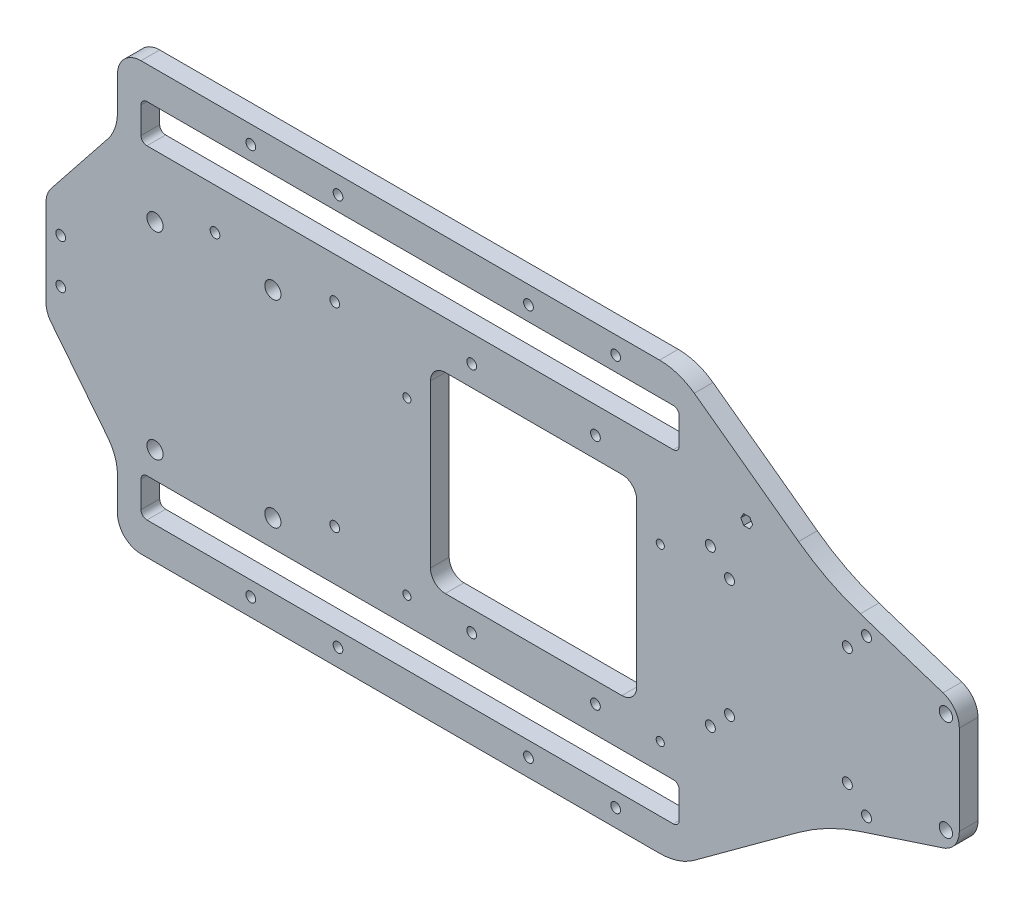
ISO-10303-21;
HEADER;
FILE_DESCRIPTION(('STEP AP214'),'2;1');
FILE_NAME('part.step','',(''),(''),'','','');
FILE_SCHEMA(('AUTOMOTIVE_DESIGN { 1 0 10303 214 1 1 1 1 }'));
ENDSEC;
DATA;
#1=APPLICATION_CONTEXT('core data for automotive mechanical design processes');
#2=APPLICATION_PROTOCOL_DEFINITION('international standard','automotive_design',2000,#1);
#3=PRODUCT_CONTEXT('',#1,'mechanical');
#4=PRODUCT('Part','Part','',(#3));
#5=PRODUCT_RELATED_PRODUCT_CATEGORY('part','',(#4));
#6=PRODUCT_DEFINITION_FORMATION('','',#4);
#7=PRODUCT_DEFINITION_CONTEXT('part definition',#1,'design');
#8=PRODUCT_DEFINITION('design','',#6,#7);
#9=PRODUCT_DEFINITION_SHAPE('','',#8);
#10=(LENGTH_UNIT() NAMED_UNIT(*) SI_UNIT(.MILLI.,.METRE.));
#11=(NAMED_UNIT(*) PLANE_ANGLE_UNIT() SI_UNIT($,.RADIAN.));
#12=(NAMED_UNIT(*) SI_UNIT($,.STERADIAN.) SOLID_ANGLE_UNIT());
#13=UNCERTAINTY_MEASURE_WITH_UNIT(LENGTH_MEASURE(1.E-05),#10,'distance_accuracy_value','');
#14=(GEOMETRIC_REPRESENTATION_CONTEXT(3) GLOBAL_UNCERTAINTY_ASSIGNED_CONTEXT((#13)) GLOBAL_UNIT_ASSIGNED_CONTEXT((#10,
#11,#12)) REPRESENTATION_CONTEXT('',''));
#15=CARTESIAN_POINT('',(0.,0.,0.));
#16=DIRECTION('',(0.,0.,1.));
#17=DIRECTION('',(1.,0.,0.));
#18=AXIS2_PLACEMENT_3D('',#15,#16,#17);
#19=CARTESIAN_POINT('',(-155.,-72.5,3.175));
#20=DIRECTION('',(1.,0.,0.));
#21=DIRECTION('',(0.,0.,-1.));
#22=AXIS2_PLACEMENT_3D('',#19,#20,#21);
#23=PLANE('',#22);
#24=DIRECTION('',(0.,-1.,0.));
#25=VECTOR('',#24,1.);
#26=CARTESIAN_POINT('',(-155.,-72.5,-3.175));
#27=LINE('',#26,#25);
#28=CARTESIAN_POINT('',(-155.,14.7072479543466,-3.175));
#29=VERTEX_POINT('',#28);
#30=CARTESIAN_POINT('',(-155.,-14.7072479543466,-3.175));
#31=VERTEX_POINT('',#30);
#32=EDGE_CURVE('E880',#29,#31,#27,.T.);
#33=ORIENTED_EDGE('',*,*,#32,.T.);
#34=DIRECTION('',(0.,0.,-1.));
#35=VECTOR('',#34,1.);
#36=CARTESIAN_POINT('',(-155.,-14.7072479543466,3.175));
#37=LINE('',#36,#35);
#38=CARTESIAN_POINT('',(-155.,-14.7072479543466,3.175));
#39=VERTEX_POINT('',#38);
#40=EDGE_CURVE('E1000',#31,#39,#37,.F.);
#41=ORIENTED_EDGE('',*,*,#40,.T.);
#42=DIRECTION('',(0.,-1.,0.));
#43=VECTOR('',#42,1.);
#44=CARTESIAN_POINT('',(-155.,-72.5,3.175));
#45=LINE('',#44,#43);
#46=CARTESIAN_POINT('',(-155.,14.7072479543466,3.175));
#47=VERTEX_POINT('',#46);
#48=EDGE_CURVE('E881',#47,#39,#45,.T.);
#49=ORIENTED_EDGE('',*,*,#48,.F.);
#50=DIRECTION('',(0.,0.,-1.));
#51=VECTOR('',#50,1.);
#52=CARTESIAN_POINT('',(-155.,14.7072479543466,3.175));
#53=LINE('',#52,#51);
#54=EDGE_CURVE('E997',#47,#29,#53,.T.);
#55=ORIENTED_EDGE('',*,*,#54,.T.);
#56=EDGE_LOOP('',(#33,#41,#49,#55));
#57=FACE_BOUND('',#56,.T.);
#58=ADVANCED_FACE('F34',(#57),#23,.F.);
#59=CARTESIAN_POINT('',(155.,-72.5,3.175));
#60=DIRECTION('',(0.,1.,0.));
#61=DIRECTION('',(-1.,0.,0.));
#62=AXIS2_PLACEMENT_3D('',#59,#60,#61);
#63=PLANE('',#62);
#64=DIRECTION('',(1.,0.,0.));
#65=VECTOR('',#64,1.);
#66=CARTESIAN_POINT('',(155.,-72.5,3.175));
#67=LINE('',#66,#65);
#68=CARTESIAN_POINT('',(-122.75,-72.5,3.175));
#69=VERTEX_POINT('',#68);
#70=CARTESIAN_POINT('',(53.2499999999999,-72.5000000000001,3.17500000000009));
#71=VERTEX_POINT('',#70);
#72=EDGE_CURVE('E884',#69,#71,#67,.T.);
#73=ORIENTED_EDGE('',*,*,#72,.F.);
#74=DIRECTION('',(0.,0.,-1.));
#75=VECTOR('',#74,1.);
#76=CARTESIAN_POINT('',(-122.75,-72.5,3.175));
#77=LINE('',#76,#75);
#78=CARTESIAN_POINT('',(-122.75,-72.5,-3.175));
#79=VERTEX_POINT('',#78);
#80=EDGE_CURVE('E989',#69,#79,#77,.T.);
#81=ORIENTED_EDGE('',*,*,#80,.T.);
#82=DIRECTION('',(1.,0.,0.));
#83=VECTOR('',#82,1.);
#84=CARTESIAN_POINT('',(155.,-72.5,-3.175));
#85=LINE('',#84,#83);
#86=CARTESIAN_POINT('',(53.2499999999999,-72.5000000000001,-3.17499999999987));
#87=VERTEX_POINT('',#86);
#88=EDGE_CURVE('E896',#79,#87,#85,.T.);
#89=ORIENTED_EDGE('',*,*,#88,.T.);
#90=DIRECTION('',(0.,0.,-1.));
#91=VECTOR('',#90,1.);
#92=CARTESIAN_POINT('',(53.2499999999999,-72.5000000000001,431.836505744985));
#93=LINE('',#92,#91);
#94=EDGE_CURVE('E838',#71,#87,#93,.T.);
#95=ORIENTED_EDGE('',*,*,#94,.F.);
#96=EDGE_LOOP('',(#73,#81,#89,#95));
#97=FACE_BOUND('',#96,.T.);
#98=ADVANCED_FACE('F1085',(#97),#63,.F.);
#99=CARTESIAN_POINT('',(155.,-72.5,3.175));
#100=DIRECTION('',(-1.,0.,0.));
#101=DIRECTION('',(0.,0.,1.));
#102=AXIS2_PLACEMENT_3D('',#99,#100,#101);
#103=PLANE('',#102);
#104=DIRECTION('',(0.,1.,0.));
#105=VECTOR('',#104,1.);
#106=CARTESIAN_POINT('',(155.,-72.5,3.175));
#107=LINE('',#106,#105);
#108=CARTESIAN_POINT('',(155.,-15.2012444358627,3.175));
#109=VERTEX_POINT('',#108);
#110=CARTESIAN_POINT('',(155.,15.2012444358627,3.175));
#111=VERTEX_POINT('',#110);
#112=EDGE_CURVE('E887',#109,#111,#107,.T.);
#113=ORIENTED_EDGE('',*,*,#112,.F.);
#114=DIRECTION('',(0.,0.,-1.));
#115=VECTOR('',#114,1.);
#116=CARTESIAN_POINT('',(155.,-15.2012444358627,3.175));
#117=LINE('',#116,#115);
#118=CARTESIAN_POINT('',(155.,-15.2012444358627,-3.175));
#119=VERTEX_POINT('',#118);
#120=EDGE_CURVE('E957',#109,#119,#117,.T.);
#121=ORIENTED_EDGE('',*,*,#120,.T.);
#122=DIRECTION('',(0.,1.,0.));
#123=VECTOR('',#122,1.);
#124=CARTESIAN_POINT('',(155.,-72.5,-3.175));
#125=LINE('',#124,#123);
#126=CARTESIAN_POINT('',(155.,15.2012444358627,-3.175));
#127=VERTEX_POINT('',#126);
#128=EDGE_CURVE('E898',#119,#127,#125,.T.);
#129=ORIENTED_EDGE('',*,*,#128,.T.);
#130=DIRECTION('',(0.,0.,-1.));
#131=VECTOR('',#130,1.);
#132=CARTESIAN_POINT('',(155.,15.2012444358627,3.175));
#133=LINE('',#132,#131);
#134=EDGE_CURVE('E955',#127,#111,#133,.F.);
#135=ORIENTED_EDGE('',*,*,#134,.T.);
#136=EDGE_LOOP('',(#113,#121,#129,#135));
#137=FACE_BOUND('',#136,.T.);
#138=ADVANCED_FACE('F1056',(#137),#103,.F.);
#139=CARTESIAN_POINT('',(155.,72.5,3.175));
#140=DIRECTION('',(0.,-1.,0.));
#141=DIRECTION('',(1.,0.,0.));
#142=AXIS2_PLACEMENT_3D('',#139,#140,#141);
#143=PLANE('',#142);
#144=DIRECTION('',(-1.,0.,0.));
#145=VECTOR('',#144,1.);
#146=CARTESIAN_POINT('',(155.,72.5,-3.175));
#147=LINE('',#146,#145);
#148=CARTESIAN_POINT('',(53.2499999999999,72.5000000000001,-3.17499999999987));
#149=VERTEX_POINT('',#148);
#150=CARTESIAN_POINT('',(-122.75,72.5,-3.175));
#151=VERTEX_POINT('',#150);
#152=EDGE_CURVE('E885',#149,#151,#147,.T.);
#153=ORIENTED_EDGE('',*,*,#152,.T.);
#154=DIRECTION('',(0.,0.,-1.));
#155=VECTOR('',#154,1.);
#156=CARTESIAN_POINT('',(-122.75,72.5,3.175));
#157=LINE('',#156,#155);
#158=CARTESIAN_POINT('',(-122.75,72.5,3.175));
#159=VERTEX_POINT('',#158);
#160=EDGE_CURVE('E11',#151,#159,#157,.F.);
#161=ORIENTED_EDGE('',*,*,#160,.T.);
#162=DIRECTION('',(-1.,0.,0.));
#163=VECTOR('',#162,1.);
#164=CARTESIAN_POINT('',(155.,72.5,3.175));
#165=LINE('',#164,#163);
#166=CARTESIAN_POINT('',(53.2499999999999,72.5000000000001,3.17500000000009));
#167=VERTEX_POINT('',#166);
#168=EDGE_CURVE('E890',#167,#159,#165,.T.);
#169=ORIENTED_EDGE('',*,*,#168,.F.);
#170=DIRECTION('',(0.,0.,-1.));
#171=VECTOR('',#170,1.);
#172=CARTESIAN_POINT('',(53.2499999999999,72.5000000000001,431.836505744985));
#173=LINE('',#172,#171);
#174=EDGE_CURVE('E841',#167,#149,#173,.T.);
#175=ORIENTED_EDGE('',*,*,#174,.T.);
#176=EDGE_LOOP('',(#153,#161,#169,#175));
#177=FACE_BOUND('',#176,.T.);
#178=ADVANCED_FACE('F1033',(#177),#143,.F.);
#179=CARTESIAN_POINT('',(0.,0.,3.175));
#180=DIRECTION('',(0.,0.,1.));
#181=DIRECTION('',(1.,0.,0.));
#182=AXIS2_PLACEMENT_3D('',#179,#180,#181);
#183=PLANE('',#182);
#184=DIRECTION('',(-0.500000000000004,-0.866025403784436,0.));
#185=VECTOR('',#184,1.);
#186=CARTESIAN_POINT('',(81.8263479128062,41.6611829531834,3.17500000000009));
#187=LINE('',#186,#185);
#188=CARTESIAN_POINT('',(81.8263479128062,41.6611829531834,3.17500000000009));
#189=VERTEX_POINT('',#188);
#190=CARTESIAN_POINT('',(80.8159849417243,39.9111829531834,3.175));
#191=VERTEX_POINT('',#190);
#192=EDGE_CURVE('E49',#189,#191,#187,.T.);
#193=ORIENTED_EDGE('',*,*,#192,.F.);
#194=DIRECTION('',(-1.,0.,0.));
#195=VECTOR('',#194,1.);
#196=CARTESIAN_POINT('',(83.8470738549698,41.6611829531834,3.17500000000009));
#197=LINE('',#196,#195);
#198=CARTESIAN_POINT('',(83.8470738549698,41.6611829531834,3.17500000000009));
#199=VERTEX_POINT('',#198);
#200=EDGE_CURVE('E401',#199,#189,#197,.T.);
#201=ORIENTED_EDGE('',*,*,#200,.F.);
#202=DIRECTION('',(-0.5,0.866025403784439,0.));
#203=VECTOR('',#202,1.);
#204=CARTESIAN_POINT('',(84.8574368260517,39.9111829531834,3.17500000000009));
#205=LINE('',#204,#203);
#206=CARTESIAN_POINT('',(84.8574368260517,39.9111829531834,3.17500000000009));
#207=VERTEX_POINT('',#206);
#208=EDGE_CURVE('E395',#207,#199,#205,.T.);
#209=ORIENTED_EDGE('',*,*,#208,.F.);
#210=DIRECTION('',(0.500000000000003,0.866025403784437,0.));
#211=VECTOR('',#210,1.);
#212=CARTESIAN_POINT('',(83.8470738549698,38.1611829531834,3.17500000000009));
#213=LINE('',#212,#211);
#214=CARTESIAN_POINT('',(83.8470738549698,38.1611829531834,3.17500000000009));
#215=VERTEX_POINT('',#214);
#216=EDGE_CURVE('E393',#215,#207,#213,.T.);
#217=ORIENTED_EDGE('',*,*,#216,.F.);
#218=DIRECTION('',(1.,0.,0.));
#219=VECTOR('',#218,1.);
#220=CARTESIAN_POINT('',(81.8263479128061,38.1611829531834,3.17500000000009));
#221=LINE('',#220,#219);
#222=CARTESIAN_POINT('',(81.8263479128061,38.1611829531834,3.17500000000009));
#223=VERTEX_POINT('',#222);
#224=EDGE_CURVE('E376',#223,#215,#221,.T.);
#225=ORIENTED_EDGE('',*,*,#224,.F.);
#226=DIRECTION('',(0.500000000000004,-0.866025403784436,0.));
#227=VECTOR('',#226,1.);
#228=CARTESIAN_POINT('',(80.8159849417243,39.9111829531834,3.17500000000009));
#229=LINE('',#228,#227);
#230=EDGE_CURVE('E385',#191,#223,#229,.T.);
#231=ORIENTED_EDGE('',*,*,#230,.F.);
#232=EDGE_LOOP('',(#193,#201,#209,#217,#225,#231));
#233=FACE_BOUND('',#232,.T.);
#234=CARTESIAN_POINT('',(-19.5000000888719,-27.4999998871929,3.17500000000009));
#235=DIRECTION('',(0.,0.,1.));
#236=DIRECTION('',(-1.,0.,0.));
#237=AXIS2_PLACEMENT_3D('',#234,#235,#236);
#238=CIRCLE('',#237,5.);
#239=CARTESIAN_POINT('',(-24.5000000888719,-27.4999998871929,3.17500000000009));
#240=VERTEX_POINT('',#239);
#241=CARTESIAN_POINT('',(-19.5000000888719,-32.4999998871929,3.175));
#242=VERTEX_POINT('',#241);
#243=EDGE_CURVE('E421',#240,#242,#238,.T.);
#244=ORIENTED_EDGE('',*,*,#243,.F.);
#245=DIRECTION('',(0.,-1.,0.));
#246=VECTOR('',#245,1.);
#247=CARTESIAN_POINT('',(-24.5000000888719,27.4999998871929,3.17500000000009));
#248=LINE('',#247,#246);
#249=CARTESIAN_POINT('',(-24.5000000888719,27.4999998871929,3.17500000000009));
#250=VERTEX_POINT('',#249);
#251=EDGE_CURVE('E447',#250,#240,#248,.T.);
#252=ORIENTED_EDGE('',*,*,#251,.F.);
#253=CARTESIAN_POINT('',(-19.5000000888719,27.4999998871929,3.17500000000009));
#254=DIRECTION('',(0.,0.,1.));
#255=DIRECTION('',(1.,0.,0.));
#256=AXIS2_PLACEMENT_3D('',#253,#254,#255);
#257=CIRCLE('',#256,5.);
#258=CARTESIAN_POINT('',(-19.5000000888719,32.4999998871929,3.17500000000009));
#259=VERTEX_POINT('',#258);
#260=EDGE_CURVE('E444',#259,#250,#257,.T.);
#261=ORIENTED_EDGE('',*,*,#260,.F.);
#262=DIRECTION('',(-1.,0.,0.));
#263=VECTOR('',#262,1.);
#264=CARTESIAN_POINT('',(40.4999999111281,32.4999998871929,3.17500000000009));
#265=LINE('',#264,#263);
#266=CARTESIAN_POINT('',(40.4999999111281,32.4999998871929,3.17500000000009));
#267=VERTEX_POINT('',#266);
#268=EDGE_CURVE('E441',#267,#259,#265,.T.);
#269=ORIENTED_EDGE('',*,*,#268,.F.);
#270=CARTESIAN_POINT('',(40.4999999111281,27.4999998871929,3.17500000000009));
#271=DIRECTION('',(0.,0.,1.));
#272=DIRECTION('',(-1.,0.,0.));
#273=AXIS2_PLACEMENT_3D('',#270,#271,#272);
#274=CIRCLE('',#273,5.);
#275=CARTESIAN_POINT('',(45.4999999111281,27.4999998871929,3.17500000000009));
#276=VERTEX_POINT('',#275);
#277=EDGE_CURVE('E438',#276,#267,#274,.T.);
#278=ORIENTED_EDGE('',*,*,#277,.F.);
#279=DIRECTION('',(0.,1.,0.));
#280=VECTOR('',#279,1.);
#281=CARTESIAN_POINT('',(45.4999999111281,27.4999998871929,3.17500000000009));
#282=LINE('',#281,#280);
#283=CARTESIAN_POINT('',(45.4999999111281,-27.4999998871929,3.17500000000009));
#284=VERTEX_POINT('',#283);
#285=EDGE_CURVE('E435',#284,#276,#282,.T.);
#286=ORIENTED_EDGE('',*,*,#285,.F.);
#287=CARTESIAN_POINT('',(40.4999999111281,-27.4999998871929,3.17500000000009));
#288=DIRECTION('',(0.,0.,1.));
#289=DIRECTION('',(-1.,0.,0.));
#290=AXIS2_PLACEMENT_3D('',#287,#288,#289);
#291=CIRCLE('',#290,5.);
#292=CARTESIAN_POINT('',(40.4999999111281,-32.4999998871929,3.17500000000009));
#293=VERTEX_POINT('',#292);
#294=EDGE_CURVE('E432',#293,#284,#291,.T.);
#295=ORIENTED_EDGE('',*,*,#294,.F.);
#296=DIRECTION('',(1.,0.,0.));
#297=VECTOR('',#296,1.);
#298=CARTESIAN_POINT('',(40.4999999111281,-32.4999998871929,3.17500000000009));
#299=LINE('',#298,#297);
#300=EDGE_CURVE('E429',#242,#293,#299,.T.);
#301=ORIENTED_EDGE('',*,*,#300,.F.);
#302=EDGE_LOOP('',(#244,#252,#261,#269,#278,#286,#295,#301));
#303=FACE_BOUND('',#302,.T.);
#304=CARTESIAN_POINT('',(-10.5000000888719,39.5,3.17500000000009));
#305=DIRECTION('',(0.,0.,1.));
#306=DIRECTION('',(1.,0.,0.));
#307=AXIS2_PLACEMENT_3D('',#304,#305,#306);
#308=CIRCLE('',#307,1.65);
#309=CARTESIAN_POINT('',(-8.85000008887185,39.5,3.17500000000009));
#310=VERTEX_POINT('',#309);
#311=EDGE_CURVE('E498',#310,#310,#308,.T.);
#312=ORIENTED_EDGE('',*,*,#311,.F.);
#313=EDGE_LOOP('',(#312));
#314=FACE_BOUND('',#313,.T.);
#315=CARTESIAN_POINT('',(31.4999999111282,-39.5,3.17500000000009));
#316=DIRECTION('',(0.,0.,1.));
#317=DIRECTION('',(1.,0.,0.));
#318=AXIS2_PLACEMENT_3D('',#315,#316,#317);
#319=CIRCLE('',#318,1.65);
#320=CARTESIAN_POINT('',(33.1499999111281,-39.5,3.17500000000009));
#321=VERTEX_POINT('',#320);
#322=EDGE_CURVE('E497',#321,#321,#319,.T.);
#323=ORIENTED_EDGE('',*,*,#322,.F.);
#324=EDGE_LOOP('',(#323));
#325=FACE_BOUND('',#324,.T.);
#326=CARTESIAN_POINT('',(-10.5000000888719,-39.5,3.17500000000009));
#327=DIRECTION('',(0.,0.,1.));
#328=DIRECTION('',(1.,0.,0.));
#329=AXIS2_PLACEMENT_3D('',#326,#327,#328);
#330=CIRCLE('',#329,1.65);
#331=CARTESIAN_POINT('',(-8.85000008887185,-39.5,3.17500000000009));
#332=VERTEX_POINT('',#331);
#333=EDGE_CURVE('E477',#332,#332,#330,.T.);
#334=ORIENTED_EDGE('',*,*,#333,.F.);
#335=EDGE_LOOP('',(#334));
#336=FACE_BOUND('',#335,.T.);
#337=CARTESIAN_POINT('',(31.4999999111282,39.5,3.17500000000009));
#338=DIRECTION('',(0.,0.,1.));
#339=DIRECTION('',(1.,0.,0.));
#340=AXIS2_PLACEMENT_3D('',#337,#338,#339);
#341=CIRCLE('',#340,1.65);
#342=CARTESIAN_POINT('',(33.1499999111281,39.5,3.17500000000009));
#343=VERTEX_POINT('',#342);
#344=EDGE_CURVE('E505',#343,#343,#341,.T.);
#345=ORIENTED_EDGE('',*,*,#344,.F.);
#346=EDGE_LOOP('',(#345));
#347=FACE_BOUND('',#346,.T.);
#348=CARTESIAN_POINT('',(-32.5000000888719,18.500000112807,3.17500000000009));
#349=DIRECTION('',(0.,0.,1.));
#350=DIRECTION('',(1.,0.,0.));
#351=AXIS2_PLACEMENT_3D('',#348,#349,#350);
#352=CIRCLE('',#351,1.375);
#353=CARTESIAN_POINT('',(-31.1250000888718,18.500000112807,3.17500000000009));
#354=VERTEX_POINT('',#353);
#355=EDGE_CURVE('E522',#354,#354,#352,.T.);
#356=ORIENTED_EDGE('',*,*,#355,.F.);
#357=EDGE_LOOP('',(#356));
#358=FACE_BOUND('',#357,.T.);
#359=CARTESIAN_POINT('',(53.4999999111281,-39.4999998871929,3.17500000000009));
#360=DIRECTION('',(0.,0.,1.));
#361=DIRECTION('',(1.,0.,0.));
#362=AXIS2_PLACEMENT_3D('',#359,#360,#361);
#363=CIRCLE('',#362,1.375);
#364=CARTESIAN_POINT('',(54.8749999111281,-39.4999998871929,3.17500000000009));
#365=VERTEX_POINT('',#364);
#366=EDGE_CURVE('E521',#365,#365,#363,.T.);
#367=ORIENTED_EDGE('',*,*,#366,.F.);
#368=EDGE_LOOP('',(#367));
#369=FACE_BOUND('',#368,.T.);
#370=CARTESIAN_POINT('',(-32.5000000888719,-39.499999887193,3.17500000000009));
#371=DIRECTION('',(0.,0.,1.));
#372=DIRECTION('',(1.,0.,0.));
#373=AXIS2_PLACEMENT_3D('',#370,#371,#372);
#374=CIRCLE('',#373,1.375);
#375=CARTESIAN_POINT('',(-31.1250000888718,-39.499999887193,3.17500000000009));
#376=VERTEX_POINT('',#375);
#377=EDGE_CURVE('E515',#376,#376,#374,.T.);
#378=ORIENTED_EDGE('',*,*,#377,.F.);
#379=EDGE_LOOP('',(#378));
#380=FACE_BOUND('',#379,.T.);
#381=CARTESIAN_POINT('',(53.4999999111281,18.500000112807,3.17500000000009));
#382=DIRECTION('',(0.,0.,1.));
#383=DIRECTION('',(1.,0.,0.));
#384=AXIS2_PLACEMENT_3D('',#381,#382,#383);
#385=CIRCLE('',#384,1.375);
#386=CARTESIAN_POINT('',(54.8749999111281,18.500000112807,3.17500000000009));
#387=VERTEX_POINT('',#386);
#388=EDGE_CURVE('E529',#387,#387,#385,.T.);
#389=ORIENTED_EDGE('',*,*,#388,.F.);
#390=EDGE_LOOP('',(#389));
#391=FACE_BOUND('',#390,.T.);
#392=CARTESIAN_POINT('',(70.4999999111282,26.5,3.175));
#393=DIRECTION('',(0.,0.,1.));
#394=DIRECTION('',(1.,0.,0.));
#395=AXIS2_PLACEMENT_3D('',#392,#393,#394);
#396=CIRCLE('',#395,1.69999999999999);
#397=CARTESIAN_POINT('',(72.1999999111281,26.5,3.175));
#398=VERTEX_POINT('',#397);
#399=EDGE_CURVE('E539',#398,#398,#396,.T.);
#400=ORIENTED_EDGE('',*,*,#399,.F.);
#401=EDGE_LOOP('',(#400));
#402=FACE_BOUND('',#401,.T.);
#403=CARTESIAN_POINT('',(76.9999999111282,20.,3.175));
#404=DIRECTION('',(0.,0.,1.));
#405=DIRECTION('',(1.,0.,0.));
#406=AXIS2_PLACEMENT_3D('',#403,#404,#405);
#407=CIRCLE('',#406,1.69999999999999);
#408=CARTESIAN_POINT('',(78.6999999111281,20.,3.175));
#409=VERTEX_POINT('',#408);
#410=EDGE_CURVE('E545',#409,#409,#407,.T.);
#411=ORIENTED_EDGE('',*,*,#410,.F.);
#412=EDGE_LOOP('',(#411));
#413=FACE_BOUND('',#412,.T.);
#414=CARTESIAN_POINT('',(70.4999999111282,-26.5,3.175));
#415=DIRECTION('',(0.,0.,1.));
#416=DIRECTION('',(1.,0.,0.));
#417=AXIS2_PLACEMENT_3D('',#414,#415,#416);
#418=CIRCLE('',#417,1.69999999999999);
#419=CARTESIAN_POINT('',(72.1999999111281,-26.5,3.175));
#420=VERTEX_POINT('',#419);
#421=EDGE_CURVE('E551',#420,#420,#418,.T.);
#422=ORIENTED_EDGE('',*,*,#421,.F.);
#423=EDGE_LOOP('',(#422));
#424=FACE_BOUND('',#423,.T.);
#425=CARTESIAN_POINT('',(76.9999999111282,-20.,3.175));
#426=DIRECTION('',(0.,0.,1.));
#427=DIRECTION('',(1.,0.,0.));
#428=AXIS2_PLACEMENT_3D('',#425,#426,#427);
#429=CIRCLE('',#428,1.69999999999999);
#430=CARTESIAN_POINT('',(78.6999999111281,-20.,3.175));
#431=VERTEX_POINT('',#430);
#432=EDGE_CURVE('E557',#431,#431,#429,.T.);
#433=ORIENTED_EDGE('',*,*,#432,.F.);
#434=EDGE_LOOP('',(#433));
#435=FACE_BOUND('',#434,.T.);
#436=CARTESIAN_POINT('',(123.499999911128,-26.5,3.175));
#437=DIRECTION('',(0.,0.,1.));
#438=DIRECTION('',(1.,0.,0.));
#439=AXIS2_PLACEMENT_3D('',#436,#437,#438);
#440=CIRCLE('',#439,1.69999999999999);
#441=CARTESIAN_POINT('',(125.199999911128,-26.5,3.175));
#442=VERTEX_POINT('',#441);
#443=EDGE_CURVE('E563',#442,#442,#440,.T.);
#444=ORIENTED_EDGE('',*,*,#443,.F.);
#445=EDGE_LOOP('',(#444));
#446=FACE_BOUND('',#445,.T.);
#447=CARTESIAN_POINT('',(116.999999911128,-20.,3.175));
#448=DIRECTION('',(0.,0.,1.));
#449=DIRECTION('',(1.,0.,0.));
#450=AXIS2_PLACEMENT_3D('',#447,#448,#449);
#451=CIRCLE('',#450,1.69999999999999);
#452=CARTESIAN_POINT('',(118.699999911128,-20.,3.175));
#453=VERTEX_POINT('',#452);
#454=EDGE_CURVE('E569',#453,#453,#451,.T.);
#455=ORIENTED_EDGE('',*,*,#454,.F.);
#456=EDGE_LOOP('',(#455));
#457=FACE_BOUND('',#456,.T.);
#458=CARTESIAN_POINT('',(116.999999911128,20.,3.175));
#459=DIRECTION('',(0.,0.,1.));
#460=DIRECTION('',(1.,0.,0.));
#461=AXIS2_PLACEMENT_3D('',#458,#459,#460);
#462=CIRCLE('',#461,1.69999999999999);
#463=CARTESIAN_POINT('',(118.699999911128,20.,3.175));
#464=VERTEX_POINT('',#463);
#465=EDGE_CURVE('E575',#464,#464,#462,.T.);
#466=ORIENTED_EDGE('',*,*,#465,.F.);
#467=EDGE_LOOP('',(#466));
#468=FACE_BOUND('',#467,.T.);
#469=CARTESIAN_POINT('',(123.499999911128,26.5,3.175));
#470=DIRECTION('',(0.,0.,1.));
#471=DIRECTION('',(1.,0.,0.));
#472=AXIS2_PLACEMENT_3D('',#469,#470,#471);
#473=CIRCLE('',#472,1.69999999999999);
#474=CARTESIAN_POINT('',(125.199999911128,26.5,3.175));
#475=VERTEX_POINT('',#474);
#476=EDGE_CURVE('E581',#475,#475,#473,.T.);
#477=ORIENTED_EDGE('',*,*,#476,.F.);
#478=EDGE_LOOP('',(#477));
#479=FACE_BOUND('',#478,.T.);
#480=CARTESIAN_POINT('',(-97.64,34.5000001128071,3.17500000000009));
#481=DIRECTION('',(0.,0.,1.));
#482=DIRECTION('',(1.,0.,0.));
#483=AXIS2_PLACEMENT_3D('',#480,#481,#482);
#484=CIRCLE('',#483,1.65);
#485=CARTESIAN_POINT('',(-95.99,34.5000001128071,3.17500000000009));
#486=VERTEX_POINT('',#485);
#487=EDGE_CURVE('E588',#486,#486,#484,.T.);
#488=ORIENTED_EDGE('',*,*,#487,.F.);
#489=EDGE_LOOP('',(#488));
#490=FACE_BOUND('',#489,.T.);
#491=CARTESIAN_POINT('',(-57.,34.5000001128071,3.17500000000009));
#492=DIRECTION('',(0.,0.,1.));
#493=DIRECTION('',(1.,0.,0.));
#494=AXIS2_PLACEMENT_3D('',#491,#492,#493);
#495=CIRCLE('',#494,1.65);
#496=CARTESIAN_POINT('',(-55.35,34.5000001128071,3.17500000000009));
#497=VERTEX_POINT('',#496);
#498=EDGE_CURVE('E596',#497,#497,#495,.T.);
#499=ORIENTED_EDGE('',*,*,#498,.F.);
#500=EDGE_LOOP('',(#499));
#501=FACE_BOUND('',#500,.T.);
#502=CARTESIAN_POINT('',(-57.,-31.5399998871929,3.17500000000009));
#503=DIRECTION('',(0.,0.,1.));
#504=DIRECTION('',(1.,0.,0.));
#505=AXIS2_PLACEMENT_3D('',#502,#503,#504);
#506=CIRCLE('',#505,1.65);
#507=CARTESIAN_POINT('',(-55.35,-31.5399998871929,3.17500000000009));
#508=VERTEX_POINT('',#507);
#509=EDGE_CURVE('E587',#508,#508,#506,.T.);
#510=ORIENTED_EDGE('',*,*,#509,.F.);
#511=EDGE_LOOP('',(#510));
#512=FACE_BOUND('',#511,.T.);
#513=CARTESIAN_POINT('',(-118.,27.5000001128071,3.175));
#514=DIRECTION('',(0.,0.,1.));
#515=DIRECTION('',(1.,0.,0.));
#516=AXIS2_PLACEMENT_3D('',#513,#514,#515);
#517=CIRCLE('',#516,2.75);
#518=CARTESIAN_POINT('',(-115.25,27.5000001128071,3.175));
#519=VERTEX_POINT('',#518);
#520=EDGE_CURVE('E595',#519,#519,#517,.T.);
#521=ORIENTED_EDGE('',*,*,#520,.F.);
#522=EDGE_LOOP('',(#521));
#523=FACE_BOUND('',#522,.T.);
#524=CARTESIAN_POINT('',(-78.,27.5000001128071,3.175));
#525=DIRECTION('',(0.,0.,1.));
#526=DIRECTION('',(1.,0.,0.));
#527=AXIS2_PLACEMENT_3D('',#524,#525,#526);
#528=CIRCLE('',#527,2.75);
#529=CARTESIAN_POINT('',(-75.25,27.5000001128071,3.175));
#530=VERTEX_POINT('',#529);
#531=EDGE_CURVE('E611',#530,#530,#528,.T.);
#532=ORIENTED_EDGE('',*,*,#531,.F.);
#533=EDGE_LOOP('',(#532));
#534=FACE_BOUND('',#533,.T.);
#535=CARTESIAN_POINT('',(-78.,-39.4999998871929,3.175));
#536=DIRECTION('',(0.,0.,1.));
#537=DIRECTION('',(1.,0.,0.));
#538=AXIS2_PLACEMENT_3D('',#535,#536,#537);
#539=CIRCLE('',#538,2.75);
#540=CARTESIAN_POINT('',(-75.25,-39.4999998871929,3.175));
#541=VERTEX_POINT('',#540);
#542=EDGE_CURVE('E617',#541,#541,#539,.T.);
#543=ORIENTED_EDGE('',*,*,#542,.F.);
#544=EDGE_LOOP('',(#543));
#545=FACE_BOUND('',#544,.T.);
#546=CARTESIAN_POINT('',(-118.,-39.4999998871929,3.175));
#547=DIRECTION('',(0.,0.,1.));
#548=DIRECTION('',(1.,0.,0.));
#549=AXIS2_PLACEMENT_3D('',#546,#547,#548);
#550=CIRCLE('',#549,2.75);
#551=CARTESIAN_POINT('',(-115.25,-39.4999998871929,3.175));
#552=VERTEX_POINT('',#551);
#553=EDGE_CURVE('E623',#552,#552,#550,.T.);
#554=ORIENTED_EDGE('',*,*,#553,.F.);
#555=EDGE_LOOP('',(#554));
#556=FACE_BOUND('',#555,.T.);
#557=CARTESIAN_POINT('',(-150.,7.49999999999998,3.17500000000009));
#558=DIRECTION('',(0.,0.,1.));
#559=DIRECTION('',(1.,0.,0.));
#560=AXIS2_PLACEMENT_3D('',#557,#558,#559);
#561=CIRCLE('',#560,1.65000000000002);
#562=CARTESIAN_POINT('',(-148.35,7.49999999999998,3.17500000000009));
#563=VERTEX_POINT('',#562);
#564=EDGE_CURVE('E630',#563,#563,#561,.T.);
#565=ORIENTED_EDGE('',*,*,#564,.F.);
#566=EDGE_LOOP('',(#565));
#567=FACE_BOUND('',#566,.T.);
#568=CARTESIAN_POINT('',(-150.,-7.50000000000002,3.17500000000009));
#569=DIRECTION('',(0.,0.,1.));
#570=DIRECTION('',(-1.,0.,0.));
#571=AXIS2_PLACEMENT_3D('',#568,#569,#570);
#572=CIRCLE('',#571,1.65000000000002);
#573=CARTESIAN_POINT('',(-151.65,-7.50000000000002,3.17500000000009));
#574=VERTEX_POINT('',#573);
#575=EDGE_CURVE('E629',#574,#574,#572,.T.);
#576=ORIENTED_EDGE('',*,*,#575,.F.);
#577=EDGE_LOOP('',(#576));
#578=FACE_BOUND('',#577,.T.);
#579=CARTESIAN_POINT('',(57.9390074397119,50.4999998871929,3.17500000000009));
#580=DIRECTION('',(0.,0.,1.));
#581=DIRECTION('',(1.,0.,0.));
#582=AXIS2_PLACEMENT_3D('',#579,#580,#581);
#583=CIRCLE('',#582,2.);
#584=CARTESIAN_POINT('',(57.9390074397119,48.4999998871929,3.17500000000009));
#585=VERTEX_POINT('',#584);
#586=CARTESIAN_POINT('',(59.9390074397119,50.499999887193,3.175));
#587=VERTEX_POINT('',#586);
#588=EDGE_CURVE('E642',#585,#587,#583,.T.);
#589=ORIENTED_EDGE('',*,*,#588,.F.);
#590=DIRECTION('',(1.,0.,0.));
#591=VECTOR('',#590,1.);
#592=CARTESIAN_POINT('',(57.9390074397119,48.4999998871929,3.17500000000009));
#593=LINE('',#592,#591);
#594=CARTESIAN_POINT('',(-120.750000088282,48.4999998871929,3.17500000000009));
#595=VERTEX_POINT('',#594);
#596=EDGE_CURVE('E663',#595,#585,#593,.T.);
#597=ORIENTED_EDGE('',*,*,#596,.F.);
#598=CARTESIAN_POINT('',(-120.750000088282,50.4999998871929,3.17500000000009));
#599=DIRECTION('',(0.,0.,1.));
#600=DIRECTION('',(-1.,0.,0.));
#601=AXIS2_PLACEMENT_3D('',#598,#599,#600);
#602=CIRCLE('',#601,2.);
#603=CARTESIAN_POINT('',(-122.750000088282,50.4999998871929,3.17500000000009));
#604=VERTEX_POINT('',#603);
#605=EDGE_CURVE('E660',#604,#595,#602,.T.);
#606=ORIENTED_EDGE('',*,*,#605,.F.);
#607=DIRECTION('',(0.,-1.,0.));
#608=VECTOR('',#607,1.);
#609=CARTESIAN_POINT('',(-122.750000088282,50.4999998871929,3.17500000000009));
#610=LINE('',#609,#608);
#611=CARTESIAN_POINT('',(-122.750000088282,59.4999998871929,3.17500000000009));
#612=VERTEX_POINT('',#611);
#613=EDGE_CURVE('E657',#612,#604,#610,.T.);
#614=ORIENTED_EDGE('',*,*,#613,.F.);
#615=CARTESIAN_POINT('',(-120.750000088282,59.4999998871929,3.17500000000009));
#616=DIRECTION('',(0.,0.,1.));
#617=DIRECTION('',(1.,0.,0.));
#618=AXIS2_PLACEMENT_3D('',#615,#616,#617);
#619=CIRCLE('',#618,2.);
#620=CARTESIAN_POINT('',(-120.750000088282,61.4999998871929,3.17500000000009));
#621=VERTEX_POINT('',#620);
#622=EDGE_CURVE('E654',#621,#612,#619,.T.);
#623=ORIENTED_EDGE('',*,*,#622,.F.);
#624=DIRECTION('',(-1.,0.,0.));
#625=VECTOR('',#624,1.);
#626=CARTESIAN_POINT('',(57.9390074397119,61.4999998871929,3.17500000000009));
#627=LINE('',#626,#625);
#628=CARTESIAN_POINT('',(57.9390074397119,61.4999998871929,3.17500000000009));
#629=VERTEX_POINT('',#628);
#630=EDGE_CURVE('E651',#629,#621,#627,.T.);
#631=ORIENTED_EDGE('',*,*,#630,.F.);
#632=CARTESIAN_POINT('',(57.9390074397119,59.4999998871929,3.17500000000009));
#633=DIRECTION('',(0.,0.,1.));
#634=DIRECTION('',(1.,0.,0.));
#635=AXIS2_PLACEMENT_3D('',#632,#633,#634);
#636=CIRCLE('',#635,2.);
#637=CARTESIAN_POINT('',(59.9390074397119,59.4999998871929,3.17500000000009));
#638=VERTEX_POINT('',#637);
#639=EDGE_CURVE('E648',#638,#629,#636,.T.);
#640=ORIENTED_EDGE('',*,*,#639,.F.);
#641=DIRECTION('',(0.,1.,0.));
#642=VECTOR('',#641,1.);
#643=CARTESIAN_POINT('',(59.9390074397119,50.499999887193,3.17500000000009));
#644=LINE('',#643,#642);
#645=EDGE_CURVE('E644',#587,#638,#644,.T.);
#646=ORIENTED_EDGE('',*,*,#645,.F.);
#647=EDGE_LOOP('',(#589,#597,#606,#614,#623,#631,#640,#646));
#648=FACE_BOUND('',#647,.T.);
#649=CARTESIAN_POINT('',(-120.750000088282,-59.4999998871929,3.17500000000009));
#650=DIRECTION('',(0.,0.,1.));
#651=DIRECTION('',(-1.,0.,0.));
#652=AXIS2_PLACEMENT_3D('',#649,#650,#651);
#653=CIRCLE('',#652,2.);
#654=CARTESIAN_POINT('',(-122.750000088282,-59.4999998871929,3.17500000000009));
#655=VERTEX_POINT('',#654);
#656=CARTESIAN_POINT('',(-120.750000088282,-61.4999998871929,3.175));
#657=VERTEX_POINT('',#656);
#658=EDGE_CURVE('E637',#655,#657,#653,.T.);
#659=ORIENTED_EDGE('',*,*,#658,.F.);
#660=DIRECTION('',(0.,-1.,0.));
#661=VECTOR('',#660,1.);
#662=CARTESIAN_POINT('',(-122.750000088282,-50.4999998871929,3.17500000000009));
#663=LINE('',#662,#661);
#664=CARTESIAN_POINT('',(-122.750000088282,-50.4999998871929,3.17500000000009));
#665=VERTEX_POINT('',#664);
#666=EDGE_CURVE('E727',#665,#655,#663,.T.);
#667=ORIENTED_EDGE('',*,*,#666,.F.);
#668=CARTESIAN_POINT('',(-120.750000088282,-50.4999998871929,3.17500000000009));
#669=DIRECTION('',(0.,0.,1.));
#670=DIRECTION('',(1.,0.,0.));
#671=AXIS2_PLACEMENT_3D('',#668,#669,#670);
#672=CIRCLE('',#671,2.);
#673=CARTESIAN_POINT('',(-120.750000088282,-48.4999998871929,3.17500000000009));
#674=VERTEX_POINT('',#673);
#675=EDGE_CURVE('E724',#674,#665,#672,.T.);
#676=ORIENTED_EDGE('',*,*,#675,.F.);
#677=DIRECTION('',(-1.,0.,0.));
#678=VECTOR('',#677,1.);
#679=CARTESIAN_POINT('',(57.9390074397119,-48.4999998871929,3.17500000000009));
#680=LINE('',#679,#678);
#681=CARTESIAN_POINT('',(57.9390074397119,-48.4999998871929,3.17500000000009));
#682=VERTEX_POINT('',#681);
#683=EDGE_CURVE('E721',#682,#674,#680,.T.);
#684=ORIENTED_EDGE('',*,*,#683,.F.);
#685=CARTESIAN_POINT('',(57.9390074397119,-50.4999998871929,3.17500000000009));
#686=DIRECTION('',(0.,0.,1.));
#687=DIRECTION('',(-1.,0.,0.));
#688=AXIS2_PLACEMENT_3D('',#685,#686,#687);
#689=CIRCLE('',#688,2.);
#690=CARTESIAN_POINT('',(59.9390074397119,-50.499999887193,3.17500000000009));
#691=VERTEX_POINT('',#690);
#692=EDGE_CURVE('E718',#691,#682,#689,.T.);
#693=ORIENTED_EDGE('',*,*,#692,.F.);
#694=DIRECTION('',(0.,1.,0.));
#695=VECTOR('',#694,1.);
#696=CARTESIAN_POINT('',(59.9390074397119,-50.499999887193,3.17500000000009));
#697=LINE('',#696,#695);
#698=CARTESIAN_POINT('',(59.9390074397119,-59.4999998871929,3.17500000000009));
#699=VERTEX_POINT('',#698);
#700=EDGE_CURVE('E715',#699,#691,#697,.T.);
#701=ORIENTED_EDGE('',*,*,#700,.F.);
#702=CARTESIAN_POINT('',(57.9390074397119,-59.4999998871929,3.17500000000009));
#703=DIRECTION('',(0.,0.,1.));
#704=DIRECTION('',(-1.,0.,0.));
#705=AXIS2_PLACEMENT_3D('',#702,#703,#704);
#706=CIRCLE('',#705,2.);
#707=CARTESIAN_POINT('',(57.9390074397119,-61.4999998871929,3.17500000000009));
#708=VERTEX_POINT('',#707);
#709=EDGE_CURVE('E712',#708,#699,#706,.T.);
#710=ORIENTED_EDGE('',*,*,#709,.F.);
#711=DIRECTION('',(1.,0.,0.));
#712=VECTOR('',#711,1.);
#713=CARTESIAN_POINT('',(57.9390074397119,-61.4999998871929,3.17500000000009));
#714=LINE('',#713,#712);
#715=EDGE_CURVE('E709',#657,#708,#714,.T.);
#716=ORIENTED_EDGE('',*,*,#715,.F.);
#717=EDGE_LOOP('',(#659,#667,#676,#684,#693,#701,#710,#716));
#718=FACE_BOUND('',#717,.T.);
#719=CARTESIAN_POINT('',(-85.4842792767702,-66.5,3.17500000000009));
#720=DIRECTION('',(0.,0.,1.));
#721=DIRECTION('',(1.,0.,0.));
#722=AXIS2_PLACEMENT_3D('',#719,#720,#721);
#723=CIRCLE('',#722,1.65);
#724=CARTESIAN_POINT('',(-83.8342792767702,-66.5,3.17500000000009));
#725=VERTEX_POINT('',#724);
#726=EDGE_CURVE('E788',#725,#725,#723,.T.);
#727=ORIENTED_EDGE('',*,*,#726,.F.);
#728=EDGE_LOOP('',(#727));
#729=FACE_BOUND('',#728,.T.);
#730=CARTESIAN_POINT('',(38.3657207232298,66.5,3.17500000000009));
#731=DIRECTION('',(0.,0.,1.));
#732=DIRECTION('',(1.,0.,0.));
#733=AXIS2_PLACEMENT_3D('',#730,#731,#732);
#734=CIRCLE('',#733,1.65);
#735=CARTESIAN_POINT('',(40.0157207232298,66.5,3.17500000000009));
#736=VERTEX_POINT('',#735);
#737=EDGE_CURVE('E783',#736,#736,#734,.T.);
#738=ORIENTED_EDGE('',*,*,#737,.F.);
#739=EDGE_LOOP('',(#738));
#740=FACE_BOUND('',#739,.T.);
#741=CARTESIAN_POINT('',(8.76572072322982,66.5,3.17500000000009));
#742=DIRECTION('',(0.,0.,1.));
#743=DIRECTION('',(1.,0.,0.));
#744=AXIS2_PLACEMENT_3D('',#741,#742,#743);
#745=CIRCLE('',#744,1.65);
#746=CARTESIAN_POINT('',(10.4157207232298,66.5,3.17500000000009));
#747=VERTEX_POINT('',#746);
#748=EDGE_CURVE('E776',#747,#747,#745,.T.);
#749=ORIENTED_EDGE('',*,*,#748,.F.);
#750=EDGE_LOOP('',(#749));
#751=FACE_BOUND('',#750,.T.);
#752=CARTESIAN_POINT('',(-55.8842792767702,66.5,3.17500000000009));
#753=DIRECTION('',(0.,0.,1.));
#754=DIRECTION('',(1.,0.,0.));
#755=AXIS2_PLACEMENT_3D('',#752,#753,#754);
#756=CIRCLE('',#755,1.65);
#757=CARTESIAN_POINT('',(-54.2342792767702,66.5,3.17500000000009));
#758=VERTEX_POINT('',#757);
#759=EDGE_CURVE('E775',#758,#758,#756,.T.);
#760=ORIENTED_EDGE('',*,*,#759,.F.);
#761=EDGE_LOOP('',(#760));
#762=FACE_BOUND('',#761,.T.);
#763=CARTESIAN_POINT('',(-55.8842792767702,-66.5,3.17500000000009));
#764=DIRECTION('',(0.,0.,1.));
#765=DIRECTION('',(1.,0.,0.));
#766=AXIS2_PLACEMENT_3D('',#763,#764,#765);
#767=CIRCLE('',#766,1.65);
#768=CARTESIAN_POINT('',(-54.2342792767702,-66.5,3.17500000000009));
#769=VERTEX_POINT('',#768);
#770=EDGE_CURVE('E795',#769,#769,#767,.T.);
#771=ORIENTED_EDGE('',*,*,#770,.F.);
#772=EDGE_LOOP('',(#771));
#773=FACE_BOUND('',#772,.T.);
#774=CARTESIAN_POINT('',(8.76572072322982,-66.5,3.17500000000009));
#775=DIRECTION('',(0.,0.,1.));
#776=DIRECTION('',(1.,0.,0.));
#777=AXIS2_PLACEMENT_3D('',#774,#775,#776);
#778=CIRCLE('',#777,1.65);
#779=CARTESIAN_POINT('',(10.4157207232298,-66.5,3.17500000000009));
#780=VERTEX_POINT('',#779);
#781=EDGE_CURVE('E814',#780,#780,#778,.T.);
#782=ORIENTED_EDGE('',*,*,#781,.F.);
#783=EDGE_LOOP('',(#782));
#784=FACE_BOUND('',#783,.T.);
#785=CARTESIAN_POINT('',(38.3657207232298,-66.5,3.17500000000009));
#786=DIRECTION('',(0.,0.,1.));
#787=DIRECTION('',(1.,0.,0.));
#788=AXIS2_PLACEMENT_3D('',#785,#786,#787);
#789=CIRCLE('',#788,1.65);
#790=CARTESIAN_POINT('',(40.0157207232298,-66.5,3.17500000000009));
#791=VERTEX_POINT('',#790);
#792=EDGE_CURVE('E808',#791,#791,#789,.T.);
#793=ORIENTED_EDGE('',*,*,#792,.F.);
#794=EDGE_LOOP('',(#793));
#795=FACE_BOUND('',#794,.T.);
#796=CARTESIAN_POINT('',(150.445978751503,17.05,3.17500000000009));
#797=DIRECTION('',(0.,0.,1.));
#798=DIRECTION('',(1.,0.,0.));
#799=AXIS2_PLACEMENT_3D('',#796,#797,#798);
#800=CIRCLE('',#799,2.25000000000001);
#801=CARTESIAN_POINT('',(152.695978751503,17.05,3.17500000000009));
#802=VERTEX_POINT('',#801);
#803=EDGE_CURVE('E800',#802,#802,#800,.T.);
#804=ORIENTED_EDGE('',*,*,#803,.F.);
#805=EDGE_LOOP('',(#804));
#806=FACE_BOUND('',#805,.T.);
#807=CARTESIAN_POINT('',(-85.4842792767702,66.5,3.17500000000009));
#808=DIRECTION('',(0.,0.,1.));
#809=DIRECTION('',(1.,0.,0.));
#810=AXIS2_PLACEMENT_3D('',#807,#808,#809);
#811=CIRCLE('',#810,1.65);
#812=CARTESIAN_POINT('',(-83.8342792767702,66.5,3.17500000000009));
#813=VERTEX_POINT('',#812);
#814=EDGE_CURVE('E693',#813,#813,#811,.T.);
#815=ORIENTED_EDGE('',*,*,#814,.F.);
#816=EDGE_LOOP('',(#815));
#817=FACE_BOUND('',#816,.T.);
#818=CARTESIAN_POINT('',(150.445978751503,-17.05,3.17500000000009));
#819=DIRECTION('',(0.,0.,1.));
#820=DIRECTION('',(1.,0.,0.));
#821=AXIS2_PLACEMENT_3D('',#818,#819,#820);
#822=CIRCLE('',#821,2.25000000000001);
#823=CARTESIAN_POINT('',(152.695978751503,-17.05,3.17500000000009));
#824=VERTEX_POINT('',#823);
#825=EDGE_CURVE('E807',#824,#824,#822,.T.);
#826=ORIENTED_EDGE('',*,*,#825,.F.);
#827=EDGE_LOOP('',(#826));
#828=FACE_BOUND('',#827,.T.);
#829=DIRECTION('',(-0.950366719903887,-0.311131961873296,0.));
#830=VECTOR('',#829,1.);
#831=CARTESIAN_POINT('',(21.2139588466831,-64.7990015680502,3.175));
#832=LINE('',#831,#830);
#833=CARTESIAN_POINT('',(149.489055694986,-22.8041781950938,3.175));
#834=VERTEX_POINT('',#833);
#835=CARTESIAN_POINT('',(121.4,-32.,3.17500000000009));
#836=VERTEX_POINT('',#835);
#837=EDGE_CURVE('E852',#834,#836,#832,.T.);
#838=ORIENTED_EDGE('',*,*,#837,.F.);
#839=CARTESIAN_POINT('',(147.,-15.2012444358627,3.175));
#840=DIRECTION('',(0.,0.,1.));
#841=DIRECTION('',(1.,0.,0.));
#842=AXIS2_PLACEMENT_3D('',#839,#840,#841);
#843=CIRCLE('',#842,8.);
#844=EDGE_CURVE('E984',#834,#109,#843,.T.);
#845=ORIENTED_EDGE('',*,*,#844,.T.);
#846=ORIENTED_EDGE('',*,*,#112,.T.);
#847=CARTESIAN_POINT('',(147.,15.2012444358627,3.17499999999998));
#848=DIRECTION('',(0.,0.,1.));
#849=DIRECTION('',(1.,0.,0.));
#850=AXIS2_PLACEMENT_3D('',#847,#848,#849);
#851=CIRCLE('',#850,8.);
#852=CARTESIAN_POINT('',(149.489055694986,22.8041781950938,3.175));
#853=VERTEX_POINT('',#852);
#854=EDGE_CURVE('E982',#111,#853,#851,.T.);
#855=ORIENTED_EDGE('',*,*,#854,.T.);
#856=DIRECTION('',(0.950366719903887,-0.311131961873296,0.));
#857=VECTOR('',#856,1.);
#858=CARTESIAN_POINT('',(21.2139588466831,64.7990015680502,3.175));
#859=LINE('',#858,#857);
#860=CARTESIAN_POINT('',(121.4,32.,3.17500000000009));
#861=VERTEX_POINT('',#860);
#862=EDGE_CURVE('E877',#861,#853,#859,.T.);
#863=ORIENTED_EDGE('',*,*,#862,.F.);
#864=CARTESIAN_POINT('',(144.734897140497,103.277503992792,3.17499999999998));
#865=DIRECTION('',(0.,0.,1.));
#866=DIRECTION('',(1.,0.,0.));
#867=AXIS2_PLACEMENT_3D('',#864,#865,#866);
#868=CIRCLE('',#867,75.);
#869=CARTESIAN_POINT('',(100.449037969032,42.748480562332,3.17500000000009));
#870=VERTEX_POINT('',#869);
#871=EDGE_CURVE('E875',#870,#861,#868,.T.);
#872=ORIENTED_EDGE('',*,*,#871,.F.);
#873=DIRECTION('',(0.807053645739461,-0.590478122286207,0.));
#874=VECTOR('',#873,1.);
#875=CARTESIAN_POINT('',(55.3946873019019,75.7123467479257,3.175));
#876=LINE('',#875,#874);
#877=CARTESIAN_POINT('',(65.0595624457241,68.6410729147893,3.17500000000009));
#878=VERTEX_POINT('',#877);
#879=EDGE_CURVE('E873',#878,#870,#876,.T.);
#880=ORIENTED_EDGE('',*,*,#879,.F.);
#881=CARTESIAN_POINT('',(53.2499999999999,52.5000000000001,3.17499999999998));
#882=DIRECTION('',(0.,0.,1.));
#883=DIRECTION('',(1.,0.,0.));
#884=AXIS2_PLACEMENT_3D('',#881,#882,#883);
#885=CIRCLE('',#884,20.);
#886=EDGE_CURVE('E871',#167,#878,#885,.F.);
#887=ORIENTED_EDGE('',*,*,#886,.F.);
#888=ORIENTED_EDGE('',*,*,#168,.T.);
#889=CARTESIAN_POINT('',(-122.75,64.5,3.17499999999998));
#890=DIRECTION('',(0.,0.,1.));
#891=DIRECTION('',(1.,0.,0.));
#892=AXIS2_PLACEMENT_3D('',#889,#890,#891);
#893=CIRCLE('',#892,8.);
#894=CARTESIAN_POINT('',(-130.75,64.5,3.175));
#895=VERTEX_POINT('',#894);
#896=EDGE_CURVE('E974',#159,#895,#893,.T.);
#897=ORIENTED_EDGE('',*,*,#896,.T.);
#898=DIRECTION('',(0.,1.,0.));
#899=VECTOR('',#898,1.);
#900=CARTESIAN_POINT('',(-130.75,0.,3.175));
#901=LINE('',#900,#899);
#902=CARTESIAN_POINT('',(-130.75,53.2364100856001,3.175));
#903=VERTEX_POINT('',#902);
#904=EDGE_CURVE('E868',#903,#895,#901,.T.);
#905=ORIENTED_EDGE('',*,*,#904,.F.);
#906=CARTESIAN_POINT('',(-145.75,53.2364100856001,3.17499999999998));
#907=DIRECTION('',(0.,0.,1.));
#908=DIRECTION('',(1.,0.,0.));
#909=AXIS2_PLACEMENT_3D('',#906,#907,#908);
#910=CIRCLE('',#909,15.);
#911=CARTESIAN_POINT('',(-134.008853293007,43.9012360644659,3.175));
#912=VERTEX_POINT('',#911);
#913=EDGE_CURVE('E947',#903,#912,#910,.F.);
#914=ORIENTED_EDGE('',*,*,#913,.T.);
#915=DIRECTION('',(0.622344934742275,0.782743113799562,0.));
#916=VECTOR('',#915,1.);
#917=CARTESIAN_POINT('',(-103.491334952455,82.2840941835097,3.175));
#918=LINE('',#917,#916);
#919=CARTESIAN_POINT('',(-153.261944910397,19.6860074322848,3.175));
#920=VERTEX_POINT('',#919);
#921=EDGE_CURVE('E866',#920,#912,#918,.T.);
#922=ORIENTED_EDGE('',*,*,#921,.F.);
#923=CARTESIAN_POINT('',(-147.,14.7072479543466,3.175));
#924=DIRECTION('',(0.,0.,1.));
#925=DIRECTION('',(1.,0.,0.));
#926=AXIS2_PLACEMENT_3D('',#923,#924,#925);
#927=CIRCLE('',#926,8.);
#928=EDGE_CURVE('E976',#920,#47,#927,.T.);
#929=ORIENTED_EDGE('',*,*,#928,.T.);
#930=ORIENTED_EDGE('',*,*,#48,.T.);
#931=CARTESIAN_POINT('',(-147.,-14.7072479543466,3.17499999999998));
#932=DIRECTION('',(0.,0.,1.));
#933=DIRECTION('',(1.,0.,0.));
#934=AXIS2_PLACEMENT_3D('',#931,#932,#933);
#935=CIRCLE('',#934,8.);
#936=CARTESIAN_POINT('',(-153.261944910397,-19.6860074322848,3.175));
#937=VERTEX_POINT('',#936);
#938=EDGE_CURVE('E978',#39,#937,#935,.T.);
#939=ORIENTED_EDGE('',*,*,#938,.T.);
#940=DIRECTION('',(-0.622344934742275,0.782743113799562,0.));
#941=VECTOR('',#940,1.);
#942=CARTESIAN_POINT('',(-103.491334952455,-82.2840941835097,3.175));
#943=LINE('',#942,#941);
#944=CARTESIAN_POINT('',(-134.008853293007,-43.9012360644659,3.175));
#945=VERTEX_POINT('',#944);
#946=EDGE_CURVE('E863',#945,#937,#943,.T.);
#947=ORIENTED_EDGE('',*,*,#946,.F.);
#948=CARTESIAN_POINT('',(-145.75,-53.2364100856,3.17499999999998));
#949=DIRECTION('',(0.,0.,1.));
#950=DIRECTION('',(1.,0.,0.));
#951=AXIS2_PLACEMENT_3D('',#948,#949,#950);
#952=CIRCLE('',#951,15.);
#953=CARTESIAN_POINT('',(-130.75,-53.2364100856,3.175));
#954=VERTEX_POINT('',#953);
#955=EDGE_CURVE('E952',#945,#954,#952,.F.);
#956=ORIENTED_EDGE('',*,*,#955,.T.);
#957=DIRECTION('',(0.,1.,0.));
#958=VECTOR('',#957,1.);
#959=CARTESIAN_POINT('',(-130.75,0.,3.175));
#960=LINE('',#959,#958);
#961=CARTESIAN_POINT('',(-130.75,-64.5,3.175));
#962=VERTEX_POINT('',#961);
#963=EDGE_CURVE('E861',#962,#954,#960,.T.);
#964=ORIENTED_EDGE('',*,*,#963,.F.);
#965=CARTESIAN_POINT('',(-122.75,-64.5,3.175));
#966=DIRECTION('',(0.,0.,1.));
#967=DIRECTION('',(1.,0.,0.));
#968=AXIS2_PLACEMENT_3D('',#965,#966,#967);
#969=CIRCLE('',#968,8.);
#970=EDGE_CURVE('E980',#962,#69,#969,.T.);
#971=ORIENTED_EDGE('',*,*,#970,.T.);
#972=ORIENTED_EDGE('',*,*,#72,.T.);
#973=CARTESIAN_POINT('',(53.2499999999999,-52.5000000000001,3.17499999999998));
#974=DIRECTION('',(0.,0.,1.));
#975=DIRECTION('',(1.,0.,0.));
#976=AXIS2_PLACEMENT_3D('',#973,#974,#975);
#977=CIRCLE('',#976,20.);
#978=CARTESIAN_POINT('',(65.0595624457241,-68.6410729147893,3.17500000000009));
#979=VERTEX_POINT('',#978);
#980=EDGE_CURVE('E858',#979,#71,#977,.F.);
#981=ORIENTED_EDGE('',*,*,#980,.F.);
#982=DIRECTION('',(-0.807053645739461,-0.590478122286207,0.));
#983=VECTOR('',#982,1.);
#984=CARTESIAN_POINT('',(55.3946873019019,-75.7123467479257,3.175));
#985=LINE('',#984,#983);
#986=CARTESIAN_POINT('',(100.449037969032,-42.748480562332,3.17500000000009));
#987=VERTEX_POINT('',#986);
#988=EDGE_CURVE('E856',#987,#979,#985,.T.);
#989=ORIENTED_EDGE('',*,*,#988,.F.);
#990=CARTESIAN_POINT('',(144.734897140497,-103.277503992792,3.17499999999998));
#991=DIRECTION('',(0.,0.,1.));
#992=DIRECTION('',(1.,0.,0.));
#993=AXIS2_PLACEMENT_3D('',#990,#991,#992);
#994=CIRCLE('',#993,75.);
#995=EDGE_CURVE('E854',#836,#987,#994,.T.);
#996=ORIENTED_EDGE('',*,*,#995,.F.);
#997=EDGE_LOOP('',(#838,#845,#846,#855,#863,#872,#880,#887,#888,#897,#905,#914,#922,#929,#930,
#939,#947,#956,#964,#971,#972,#981,#989,#996));
#998=FACE_BOUND('',#997,.T.);
#999=ADVANCED_FACE('F389',(#233,#303,#314,#325,#336,#347,#358,#369,#380,#391,#402,#413,#424,
#435,#446,#457,#468,#479,#490,#501,#512,#523,#534,#545,#556,#567,#578,#648,#718,#729,#740,#751,
#762,#773,#784,#795,#806,#817,#828,#998),#183,.T.);
#1000=CARTESIAN_POINT('',(0.,0.,-3.175));
#1001=DIRECTION('',(0.,0.,1.));
#1002=DIRECTION('',(1.,0.,0.));
#1003=AXIS2_PLACEMENT_3D('',#1000,#1001,#1002);
#1004=PLANE('',#1003);
#1005=DIRECTION('',(-1.,0.,0.));
#1006=VECTOR('',#1005,1.);
#1007=CARTESIAN_POINT('',(83.8470738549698,41.6611829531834,-3.175));
#1008=LINE('',#1007,#1006);
#1009=CARTESIAN_POINT('',(83.8470738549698,41.6611829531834,-3.175));
#1010=VERTEX_POINT('',#1009);
#1011=CARTESIAN_POINT('',(81.8263479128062,41.6611829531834,-3.175));
#1012=VERTEX_POINT('',#1011);
#1013=EDGE_CURVE('E416',#1010,#1012,#1008,.T.);
#1014=ORIENTED_EDGE('',*,*,#1013,.T.);
#1015=DIRECTION('',(-0.500000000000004,-0.866025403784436,0.));
#1016=VECTOR('',#1015,1.);
#1017=CARTESIAN_POINT('',(81.8263479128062,41.6611829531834,-3.175));
#1018=LINE('',#1017,#1016);
#1019=CARTESIAN_POINT('',(80.8159849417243,39.9111829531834,-3.175));
#1020=VERTEX_POINT('',#1019);
#1021=EDGE_CURVE('E404',#1012,#1020,#1018,.T.);
#1022=ORIENTED_EDGE('',*,*,#1021,.T.);
#1023=DIRECTION('',(0.500000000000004,-0.866025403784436,0.));
#1024=VECTOR('',#1023,1.);
#1025=CARTESIAN_POINT('',(80.8159849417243,39.9111829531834,-3.175));
#1026=LINE('',#1025,#1024);
#1027=CARTESIAN_POINT('',(81.8263479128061,38.1611829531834,-3.175));
#1028=VERTEX_POINT('',#1027);
#1029=EDGE_CURVE('E407',#1020,#1028,#1026,.T.);
#1030=ORIENTED_EDGE('',*,*,#1029,.T.);
#1031=DIRECTION('',(1.,0.,0.));
#1032=VECTOR('',#1031,1.);
#1033=CARTESIAN_POINT('',(81.8263479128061,38.1611829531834,-3.175));
#1034=LINE('',#1033,#1032);
#1035=CARTESIAN_POINT('',(83.8470738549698,38.1611829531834,-3.175));
#1036=VERTEX_POINT('',#1035);
#1037=EDGE_CURVE('E57',#1028,#1036,#1034,.T.);
#1038=ORIENTED_EDGE('',*,*,#1037,.T.);
#1039=DIRECTION('',(0.500000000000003,0.866025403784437,0.));
#1040=VECTOR('',#1039,1.);
#1041=CARTESIAN_POINT('',(83.8470738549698,38.1611829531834,-3.175));
#1042=LINE('',#1041,#1040);
#1043=CARTESIAN_POINT('',(84.8574368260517,39.9111829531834,-3.175));
#1044=VERTEX_POINT('',#1043);
#1045=EDGE_CURVE('E410',#1036,#1044,#1042,.T.);
#1046=ORIENTED_EDGE('',*,*,#1045,.T.);
#1047=DIRECTION('',(-0.5,0.866025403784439,0.));
#1048=VECTOR('',#1047,1.);
#1049=CARTESIAN_POINT('',(84.8574368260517,39.9111829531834,-3.175));
#1050=LINE('',#1049,#1048);
#1051=EDGE_CURVE('E413',#1044,#1010,#1050,.T.);
#1052=ORIENTED_EDGE('',*,*,#1051,.T.);
#1053=EDGE_LOOP('',(#1014,#1022,#1030,#1038,#1046,#1052));
#1054=FACE_BOUND('',#1053,.T.);
#1055=DIRECTION('',(0.,-1.,0.));
#1056=VECTOR('',#1055,1.);
#1057=CARTESIAN_POINT('',(-24.5000000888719,27.4999998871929,-3.175));
#1058=LINE('',#1057,#1056);
#1059=CARTESIAN_POINT('',(-24.5000000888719,27.4999998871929,-3.175));
#1060=VERTEX_POINT('',#1059);
#1061=CARTESIAN_POINT('',(-24.5000000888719,-27.4999998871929,-3.175));
#1062=VERTEX_POINT('',#1061);
#1063=EDGE_CURVE('E471',#1060,#1062,#1058,.T.);
#1064=ORIENTED_EDGE('',*,*,#1063,.T.);
#1065=CARTESIAN_POINT('',(-19.5000000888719,-27.4999998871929,-3.175));
#1066=DIRECTION('',(0.,0.,1.));
#1067=DIRECTION('',(-1.,0.,0.));
#1068=AXIS2_PLACEMENT_3D('',#1065,#1066,#1067);
#1069=CIRCLE('',#1068,5.);
#1070=CARTESIAN_POINT('',(-19.5000000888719,-32.4999998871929,-3.175));
#1071=VERTEX_POINT('',#1070);
#1072=EDGE_CURVE('E450',#1062,#1071,#1069,.T.);
#1073=ORIENTED_EDGE('',*,*,#1072,.T.);
#1074=DIRECTION('',(1.,0.,0.));
#1075=VECTOR('',#1074,1.);
#1076=CARTESIAN_POINT('',(40.4999999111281,-32.4999998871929,-3.175));
#1077=LINE('',#1076,#1075);
#1078=CARTESIAN_POINT('',(40.4999999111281,-32.4999998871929,-3.175));
#1079=VERTEX_POINT('',#1078);
#1080=EDGE_CURVE('E453',#1071,#1079,#1077,.T.);
#1081=ORIENTED_EDGE('',*,*,#1080,.T.);
#1082=CARTESIAN_POINT('',(40.4999999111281,-27.4999998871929,-3.175));
#1083=DIRECTION('',(0.,0.,1.));
#1084=DIRECTION('',(-1.,0.,0.));
#1085=AXIS2_PLACEMENT_3D('',#1082,#1083,#1084);
#1086=CIRCLE('',#1085,5.);
#1087=CARTESIAN_POINT('',(45.4999999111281,-27.4999998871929,-3.175));
#1088=VERTEX_POINT('',#1087);
#1089=EDGE_CURVE('E456',#1079,#1088,#1086,.T.);
#1090=ORIENTED_EDGE('',*,*,#1089,.T.);
#1091=DIRECTION('',(0.,1.,0.));
#1092=VECTOR('',#1091,1.);
#1093=CARTESIAN_POINT('',(45.4999999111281,27.4999998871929,-3.175));
#1094=LINE('',#1093,#1092);
#1095=CARTESIAN_POINT('',(45.4999999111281,27.4999998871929,-3.175));
#1096=VERTEX_POINT('',#1095);
#1097=EDGE_CURVE('E459',#1088,#1096,#1094,.T.);
#1098=ORIENTED_EDGE('',*,*,#1097,.T.);
#1099=CARTESIAN_POINT('',(40.4999999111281,27.4999998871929,-3.175));
#1100=DIRECTION('',(0.,0.,1.));
#1101=DIRECTION('',(-1.,0.,0.));
#1102=AXIS2_PLACEMENT_3D('',#1099,#1100,#1101);
#1103=CIRCLE('',#1102,5.);
#1104=CARTESIAN_POINT('',(40.4999999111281,32.4999998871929,-3.175));
#1105=VERTEX_POINT('',#1104);
#1106=EDGE_CURVE('E462',#1096,#1105,#1103,.T.);
#1107=ORIENTED_EDGE('',*,*,#1106,.T.);
#1108=DIRECTION('',(-1.,0.,0.));
#1109=VECTOR('',#1108,1.);
#1110=CARTESIAN_POINT('',(40.4999999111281,32.4999998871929,-3.175));
#1111=LINE('',#1110,#1109);
#1112=CARTESIAN_POINT('',(-19.5000000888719,32.4999998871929,-3.175));
#1113=VERTEX_POINT('',#1112);
#1114=EDGE_CURVE('E465',#1105,#1113,#1111,.T.);
#1115=ORIENTED_EDGE('',*,*,#1114,.T.);
#1116=CARTESIAN_POINT('',(-19.5000000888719,27.4999998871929,-3.175));
#1117=DIRECTION('',(0.,0.,1.));
#1118=DIRECTION('',(1.,0.,0.));
#1119=AXIS2_PLACEMENT_3D('',#1116,#1117,#1118);
#1120=CIRCLE('',#1119,5.);
#1121=EDGE_CURVE('E468',#1113,#1060,#1120,.T.);
#1122=ORIENTED_EDGE('',*,*,#1121,.T.);
#1123=EDGE_LOOP('',(#1064,#1073,#1081,#1090,#1098,#1107,#1115,#1122));
#1124=FACE_BOUND('',#1123,.T.);
#1125=CARTESIAN_POINT('',(-10.5000000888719,39.5,-3.175));
#1126=DIRECTION('',(0.,0.,1.));
#1127=DIRECTION('',(1.,0.,0.));
#1128=AXIS2_PLACEMENT_3D('',#1125,#1126,#1127);
#1129=CIRCLE('',#1128,1.65);
#1130=CARTESIAN_POINT('',(-8.85000008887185,39.5,-3.175));
#1131=VERTEX_POINT('',#1130);
#1132=EDGE_CURVE('E501',#1131,#1131,#1129,.T.);
#1133=ORIENTED_EDGE('',*,*,#1132,.T.);
#1134=EDGE_LOOP('',(#1133));
#1135=FACE_BOUND('',#1134,.T.);
#1136=CARTESIAN_POINT('',(31.4999999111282,-39.5,-3.175));
#1137=DIRECTION('',(0.,0.,1.));
#1138=DIRECTION('',(1.,0.,0.));
#1139=AXIS2_PLACEMENT_3D('',#1136,#1137,#1138);
#1140=CIRCLE('',#1139,1.65);
#1141=CARTESIAN_POINT('',(33.1499999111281,-39.5,-3.175));
#1142=VERTEX_POINT('',#1141);
#1143=EDGE_CURVE('E502',#1142,#1142,#1140,.T.);
#1144=ORIENTED_EDGE('',*,*,#1143,.T.);
#1145=EDGE_LOOP('',(#1144));
#1146=FACE_BOUND('',#1145,.T.);
#1147=CARTESIAN_POINT('',(-10.5000000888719,-39.5,-3.175));
#1148=DIRECTION('',(0.,0.,1.));
#1149=DIRECTION('',(1.,0.,0.));
#1150=AXIS2_PLACEMENT_3D('',#1147,#1148,#1149);
#1151=CIRCLE('',#1150,1.65);
#1152=CARTESIAN_POINT('',(-8.85000008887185,-39.5,-3.175));
#1153=VERTEX_POINT('',#1152);
#1154=EDGE_CURVE('E494',#1153,#1153,#1151,.T.);
#1155=ORIENTED_EDGE('',*,*,#1154,.T.);
#1156=EDGE_LOOP('',(#1155));
#1157=FACE_BOUND('',#1156,.T.);
#1158=CARTESIAN_POINT('',(31.4999999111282,39.5,-3.175));
#1159=DIRECTION('',(0.,0.,1.));
#1160=DIRECTION('',(1.,0.,0.));
#1161=AXIS2_PLACEMENT_3D('',#1158,#1159,#1160);
#1162=CIRCLE('',#1161,1.65);
#1163=CARTESIAN_POINT('',(33.1499999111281,39.5,-3.175));
#1164=VERTEX_POINT('',#1163);
#1165=EDGE_CURVE('E512',#1164,#1164,#1162,.T.);
#1166=ORIENTED_EDGE('',*,*,#1165,.T.);
#1167=EDGE_LOOP('',(#1166));
#1168=FACE_BOUND('',#1167,.T.);
#1169=CARTESIAN_POINT('',(-32.5000000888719,18.500000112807,-3.175));
#1170=DIRECTION('',(0.,0.,1.));
#1171=DIRECTION('',(1.,0.,0.));
#1172=AXIS2_PLACEMENT_3D('',#1169,#1170,#1171);
#1173=CIRCLE('',#1172,1.375);
#1174=CARTESIAN_POINT('',(-31.1250000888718,18.500000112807,-3.175));
#1175=VERTEX_POINT('',#1174);
#1176=EDGE_CURVE('E525',#1175,#1175,#1173,.T.);
#1177=ORIENTED_EDGE('',*,*,#1176,.T.);
#1178=EDGE_LOOP('',(#1177));
#1179=FACE_BOUND('',#1178,.T.);
#1180=CARTESIAN_POINT('',(53.4999999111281,-39.4999998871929,-3.175));
#1181=DIRECTION('',(0.,0.,1.));
#1182=DIRECTION('',(1.,0.,0.));
#1183=AXIS2_PLACEMENT_3D('',#1180,#1181,#1182);
#1184=CIRCLE('',#1183,1.375);
#1185=CARTESIAN_POINT('',(54.8749999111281,-39.4999998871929,-3.175));
#1186=VERTEX_POINT('',#1185);
#1187=EDGE_CURVE('E526',#1186,#1186,#1184,.T.);
#1188=ORIENTED_EDGE('',*,*,#1187,.T.);
#1189=EDGE_LOOP('',(#1188));
#1190=FACE_BOUND('',#1189,.T.);
#1191=CARTESIAN_POINT('',(-32.5000000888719,-39.499999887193,-3.175));
#1192=DIRECTION('',(0.,0.,1.));
#1193=DIRECTION('',(1.,0.,0.));
#1194=AXIS2_PLACEMENT_3D('',#1191,#1192,#1193);
#1195=CIRCLE('',#1194,1.375);
#1196=CARTESIAN_POINT('',(-31.1250000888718,-39.499999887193,-3.175));
#1197=VERTEX_POINT('',#1196);
#1198=EDGE_CURVE('E518',#1197,#1197,#1195,.T.);
#1199=ORIENTED_EDGE('',*,*,#1198,.T.);
#1200=EDGE_LOOP('',(#1199));
#1201=FACE_BOUND('',#1200,.T.);
#1202=CARTESIAN_POINT('',(53.4999999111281,18.500000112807,-3.175));
#1203=DIRECTION('',(0.,0.,1.));
#1204=DIRECTION('',(1.,0.,0.));
#1205=AXIS2_PLACEMENT_3D('',#1202,#1203,#1204);
#1206=CIRCLE('',#1205,1.375);
#1207=CARTESIAN_POINT('',(54.8749999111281,18.500000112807,-3.175));
#1208=VERTEX_POINT('',#1207);
#1209=EDGE_CURVE('E536',#1208,#1208,#1206,.T.);
#1210=ORIENTED_EDGE('',*,*,#1209,.T.);
#1211=EDGE_LOOP('',(#1210));
#1212=FACE_BOUND('',#1211,.T.);
#1213=CARTESIAN_POINT('',(70.4999999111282,26.5,-3.175));
#1214=DIRECTION('',(0.,0.,1.));
#1215=DIRECTION('',(1.,0.,0.));
#1216=AXIS2_PLACEMENT_3D('',#1213,#1214,#1215);
#1217=CIRCLE('',#1216,1.69999999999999);
#1218=CARTESIAN_POINT('',(72.1999999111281,26.5,-3.175));
#1219=VERTEX_POINT('',#1218);
#1220=EDGE_CURVE('E542',#1219,#1219,#1217,.T.);
#1221=ORIENTED_EDGE('',*,*,#1220,.T.);
#1222=EDGE_LOOP('',(#1221));
#1223=FACE_BOUND('',#1222,.T.);
#1224=CARTESIAN_POINT('',(76.9999999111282,20.,-3.175));
#1225=DIRECTION('',(0.,0.,1.));
#1226=DIRECTION('',(1.,0.,0.));
#1227=AXIS2_PLACEMENT_3D('',#1224,#1225,#1226);
#1228=CIRCLE('',#1227,1.69999999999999);
#1229=CARTESIAN_POINT('',(78.6999999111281,20.,-3.175));
#1230=VERTEX_POINT('',#1229);
#1231=EDGE_CURVE('E548',#1230,#1230,#1228,.T.);
#1232=ORIENTED_EDGE('',*,*,#1231,.T.);
#1233=EDGE_LOOP('',(#1232));
#1234=FACE_BOUND('',#1233,.T.);
#1235=CARTESIAN_POINT('',(70.4999999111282,-26.5,-3.175));
#1236=DIRECTION('',(0.,0.,1.));
#1237=DIRECTION('',(1.,0.,0.));
#1238=AXIS2_PLACEMENT_3D('',#1235,#1236,#1237);
#1239=CIRCLE('',#1238,1.69999999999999);
#1240=CARTESIAN_POINT('',(72.1999999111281,-26.5,-3.175));
#1241=VERTEX_POINT('',#1240);
#1242=EDGE_CURVE('E554',#1241,#1241,#1239,.T.);
#1243=ORIENTED_EDGE('',*,*,#1242,.T.);
#1244=EDGE_LOOP('',(#1243));
#1245=FACE_BOUND('',#1244,.T.);
#1246=CARTESIAN_POINT('',(76.9999999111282,-20.,-3.175));
#1247=DIRECTION('',(0.,0.,1.));
#1248=DIRECTION('',(1.,0.,0.));
#1249=AXIS2_PLACEMENT_3D('',#1246,#1247,#1248);
#1250=CIRCLE('',#1249,1.69999999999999);
#1251=CARTESIAN_POINT('',(78.6999999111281,-20.,-3.175));
#1252=VERTEX_POINT('',#1251);
#1253=EDGE_CURVE('E560',#1252,#1252,#1250,.T.);
#1254=ORIENTED_EDGE('',*,*,#1253,.T.);
#1255=EDGE_LOOP('',(#1254));
#1256=FACE_BOUND('',#1255,.T.);
#1257=CARTESIAN_POINT('',(123.499999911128,-26.5,-3.175));
#1258=DIRECTION('',(0.,0.,1.));
#1259=DIRECTION('',(1.,0.,0.));
#1260=AXIS2_PLACEMENT_3D('',#1257,#1258,#1259);
#1261=CIRCLE('',#1260,1.69999999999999);
#1262=CARTESIAN_POINT('',(125.199999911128,-26.5,-3.175));
#1263=VERTEX_POINT('',#1262);
#1264=EDGE_CURVE('E566',#1263,#1263,#1261,.T.);
#1265=ORIENTED_EDGE('',*,*,#1264,.T.);
#1266=EDGE_LOOP('',(#1265));
#1267=FACE_BOUND('',#1266,.T.);
#1268=CARTESIAN_POINT('',(116.999999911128,-20.,-3.175));
#1269=DIRECTION('',(0.,0.,1.));
#1270=DIRECTION('',(1.,0.,0.));
#1271=AXIS2_PLACEMENT_3D('',#1268,#1269,#1270);
#1272=CIRCLE('',#1271,1.69999999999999);
#1273=CARTESIAN_POINT('',(118.699999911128,-20.,-3.175));
#1274=VERTEX_POINT('',#1273);
#1275=EDGE_CURVE('E572',#1274,#1274,#1272,.T.);
#1276=ORIENTED_EDGE('',*,*,#1275,.T.);
#1277=EDGE_LOOP('',(#1276));
#1278=FACE_BOUND('',#1277,.T.);
#1279=CARTESIAN_POINT('',(116.999999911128,20.,-3.175));
#1280=DIRECTION('',(0.,0.,1.));
#1281=DIRECTION('',(1.,0.,0.));
#1282=AXIS2_PLACEMENT_3D('',#1279,#1280,#1281);
#1283=CIRCLE('',#1282,1.69999999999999);
#1284=CARTESIAN_POINT('',(118.699999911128,20.,-3.175));
#1285=VERTEX_POINT('',#1284);
#1286=EDGE_CURVE('E578',#1285,#1285,#1283,.T.);
#1287=ORIENTED_EDGE('',*,*,#1286,.T.);
#1288=EDGE_LOOP('',(#1287));
#1289=FACE_BOUND('',#1288,.T.);
#1290=CARTESIAN_POINT('',(123.499999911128,26.5,-3.175));
#1291=DIRECTION('',(0.,0.,1.));
#1292=DIRECTION('',(1.,0.,0.));
#1293=AXIS2_PLACEMENT_3D('',#1290,#1291,#1292);
#1294=CIRCLE('',#1293,1.69999999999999);
#1295=CARTESIAN_POINT('',(125.199999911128,26.5,-3.175));
#1296=VERTEX_POINT('',#1295);
#1297=EDGE_CURVE('E584',#1296,#1296,#1294,.T.);
#1298=ORIENTED_EDGE('',*,*,#1297,.T.);
#1299=EDGE_LOOP('',(#1298));
#1300=FACE_BOUND('',#1299,.T.);
#1301=CARTESIAN_POINT('',(-97.64,34.5000001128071,-3.175));
#1302=DIRECTION('',(0.,0.,1.));
#1303=DIRECTION('',(1.,0.,0.));
#1304=AXIS2_PLACEMENT_3D('',#1301,#1302,#1303);
#1305=CIRCLE('',#1304,1.65);
#1306=CARTESIAN_POINT('',(-95.99,34.5000001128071,-3.175));
#1307=VERTEX_POINT('',#1306);
#1308=EDGE_CURVE('E591',#1307,#1307,#1305,.T.);
#1309=ORIENTED_EDGE('',*,*,#1308,.T.);
#1310=EDGE_LOOP('',(#1309));
#1311=FACE_BOUND('',#1310,.T.);
#1312=CARTESIAN_POINT('',(-57.,34.5000001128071,-3.175));
#1313=DIRECTION('',(0.,0.,1.));
#1314=DIRECTION('',(1.,0.,0.));
#1315=AXIS2_PLACEMENT_3D('',#1312,#1313,#1314);
#1316=CIRCLE('',#1315,1.65);
#1317=CARTESIAN_POINT('',(-55.35,34.5000001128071,-3.175));
#1318=VERTEX_POINT('',#1317);
#1319=EDGE_CURVE('E592',#1318,#1318,#1316,.T.);
#1320=ORIENTED_EDGE('',*,*,#1319,.T.);
#1321=EDGE_LOOP('',(#1320));
#1322=FACE_BOUND('',#1321,.T.);
#1323=CARTESIAN_POINT('',(-57.,-31.5399998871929,-3.175));
#1324=DIRECTION('',(0.,0.,1.));
#1325=DIRECTION('',(1.,0.,0.));
#1326=AXIS2_PLACEMENT_3D('',#1323,#1324,#1325);
#1327=CIRCLE('',#1326,1.65);
#1328=CARTESIAN_POINT('',(-55.35,-31.5399998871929,-3.175));
#1329=VERTEX_POINT('',#1328);
#1330=EDGE_CURVE('E599',#1329,#1329,#1327,.T.);
#1331=ORIENTED_EDGE('',*,*,#1330,.T.);
#1332=EDGE_LOOP('',(#1331));
#1333=FACE_BOUND('',#1332,.T.);
#1334=CARTESIAN_POINT('',(-118.,27.5000001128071,-3.175));
#1335=DIRECTION('',(0.,0.,1.));
#1336=DIRECTION('',(1.,0.,0.));
#1337=AXIS2_PLACEMENT_3D('',#1334,#1335,#1336);
#1338=CIRCLE('',#1337,2.75);
#1339=CARTESIAN_POINT('',(-115.25,27.5000001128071,-3.175));
#1340=VERTEX_POINT('',#1339);
#1341=EDGE_CURVE('E608',#1340,#1340,#1338,.T.);
#1342=ORIENTED_EDGE('',*,*,#1341,.T.);
#1343=EDGE_LOOP('',(#1342));
#1344=FACE_BOUND('',#1343,.T.);
#1345=CARTESIAN_POINT('',(-78.,27.5000001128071,-3.175));
#1346=DIRECTION('',(0.,0.,1.));
#1347=DIRECTION('',(1.,0.,0.));
#1348=AXIS2_PLACEMENT_3D('',#1345,#1346,#1347);
#1349=CIRCLE('',#1348,2.75);
#1350=CARTESIAN_POINT('',(-75.25,27.5000001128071,-3.175));
#1351=VERTEX_POINT('',#1350);
#1352=EDGE_CURVE('E614',#1351,#1351,#1349,.T.);
#1353=ORIENTED_EDGE('',*,*,#1352,.T.);
#1354=EDGE_LOOP('',(#1353));
#1355=FACE_BOUND('',#1354,.T.);
#1356=CARTESIAN_POINT('',(-78.,-39.4999998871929,-3.175));
#1357=DIRECTION('',(0.,0.,1.));
#1358=DIRECTION('',(1.,0.,0.));
#1359=AXIS2_PLACEMENT_3D('',#1356,#1357,#1358);
#1360=CIRCLE('',#1359,2.75);
#1361=CARTESIAN_POINT('',(-75.25,-39.4999998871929,-3.175));
#1362=VERTEX_POINT('',#1361);
#1363=EDGE_CURVE('E620',#1362,#1362,#1360,.T.);
#1364=ORIENTED_EDGE('',*,*,#1363,.T.);
#1365=EDGE_LOOP('',(#1364));
#1366=FACE_BOUND('',#1365,.T.);
#1367=CARTESIAN_POINT('',(-118.,-39.4999998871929,-3.175));
#1368=DIRECTION('',(0.,0.,1.));
#1369=DIRECTION('',(1.,0.,0.));
#1370=AXIS2_PLACEMENT_3D('',#1367,#1368,#1369);
#1371=CIRCLE('',#1370,2.75);
#1372=CARTESIAN_POINT('',(-115.25,-39.4999998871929,-3.175));
#1373=VERTEX_POINT('',#1372);
#1374=EDGE_CURVE('E626',#1373,#1373,#1371,.T.);
#1375=ORIENTED_EDGE('',*,*,#1374,.T.);
#1376=EDGE_LOOP('',(#1375));
#1377=FACE_BOUND('',#1376,.T.);
#1378=CARTESIAN_POINT('',(-150.,7.49999999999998,-3.175));
#1379=DIRECTION('',(0.,0.,1.));
#1380=DIRECTION('',(1.,0.,0.));
#1381=AXIS2_PLACEMENT_3D('',#1378,#1379,#1380);
#1382=CIRCLE('',#1381,1.65000000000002);
#1383=CARTESIAN_POINT('',(-148.35,7.49999999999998,-3.175));
#1384=VERTEX_POINT('',#1383);
#1385=EDGE_CURVE('E633',#1384,#1384,#1382,.T.);
#1386=ORIENTED_EDGE('',*,*,#1385,.T.);
#1387=EDGE_LOOP('',(#1386));
#1388=FACE_BOUND('',#1387,.T.);
#1389=CARTESIAN_POINT('',(-150.,-7.50000000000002,-3.175));
#1390=DIRECTION('',(0.,0.,1.));
#1391=DIRECTION('',(-1.,0.,0.));
#1392=AXIS2_PLACEMENT_3D('',#1389,#1390,#1391);
#1393=CIRCLE('',#1392,1.65000000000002);
#1394=CARTESIAN_POINT('',(-151.65,-7.50000000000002,-3.175));
#1395=VERTEX_POINT('',#1394);
#1396=EDGE_CURVE('E634',#1395,#1395,#1393,.T.);
#1397=ORIENTED_EDGE('',*,*,#1396,.T.);
#1398=EDGE_LOOP('',(#1397));
#1399=FACE_BOUND('',#1398,.T.);
#1400=DIRECTION('',(1.,0.,0.));
#1401=VECTOR('',#1400,1.);
#1402=CARTESIAN_POINT('',(57.9390074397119,48.4999998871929,-3.175));
#1403=LINE('',#1402,#1401);
#1404=CARTESIAN_POINT('',(-120.750000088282,48.4999998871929,-3.175));
#1405=VERTEX_POINT('',#1404);
#1406=CARTESIAN_POINT('',(57.9390074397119,48.4999998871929,-3.175));
#1407=VERTEX_POINT('',#1406);
#1408=EDGE_CURVE('E687',#1405,#1407,#1403,.T.);
#1409=ORIENTED_EDGE('',*,*,#1408,.T.);
#1410=CARTESIAN_POINT('',(57.9390074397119,50.4999998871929,-3.175));
#1411=DIRECTION('',(0.,0.,1.));
#1412=DIRECTION('',(1.,0.,0.));
#1413=AXIS2_PLACEMENT_3D('',#1410,#1411,#1412);
#1414=CIRCLE('',#1413,2.);
#1415=CARTESIAN_POINT('',(59.9390074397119,50.499999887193,-3.175));
#1416=VERTEX_POINT('',#1415);
#1417=EDGE_CURVE('E666',#1407,#1416,#1414,.T.);
#1418=ORIENTED_EDGE('',*,*,#1417,.T.);
#1419=DIRECTION('',(0.,1.,0.));
#1420=VECTOR('',#1419,1.);
#1421=CARTESIAN_POINT('',(59.9390074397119,50.499999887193,-3.175));
#1422=LINE('',#1421,#1420);
#1423=CARTESIAN_POINT('',(59.9390074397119,59.4999998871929,-3.175));
#1424=VERTEX_POINT('',#1423);
#1425=EDGE_CURVE('E669',#1416,#1424,#1422,.T.);
#1426=ORIENTED_EDGE('',*,*,#1425,.T.);
#1427=CARTESIAN_POINT('',(57.9390074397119,59.4999998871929,-3.175));
#1428=DIRECTION('',(0.,0.,1.));
#1429=DIRECTION('',(1.,0.,0.));
#1430=AXIS2_PLACEMENT_3D('',#1427,#1428,#1429);
#1431=CIRCLE('',#1430,2.);
#1432=CARTESIAN_POINT('',(57.9390074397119,61.4999998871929,-3.175));
#1433=VERTEX_POINT('',#1432);
#1434=EDGE_CURVE('E672',#1424,#1433,#1431,.T.);
#1435=ORIENTED_EDGE('',*,*,#1434,.T.);
#1436=DIRECTION('',(-1.,0.,0.));
#1437=VECTOR('',#1436,1.);
#1438=CARTESIAN_POINT('',(57.9390074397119,61.4999998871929,-3.175));
#1439=LINE('',#1438,#1437);
#1440=CARTESIAN_POINT('',(-120.750000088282,61.4999998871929,-3.175));
#1441=VERTEX_POINT('',#1440);
#1442=EDGE_CURVE('E675',#1433,#1441,#1439,.T.);
#1443=ORIENTED_EDGE('',*,*,#1442,.T.);
#1444=CARTESIAN_POINT('',(-120.750000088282,59.4999998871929,-3.175));
#1445=DIRECTION('',(0.,0.,1.));
#1446=DIRECTION('',(1.,0.,0.));
#1447=AXIS2_PLACEMENT_3D('',#1444,#1445,#1446);
#1448=CIRCLE('',#1447,2.);
#1449=CARTESIAN_POINT('',(-122.750000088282,59.4999998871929,-3.175));
#1450=VERTEX_POINT('',#1449);
#1451=EDGE_CURVE('E678',#1441,#1450,#1448,.T.);
#1452=ORIENTED_EDGE('',*,*,#1451,.T.);
#1453=DIRECTION('',(0.,-1.,0.));
#1454=VECTOR('',#1453,1.);
#1455=CARTESIAN_POINT('',(-122.750000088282,50.4999998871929,-3.175));
#1456=LINE('',#1455,#1454);
#1457=CARTESIAN_POINT('',(-122.750000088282,50.4999998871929,-3.175));
#1458=VERTEX_POINT('',#1457);
#1459=EDGE_CURVE('E681',#1450,#1458,#1456,.T.);
#1460=ORIENTED_EDGE('',*,*,#1459,.T.);
#1461=CARTESIAN_POINT('',(-120.750000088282,50.4999998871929,-3.175));
#1462=DIRECTION('',(0.,0.,1.));
#1463=DIRECTION('',(-1.,0.,0.));
#1464=AXIS2_PLACEMENT_3D('',#1461,#1462,#1463);
#1465=CIRCLE('',#1464,2.);
#1466=EDGE_CURVE('E684',#1458,#1405,#1465,.T.);
#1467=ORIENTED_EDGE('',*,*,#1466,.T.);
#1468=EDGE_LOOP('',(#1409,#1418,#1426,#1435,#1443,#1452,#1460,#1467));
#1469=FACE_BOUND('',#1468,.T.);
#1470=DIRECTION('',(0.,-1.,0.));
#1471=VECTOR('',#1470,1.);
#1472=CARTESIAN_POINT('',(-122.750000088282,-50.4999998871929,-3.175));
#1473=LINE('',#1472,#1471);
#1474=CARTESIAN_POINT('',(-122.750000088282,-50.4999998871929,-3.175));
#1475=VERTEX_POINT('',#1474);
#1476=CARTESIAN_POINT('',(-122.750000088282,-59.4999998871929,-3.175));
#1477=VERTEX_POINT('',#1476);
#1478=EDGE_CURVE('E751',#1475,#1477,#1473,.T.);
#1479=ORIENTED_EDGE('',*,*,#1478,.T.);
#1480=CARTESIAN_POINT('',(-120.750000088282,-59.4999998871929,-3.175));
#1481=DIRECTION('',(0.,0.,1.));
#1482=DIRECTION('',(-1.,0.,0.));
#1483=AXIS2_PLACEMENT_3D('',#1480,#1481,#1482);
#1484=CIRCLE('',#1483,2.);
#1485=CARTESIAN_POINT('',(-120.750000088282,-61.4999998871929,-3.175));
#1486=VERTEX_POINT('',#1485);
#1487=EDGE_CURVE('E730',#1477,#1486,#1484,.T.);
#1488=ORIENTED_EDGE('',*,*,#1487,.T.);
#1489=DIRECTION('',(1.,0.,0.));
#1490=VECTOR('',#1489,1.);
#1491=CARTESIAN_POINT('',(57.9390074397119,-61.4999998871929,-3.175));
#1492=LINE('',#1491,#1490);
#1493=CARTESIAN_POINT('',(57.9390074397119,-61.4999998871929,-3.175));
#1494=VERTEX_POINT('',#1493);
#1495=EDGE_CURVE('E733',#1486,#1494,#1492,.T.);
#1496=ORIENTED_EDGE('',*,*,#1495,.T.);
#1497=CARTESIAN_POINT('',(57.9390074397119,-59.4999998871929,-3.175));
#1498=DIRECTION('',(0.,0.,1.));
#1499=DIRECTION('',(-1.,0.,0.));
#1500=AXIS2_PLACEMENT_3D('',#1497,#1498,#1499);
#1501=CIRCLE('',#1500,2.);
#1502=CARTESIAN_POINT('',(59.9390074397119,-59.4999998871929,-3.175));
#1503=VERTEX_POINT('',#1502);
#1504=EDGE_CURVE('E736',#1494,#1503,#1501,.T.);
#1505=ORIENTED_EDGE('',*,*,#1504,.T.);
#1506=DIRECTION('',(0.,1.,0.));
#1507=VECTOR('',#1506,1.);
#1508=CARTESIAN_POINT('',(59.9390074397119,-50.499999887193,-3.175));
#1509=LINE('',#1508,#1507);
#1510=CARTESIAN_POINT('',(59.9390074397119,-50.499999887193,-3.175));
#1511=VERTEX_POINT('',#1510);
#1512=EDGE_CURVE('E739',#1503,#1511,#1509,.T.);
#1513=ORIENTED_EDGE('',*,*,#1512,.T.);
#1514=CARTESIAN_POINT('',(57.9390074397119,-50.4999998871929,-3.175));
#1515=DIRECTION('',(0.,0.,1.));
#1516=DIRECTION('',(-1.,0.,0.));
#1517=AXIS2_PLACEMENT_3D('',#1514,#1515,#1516);
#1518=CIRCLE('',#1517,2.);
#1519=CARTESIAN_POINT('',(57.9390074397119,-48.4999998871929,-3.175));
#1520=VERTEX_POINT('',#1519);
#1521=EDGE_CURVE('E742',#1511,#1520,#1518,.T.);
#1522=ORIENTED_EDGE('',*,*,#1521,.T.);
#1523=DIRECTION('',(-1.,0.,0.));
#1524=VECTOR('',#1523,1.);
#1525=CARTESIAN_POINT('',(57.9390074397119,-48.4999998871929,-3.175));
#1526=LINE('',#1525,#1524);
#1527=CARTESIAN_POINT('',(-120.750000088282,-48.4999998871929,-3.175));
#1528=VERTEX_POINT('',#1527);
#1529=EDGE_CURVE('E745',#1520,#1528,#1526,.T.);
#1530=ORIENTED_EDGE('',*,*,#1529,.T.);
#1531=CARTESIAN_POINT('',(-120.750000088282,-50.4999998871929,-3.175));
#1532=DIRECTION('',(0.,0.,1.));
#1533=DIRECTION('',(1.,0.,0.));
#1534=AXIS2_PLACEMENT_3D('',#1531,#1532,#1533);
#1535=CIRCLE('',#1534,2.);
#1536=EDGE_CURVE('E748',#1528,#1475,#1535,.T.);
#1537=ORIENTED_EDGE('',*,*,#1536,.T.);
#1538=EDGE_LOOP('',(#1479,#1488,#1496,#1505,#1513,#1522,#1530,#1537));
#1539=FACE_BOUND('',#1538,.T.);
#1540=CARTESIAN_POINT('',(-85.4842792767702,-66.5,-3.175));
#1541=DIRECTION('',(0.,0.,1.));
#1542=DIRECTION('',(1.,0.,0.));
#1543=AXIS2_PLACEMENT_3D('',#1540,#1541,#1542);
#1544=CIRCLE('',#1543,1.65);
#1545=CARTESIAN_POINT('',(-83.8342792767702,-66.5,-3.175));
#1546=VERTEX_POINT('',#1545);
#1547=EDGE_CURVE('E791',#1546,#1546,#1544,.T.);
#1548=ORIENTED_EDGE('',*,*,#1547,.T.);
#1549=EDGE_LOOP('',(#1548));
#1550=FACE_BOUND('',#1549,.T.);
#1551=CARTESIAN_POINT('',(38.3657207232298,66.5,-3.175));
#1552=DIRECTION('',(0.,0.,1.));
#1553=DIRECTION('',(1.,0.,0.));
#1554=AXIS2_PLACEMENT_3D('',#1551,#1552,#1553);
#1555=CIRCLE('',#1554,1.65);
#1556=CARTESIAN_POINT('',(40.0157207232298,66.5,-3.175));
#1557=VERTEX_POINT('',#1556);
#1558=EDGE_CURVE('E792',#1557,#1557,#1555,.T.);
#1559=ORIENTED_EDGE('',*,*,#1558,.T.);
#1560=EDGE_LOOP('',(#1559));
#1561=FACE_BOUND('',#1560,.T.);
#1562=CARTESIAN_POINT('',(8.76572072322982,66.5,-3.175));
#1563=DIRECTION('',(0.,0.,1.));
#1564=DIRECTION('',(1.,0.,0.));
#1565=AXIS2_PLACEMENT_3D('',#1562,#1563,#1564);
#1566=CIRCLE('',#1565,1.65);
#1567=CARTESIAN_POINT('',(10.4157207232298,66.5,-3.175));
#1568=VERTEX_POINT('',#1567);
#1569=EDGE_CURVE('E779',#1568,#1568,#1566,.T.);
#1570=ORIENTED_EDGE('',*,*,#1569,.T.);
#1571=EDGE_LOOP('',(#1570));
#1572=FACE_BOUND('',#1571,.T.);
#1573=CARTESIAN_POINT('',(-55.8842792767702,66.5,-3.175));
#1574=DIRECTION('',(0.,0.,1.));
#1575=DIRECTION('',(1.,0.,0.));
#1576=AXIS2_PLACEMENT_3D('',#1573,#1574,#1575);
#1577=CIRCLE('',#1576,1.65);
#1578=CARTESIAN_POINT('',(-54.2342792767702,66.5,-3.175));
#1579=VERTEX_POINT('',#1578);
#1580=EDGE_CURVE('E780',#1579,#1579,#1577,.T.);
#1581=ORIENTED_EDGE('',*,*,#1580,.T.);
#1582=EDGE_LOOP('',(#1581));
#1583=FACE_BOUND('',#1582,.T.);
#1584=CARTESIAN_POINT('',(-55.8842792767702,-66.5,-3.175));
#1585=DIRECTION('',(0.,0.,1.));
#1586=DIRECTION('',(1.,0.,0.));
#1587=AXIS2_PLACEMENT_3D('',#1584,#1585,#1586);
#1588=CIRCLE('',#1587,1.65);
#1589=CARTESIAN_POINT('',(-54.2342792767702,-66.5,-3.175));
#1590=VERTEX_POINT('',#1589);
#1591=EDGE_CURVE('E817',#1590,#1590,#1588,.T.);
#1592=ORIENTED_EDGE('',*,*,#1591,.T.);
#1593=EDGE_LOOP('',(#1592));
#1594=FACE_BOUND('',#1593,.T.);
#1595=CARTESIAN_POINT('',(8.76572072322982,-66.5,-3.175));
#1596=DIRECTION('',(0.,0.,1.));
#1597=DIRECTION('',(1.,0.,0.));
#1598=AXIS2_PLACEMENT_3D('',#1595,#1596,#1597);
#1599=CIRCLE('',#1598,1.65);
#1600=CARTESIAN_POINT('',(10.4157207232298,-66.5,-3.175));
#1601=VERTEX_POINT('',#1600);
#1602=EDGE_CURVE('E811',#1601,#1601,#1599,.T.);
#1603=ORIENTED_EDGE('',*,*,#1602,.T.);
#1604=EDGE_LOOP('',(#1603));
#1605=FACE_BOUND('',#1604,.T.);
#1606=CARTESIAN_POINT('',(38.3657207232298,-66.5,-3.175));
#1607=DIRECTION('',(0.,0.,1.));
#1608=DIRECTION('',(1.,0.,0.));
#1609=AXIS2_PLACEMENT_3D('',#1606,#1607,#1608);
#1610=CIRCLE('',#1609,1.65);
#1611=CARTESIAN_POINT('',(40.0157207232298,-66.5,-3.175));
#1612=VERTEX_POINT('',#1611);
#1613=EDGE_CURVE('E804',#1612,#1612,#1610,.T.);
#1614=ORIENTED_EDGE('',*,*,#1613,.T.);
#1615=EDGE_LOOP('',(#1614));
#1616=FACE_BOUND('',#1615,.T.);
#1617=CARTESIAN_POINT('',(150.445978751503,17.05,-3.175));
#1618=DIRECTION('',(0.,0.,1.));
#1619=DIRECTION('',(1.,0.,0.));
#1620=AXIS2_PLACEMENT_3D('',#1617,#1618,#1619);
#1621=CIRCLE('',#1620,2.25000000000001);
#1622=CARTESIAN_POINT('',(152.695978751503,17.05,-3.175));
#1623=VERTEX_POINT('',#1622);
#1624=EDGE_CURVE('E803',#1623,#1623,#1621,.T.);
#1625=ORIENTED_EDGE('',*,*,#1624,.T.);
#1626=EDGE_LOOP('',(#1625));
#1627=FACE_BOUND('',#1626,.T.);
#1628=CARTESIAN_POINT('',(-85.4842792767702,66.5,-3.175));
#1629=DIRECTION('',(0.,0.,1.));
#1630=DIRECTION('',(1.,0.,0.));
#1631=AXIS2_PLACEMENT_3D('',#1628,#1629,#1630);
#1632=CIRCLE('',#1631,1.65);
#1633=CARTESIAN_POINT('',(-83.8342792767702,66.5,-3.175));
#1634=VERTEX_POINT('',#1633);
#1635=EDGE_CURVE('E772',#1634,#1634,#1632,.T.);
#1636=ORIENTED_EDGE('',*,*,#1635,.T.);
#1637=EDGE_LOOP('',(#1636));
#1638=FACE_BOUND('',#1637,.T.);
#1639=CARTESIAN_POINT('',(150.445978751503,-17.05,-3.175));
#1640=DIRECTION('',(0.,0.,1.));
#1641=DIRECTION('',(1.,0.,0.));
#1642=AXIS2_PLACEMENT_3D('',#1639,#1640,#1641);
#1643=CIRCLE('',#1642,2.25000000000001);
#1644=CARTESIAN_POINT('',(152.695978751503,-17.05,-3.175));
#1645=VERTEX_POINT('',#1644);
#1646=EDGE_CURVE('E826',#1645,#1645,#1643,.T.);
#1647=ORIENTED_EDGE('',*,*,#1646,.T.);
#1648=EDGE_LOOP('',(#1647));
#1649=FACE_BOUND('',#1648,.T.);
#1650=ORIENTED_EDGE('',*,*,#128,.F.);
#1651=CARTESIAN_POINT('',(147.,-15.2012444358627,-3.175));
#1652=DIRECTION('',(0.,0.,1.));
#1653=DIRECTION('',(1.,0.,0.));
#1654=AXIS2_PLACEMENT_3D('',#1651,#1652,#1653);
#1655=CIRCLE('',#1654,8.);
#1656=CARTESIAN_POINT('',(149.489055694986,-22.8041781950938,-3.175));
#1657=VERTEX_POINT('',#1656);
#1658=EDGE_CURVE('E970',#119,#1657,#1655,.F.);
#1659=ORIENTED_EDGE('',*,*,#1658,.T.);
#1660=DIRECTION('',(-0.950366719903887,-0.311131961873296,0.));
#1661=VECTOR('',#1660,1.);
#1662=CARTESIAN_POINT('',(21.2139588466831,-64.7990015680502,-3.175));
#1663=LINE('',#1662,#1661);
#1664=CARTESIAN_POINT('',(121.4,-32.,-3.175));
#1665=VERTEX_POINT('',#1664);
#1666=EDGE_CURVE('E893',#1657,#1665,#1663,.T.);
#1667=ORIENTED_EDGE('',*,*,#1666,.T.);
#1668=CARTESIAN_POINT('',(144.734897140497,-103.277503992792,-3.17499999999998));
#1669=DIRECTION('',(0.,0.,1.));
#1670=DIRECTION('',(1.,0.,0.));
#1671=AXIS2_PLACEMENT_3D('',#1668,#1669,#1670);
#1672=CIRCLE('',#1671,75.);
#1673=CARTESIAN_POINT('',(100.449037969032,-42.748480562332,-3.17499999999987));
#1674=VERTEX_POINT('',#1673);
#1675=EDGE_CURVE('E904',#1665,#1674,#1672,.T.);
#1676=ORIENTED_EDGE('',*,*,#1675,.T.);
#1677=DIRECTION('',(-0.807053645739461,-0.590478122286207,0.));
#1678=VECTOR('',#1677,1.);
#1679=CARTESIAN_POINT('',(55.3946873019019,-75.7123467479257,-3.175));
#1680=LINE('',#1679,#1678);
#1681=CARTESIAN_POINT('',(65.0595624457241,-68.6410729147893,-3.17499999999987));
#1682=VERTEX_POINT('',#1681);
#1683=EDGE_CURVE('E907',#1674,#1682,#1680,.T.);
#1684=ORIENTED_EDGE('',*,*,#1683,.T.);
#1685=CARTESIAN_POINT('',(53.2499999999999,-52.5000000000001,-3.17499999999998));
#1686=DIRECTION('',(0.,0.,1.));
#1687=DIRECTION('',(1.,0.,0.));
#1688=AXIS2_PLACEMENT_3D('',#1685,#1686,#1687);
#1689=CIRCLE('',#1688,20.);
#1690=EDGE_CURVE('E910',#1682,#87,#1689,.F.);
#1691=ORIENTED_EDGE('',*,*,#1690,.T.);
#1692=ORIENTED_EDGE('',*,*,#88,.F.);
#1693=CARTESIAN_POINT('',(-122.75,-64.5,-3.175));
#1694=DIRECTION('',(0.,0.,1.));
#1695=DIRECTION('',(1.,0.,0.));
#1696=AXIS2_PLACEMENT_3D('',#1693,#1694,#1695);
#1697=CIRCLE('',#1696,8.);
#1698=CARTESIAN_POINT('',(-130.75,-64.5,-3.175));
#1699=VERTEX_POINT('',#1698);
#1700=EDGE_CURVE('E966',#79,#1699,#1697,.F.);
#1701=ORIENTED_EDGE('',*,*,#1700,.T.);
#1702=DIRECTION('',(0.,1.,0.));
#1703=VECTOR('',#1702,1.);
#1704=CARTESIAN_POINT('',(-130.75,0.,-3.175));
#1705=LINE('',#1704,#1703);
#1706=CARTESIAN_POINT('',(-130.75,-53.2364100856,-3.175));
#1707=VERTEX_POINT('',#1706);
#1708=EDGE_CURVE('E913',#1699,#1707,#1705,.T.);
#1709=ORIENTED_EDGE('',*,*,#1708,.T.);
#1710=CARTESIAN_POINT('',(-145.75,-53.2364100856,-3.17499999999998));
#1711=DIRECTION('',(0.,0.,1.));
#1712=DIRECTION('',(1.,0.,0.));
#1713=AXIS2_PLACEMENT_3D('',#1710,#1711,#1712);
#1714=CIRCLE('',#1713,15.);
#1715=CARTESIAN_POINT('',(-134.008853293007,-43.9012360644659,-3.175));
#1716=VERTEX_POINT('',#1715);
#1717=EDGE_CURVE('E950',#1707,#1716,#1714,.T.);
#1718=ORIENTED_EDGE('',*,*,#1717,.T.);
#1719=DIRECTION('',(-0.622344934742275,0.782743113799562,0.));
#1720=VECTOR('',#1719,1.);
#1721=CARTESIAN_POINT('',(-103.491334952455,-82.2840941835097,-3.175));
#1722=LINE('',#1721,#1720);
#1723=CARTESIAN_POINT('',(-153.261944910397,-19.6860074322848,-3.175));
#1724=VERTEX_POINT('',#1723);
#1725=EDGE_CURVE('E915',#1716,#1724,#1722,.T.);
#1726=ORIENTED_EDGE('',*,*,#1725,.T.);
#1727=CARTESIAN_POINT('',(-147.,-14.7072479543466,-3.17499999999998));
#1728=DIRECTION('',(0.,0.,1.));
#1729=DIRECTION('',(1.,0.,0.));
#1730=AXIS2_PLACEMENT_3D('',#1727,#1728,#1729);
#1731=CIRCLE('',#1730,8.);
#1732=EDGE_CURVE('E964',#1724,#31,#1731,.F.);
#1733=ORIENTED_EDGE('',*,*,#1732,.T.);
#1734=ORIENTED_EDGE('',*,*,#32,.F.);
#1735=CARTESIAN_POINT('',(-147.,14.7072479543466,-3.175));
#1736=DIRECTION('',(0.,0.,1.));
#1737=DIRECTION('',(1.,0.,0.));
#1738=AXIS2_PLACEMENT_3D('',#1735,#1736,#1737);
#1739=CIRCLE('',#1738,8.);
#1740=CARTESIAN_POINT('',(-153.261944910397,19.6860074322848,-3.175));
#1741=VERTEX_POINT('',#1740);
#1742=EDGE_CURVE('E962',#29,#1741,#1739,.F.);
#1743=ORIENTED_EDGE('',*,*,#1742,.T.);
#1744=DIRECTION('',(0.622344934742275,0.782743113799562,0.));
#1745=VECTOR('',#1744,1.);
#1746=CARTESIAN_POINT('',(-103.491334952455,82.2840941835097,-3.175));
#1747=LINE('',#1746,#1745);
#1748=CARTESIAN_POINT('',(-134.008853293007,43.9012360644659,-3.175));
#1749=VERTEX_POINT('',#1748);
#1750=EDGE_CURVE('E918',#1741,#1749,#1747,.T.);
#1751=ORIENTED_EDGE('',*,*,#1750,.T.);
#1752=CARTESIAN_POINT('',(-145.75,53.2364100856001,-3.17499999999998));
#1753=DIRECTION('',(0.,0.,1.));
#1754=DIRECTION('',(1.,0.,0.));
#1755=AXIS2_PLACEMENT_3D('',#1752,#1753,#1754);
#1756=CIRCLE('',#1755,15.);
#1757=CARTESIAN_POINT('',(-130.75,53.2364100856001,-3.175));
#1758=VERTEX_POINT('',#1757);
#1759=EDGE_CURVE('E945',#1749,#1758,#1756,.T.);
#1760=ORIENTED_EDGE('',*,*,#1759,.T.);
#1761=DIRECTION('',(0.,1.,0.));
#1762=VECTOR('',#1761,1.);
#1763=CARTESIAN_POINT('',(-130.75,0.,-3.175));
#1764=LINE('',#1763,#1762);
#1765=CARTESIAN_POINT('',(-130.75,64.5,-3.175));
#1766=VERTEX_POINT('',#1765);
#1767=EDGE_CURVE('E920',#1758,#1766,#1764,.T.);
#1768=ORIENTED_EDGE('',*,*,#1767,.T.);
#1769=CARTESIAN_POINT('',(-122.75,64.5,-3.17499999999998));
#1770=DIRECTION('',(0.,0.,1.));
#1771=DIRECTION('',(1.,0.,0.));
#1772=AXIS2_PLACEMENT_3D('',#1769,#1770,#1771);
#1773=CIRCLE('',#1772,8.);
#1774=EDGE_CURVE('E960',#1766,#151,#1773,.F.);
#1775=ORIENTED_EDGE('',*,*,#1774,.T.);
#1776=ORIENTED_EDGE('',*,*,#152,.F.);
#1777=CARTESIAN_POINT('',(53.2499999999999,52.5000000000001,-3.17499999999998));
#1778=DIRECTION('',(0.,0.,1.));
#1779=DIRECTION('',(1.,0.,0.));
#1780=AXIS2_PLACEMENT_3D('',#1777,#1778,#1779);
#1781=CIRCLE('',#1780,20.);
#1782=CARTESIAN_POINT('',(65.0595624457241,68.6410729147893,-3.17499999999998));
#1783=VERTEX_POINT('',#1782);
#1784=EDGE_CURVE('E923',#149,#1783,#1781,.F.);
#1785=ORIENTED_EDGE('',*,*,#1784,.T.);
#1786=DIRECTION('',(0.807053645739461,-0.590478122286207,0.));
#1787=VECTOR('',#1786,1.);
#1788=CARTESIAN_POINT('',(55.3946873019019,75.7123467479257,-3.175));
#1789=LINE('',#1788,#1787);
#1790=CARTESIAN_POINT('',(100.449037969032,42.748480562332,-3.17499999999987));
#1791=VERTEX_POINT('',#1790);
#1792=EDGE_CURVE('E926',#1783,#1791,#1789,.T.);
#1793=ORIENTED_EDGE('',*,*,#1792,.T.);
#1794=CARTESIAN_POINT('',(144.734897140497,103.277503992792,-3.17499999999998));
#1795=DIRECTION('',(0.,0.,1.));
#1796=DIRECTION('',(1.,0.,0.));
#1797=AXIS2_PLACEMENT_3D('',#1794,#1795,#1796);
#1798=CIRCLE('',#1797,75.);
#1799=CARTESIAN_POINT('',(121.4,32.,-3.17499999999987));
#1800=VERTEX_POINT('',#1799);
#1801=EDGE_CURVE('E929',#1791,#1800,#1798,.T.);
#1802=ORIENTED_EDGE('',*,*,#1801,.T.);
#1803=DIRECTION('',(0.950366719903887,-0.311131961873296,0.));
#1804=VECTOR('',#1803,1.);
#1805=CARTESIAN_POINT('',(21.2139588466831,64.7990015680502,-3.175));
#1806=LINE('',#1805,#1804);
#1807=CARTESIAN_POINT('',(149.489055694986,22.8041781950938,-3.175));
#1808=VERTEX_POINT('',#1807);
#1809=EDGE_CURVE('E932',#1800,#1808,#1806,.T.);
#1810=ORIENTED_EDGE('',*,*,#1809,.T.);
#1811=CARTESIAN_POINT('',(147.,15.2012444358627,-3.17499999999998));
#1812=DIRECTION('',(0.,0.,1.));
#1813=DIRECTION('',(1.,0.,0.));
#1814=AXIS2_PLACEMENT_3D('',#1811,#1812,#1813);
#1815=CIRCLE('',#1814,8.);
#1816=EDGE_CURVE('E968',#1808,#127,#1815,.F.);
#1817=ORIENTED_EDGE('',*,*,#1816,.T.);
#1818=EDGE_LOOP('',(#1650,#1659,#1667,#1676,#1684,#1691,#1692,#1701,#1709,#1718,#1726,#1733,
#1734,#1743,#1751,#1760,#1768,#1775,#1776,#1785,#1793,#1802,#1810,#1817));
#1819=FACE_BOUND('',#1818,.T.);
#1820=ADVANCED_FACE('F1014',(#1054,#1124,#1135,#1146,#1157,#1168,#1179,#1190,#1201,#1212,#1223,
#1234,#1245,#1256,#1267,#1278,#1289,#1300,#1311,#1322,#1333,#1344,#1355,#1366,#1377,#1388,#1399,
#1469,#1539,#1550,#1561,#1572,#1583,#1594,#1605,#1616,#1627,#1638,#1649,#1819),#1004,.F.);
#1821=CARTESIAN_POINT('',(155.,-21.,431.836505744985));
#1822=DIRECTION('',(-0.311131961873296,0.950366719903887,0.));
#1823=DIRECTION('',(-0.950366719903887,-0.311131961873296,0.));
#1824=AXIS2_PLACEMENT_3D('',#1821,#1822,#1823);
#1825=PLANE('',#1824);
#1826=ORIENTED_EDGE('',*,*,#1666,.F.);
#1827=DIRECTION('',(0.,0.,-1.));
#1828=VECTOR('',#1827,1.);
#1829=CARTESIAN_POINT('',(149.489055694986,-22.8041781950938,431.836505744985));
#1830=LINE('',#1829,#1828);
#1831=EDGE_CURVE('E972',#1657,#834,#1830,.F.);
#1832=ORIENTED_EDGE('',*,*,#1831,.T.);
#1833=ORIENTED_EDGE('',*,*,#837,.T.);
#1834=DIRECTION('',(0.,0.,-1.));
#1835=VECTOR('',#1834,1.);
#1836=CARTESIAN_POINT('',(121.4,-32.,431.836505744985));
#1837=LINE('',#1836,#1835);
#1838=EDGE_CURVE('E829',#836,#1665,#1837,.T.);
#1839=ORIENTED_EDGE('',*,*,#1838,.T.);
#1840=EDGE_LOOP('',(#1826,#1832,#1833,#1839));
#1841=FACE_BOUND('',#1840,.T.);
#1842=ADVANCED_FACE('F1064',(#1841),#1825,.F.);
#1843=CARTESIAN_POINT('',(144.734897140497,-103.277503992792,431.836505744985));
#1844=DIRECTION('',(0.,0.,-1.));
#1845=DIRECTION('',(-1.,0.,0.));
#1846=AXIS2_PLACEMENT_3D('',#1843,#1844,#1845);
#1847=CYLINDRICAL_SURFACE('',#1846,75.);
#1848=ORIENTED_EDGE('',*,*,#1838,.F.);
#1849=ORIENTED_EDGE('',*,*,#995,.T.);
#1850=DIRECTION('',(0.,0.,-1.));
#1851=VECTOR('',#1850,1.);
#1852=CARTESIAN_POINT('',(100.449037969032,-42.748480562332,431.836505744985));
#1853=LINE('',#1852,#1851);
#1854=EDGE_CURVE('E832',#987,#1674,#1853,.T.);
#1855=ORIENTED_EDGE('',*,*,#1854,.T.);
#1856=ORIENTED_EDGE('',*,*,#1675,.F.);
#1857=EDGE_LOOP('',(#1848,#1849,#1855,#1856));
#1858=FACE_BOUND('',#1857,.T.);
#1859=ADVANCED_FACE('F1069',(#1858),#1847,.F.);
#1860=CARTESIAN_POINT('',(65.0595624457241,-68.6410729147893,431.836505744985));
#1861=DIRECTION('',(-0.590478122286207,0.807053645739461,0.));
#1862=DIRECTION('',(-0.807053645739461,-0.590478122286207,0.));
#1863=AXIS2_PLACEMENT_3D('',#1860,#1861,#1862);
#1864=PLANE('',#1863);
#1865=ORIENTED_EDGE('',*,*,#1854,.F.);
#1866=ORIENTED_EDGE('',*,*,#988,.T.);
#1867=DIRECTION('',(0.,0.,-1.));
#1868=VECTOR('',#1867,1.);
#1869=CARTESIAN_POINT('',(65.0595624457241,-68.6410729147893,431.836505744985));
#1870=LINE('',#1869,#1868);
#1871=EDGE_CURVE('E835',#979,#1682,#1870,.T.);
#1872=ORIENTED_EDGE('',*,*,#1871,.T.);
#1873=ORIENTED_EDGE('',*,*,#1683,.F.);
#1874=EDGE_LOOP('',(#1865,#1866,#1872,#1873));
#1875=FACE_BOUND('',#1874,.T.);
#1876=ADVANCED_FACE('F1073',(#1875),#1864,.F.);
#1877=CARTESIAN_POINT('',(53.2499999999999,-52.5000000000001,431.836505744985));
#1878=DIRECTION('',(0.,0.,-1.));
#1879=DIRECTION('',(-1.,0.,0.));
#1880=AXIS2_PLACEMENT_3D('',#1877,#1878,#1879);
#1881=CYLINDRICAL_SURFACE('',#1880,20.);
#1882=ORIENTED_EDGE('',*,*,#1871,.F.);
#1883=ORIENTED_EDGE('',*,*,#980,.T.);
#1884=ORIENTED_EDGE('',*,*,#94,.T.);
#1885=ORIENTED_EDGE('',*,*,#1690,.F.);
#1886=EDGE_LOOP('',(#1882,#1883,#1884,#1885));
#1887=FACE_BOUND('',#1886,.T.);
#1888=ADVANCED_FACE('F1078',(#1887),#1881,.T.);
#1889=CARTESIAN_POINT('',(-130.75,-48.,431.836505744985));
#1890=DIRECTION('',(1.,0.,0.));
#1891=DIRECTION('',(0.,0.,-1.));
#1892=AXIS2_PLACEMENT_3D('',#1889,#1890,#1891);
#1893=PLANE('',#1892);
#1894=ORIENTED_EDGE('',*,*,#1708,.F.);
#1895=DIRECTION('',(0.,0.,-1.));
#1896=VECTOR('',#1895,1.);
#1897=CARTESIAN_POINT('',(-130.75,-64.5,431.836505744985));
#1898=LINE('',#1897,#1896);
#1899=EDGE_CURVE('E992',#1699,#962,#1898,.F.);
#1900=ORIENTED_EDGE('',*,*,#1899,.T.);
#1901=ORIENTED_EDGE('',*,*,#963,.T.);
#1902=DIRECTION('',(0.,0.,-1.));
#1903=VECTOR('',#1902,1.);
#1904=CARTESIAN_POINT('',(-130.75,-53.2364100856,-3.17499999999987));
#1905=LINE('',#1904,#1903);
#1906=EDGE_CURVE('E940',#954,#1707,#1905,.T.);
#1907=ORIENTED_EDGE('',*,*,#1906,.T.);
#1908=EDGE_LOOP('',(#1894,#1900,#1901,#1907));
#1909=FACE_BOUND('',#1908,.T.);
#1910=ADVANCED_FACE('F1092',(#1909),#1893,.F.);
#1911=CARTESIAN_POINT('',(-155.,-17.5,431.836505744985));
#1912=DIRECTION('',(0.782743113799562,0.622344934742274,0.));
#1913=DIRECTION('',(-0.622344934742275,0.782743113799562,0.));
#1914=AXIS2_PLACEMENT_3D('',#1911,#1912,#1913);
#1915=PLANE('',#1914);
#1916=ORIENTED_EDGE('',*,*,#946,.T.);
#1917=DIRECTION('',(0.,0.,-1.));
#1918=VECTOR('',#1917,1.);
#1919=CARTESIAN_POINT('',(-153.261944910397,-19.6860074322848,431.836505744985));
#1920=LINE('',#1919,#1918);
#1921=EDGE_CURVE('E994',#937,#1724,#1920,.T.);
#1922=ORIENTED_EDGE('',*,*,#1921,.T.);
#1923=ORIENTED_EDGE('',*,*,#1725,.F.);
#1924=DIRECTION('',(0.,0.,-1.));
#1925=VECTOR('',#1924,1.);
#1926=CARTESIAN_POINT('',(-134.008853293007,-43.9012360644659,3.17500000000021));
#1927=LINE('',#1926,#1925);
#1928=EDGE_CURVE('E943',#1716,#945,#1927,.F.);
#1929=ORIENTED_EDGE('',*,*,#1928,.T.);
#1930=EDGE_LOOP('',(#1916,#1922,#1923,#1929));
#1931=FACE_BOUND('',#1930,.T.);
#1932=ADVANCED_FACE('F1100',(#1931),#1915,.F.);
#1933=CARTESIAN_POINT('',(-155.,17.5,431.836505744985));
#1934=DIRECTION('',(0.782743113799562,-0.622344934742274,0.));
#1935=DIRECTION('',(0.622344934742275,0.782743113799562,0.));
#1936=AXIS2_PLACEMENT_3D('',#1933,#1934,#1935);
#1937=PLANE('',#1936);
#1938=ORIENTED_EDGE('',*,*,#1750,.F.);
#1939=DIRECTION('',(0.,0.,-1.));
#1940=VECTOR('',#1939,1.);
#1941=CARTESIAN_POINT('',(-153.261944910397,19.6860074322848,431.836505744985));
#1942=LINE('',#1941,#1940);
#1943=EDGE_CURVE('E1002',#1741,#920,#1942,.F.);
#1944=ORIENTED_EDGE('',*,*,#1943,.T.);
#1945=ORIENTED_EDGE('',*,*,#921,.T.);
#1946=DIRECTION('',(0.,0.,-1.));
#1947=VECTOR('',#1946,1.);
#1948=CARTESIAN_POINT('',(-134.008853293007,43.901236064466,-3.17499999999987));
#1949=LINE('',#1948,#1947);
#1950=EDGE_CURVE('E935',#912,#1749,#1949,.T.);
#1951=ORIENTED_EDGE('',*,*,#1950,.T.);
#1952=EDGE_LOOP('',(#1938,#1944,#1945,#1951));
#1953=FACE_BOUND('',#1952,.T.);
#1954=ADVANCED_FACE('F1023',(#1953),#1937,.F.);
#1955=CARTESIAN_POINT('',(-130.75,48.,431.836505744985));
#1956=DIRECTION('',(1.,0.,0.));
#1957=DIRECTION('',(0.,0.,-1.));
#1958=AXIS2_PLACEMENT_3D('',#1955,#1956,#1957);
#1959=PLANE('',#1958);
#1960=ORIENTED_EDGE('',*,*,#904,.T.);
#1961=DIRECTION('',(0.,0.,-1.));
#1962=VECTOR('',#1961,1.);
#1963=CARTESIAN_POINT('',(-130.75,64.5,431.836505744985));
#1964=LINE('',#1963,#1962);
#1965=EDGE_CURVE('E42',#895,#1766,#1964,.T.);
#1966=ORIENTED_EDGE('',*,*,#1965,.T.);
#1967=ORIENTED_EDGE('',*,*,#1767,.F.);
#1968=DIRECTION('',(0.,0.,-1.));
#1969=VECTOR('',#1968,1.);
#1970=CARTESIAN_POINT('',(-130.75,53.2364100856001,3.17500000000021));
#1971=LINE('',#1970,#1969);
#1972=EDGE_CURVE('E938',#1758,#903,#1971,.F.);
#1973=ORIENTED_EDGE('',*,*,#1972,.T.);
#1974=EDGE_LOOP('',(#1960,#1966,#1967,#1973));
#1975=FACE_BOUND('',#1974,.T.);
#1976=ADVANCED_FACE('F1007',(#1975),#1959,.F.);
#1977=CARTESIAN_POINT('',(155.,21.,431.836505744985));
#1978=DIRECTION('',(-0.311131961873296,-0.950366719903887,0.));
#1979=DIRECTION('',(0.950366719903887,-0.311131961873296,0.));
#1980=AXIS2_PLACEMENT_3D('',#1977,#1978,#1979);
#1981=PLANE('',#1980);
#1982=ORIENTED_EDGE('',*,*,#862,.T.);
#1983=DIRECTION('',(0.,0.,-1.));
#1984=VECTOR('',#1983,1.);
#1985=CARTESIAN_POINT('',(149.489055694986,22.8041781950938,431.836505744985));
#1986=LINE('',#1985,#1984);
#1987=EDGE_CURVE('E986',#853,#1808,#1986,.T.);
#1988=ORIENTED_EDGE('',*,*,#1987,.T.);
#1989=ORIENTED_EDGE('',*,*,#1809,.F.);
#1990=DIRECTION('',(0.,0.,-1.));
#1991=VECTOR('',#1990,1.);
#1992=CARTESIAN_POINT('',(121.4,32.,431.836505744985));
#1993=LINE('',#1992,#1991);
#1994=EDGE_CURVE('E849',#861,#1800,#1993,.T.);
#1995=ORIENTED_EDGE('',*,*,#1994,.F.);
#1996=EDGE_LOOP('',(#1982,#1988,#1989,#1995));
#1997=FACE_BOUND('',#1996,.T.);
#1998=ADVANCED_FACE('F1050',(#1997),#1981,.F.);
#1999=CARTESIAN_POINT('',(144.734897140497,103.277503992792,431.836505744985));
#2000=DIRECTION('',(0.,0.,-1.));
#2001=DIRECTION('',(-1.,0.,0.));
#2002=AXIS2_PLACEMENT_3D('',#1999,#2000,#2001);
#2003=CYLINDRICAL_SURFACE('',#2002,75.);
#2004=DIRECTION('',(0.,0.,-1.));
#2005=VECTOR('',#2004,1.);
#2006=CARTESIAN_POINT('',(100.449037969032,42.748480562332,431.836505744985));
#2007=LINE('',#2006,#2005);
#2008=EDGE_CURVE('E846',#870,#1791,#2007,.T.);
#2009=ORIENTED_EDGE('',*,*,#2008,.F.);
#2010=ORIENTED_EDGE('',*,*,#871,.T.);
#2011=ORIENTED_EDGE('',*,*,#1994,.T.);
#2012=ORIENTED_EDGE('',*,*,#1801,.F.);
#2013=EDGE_LOOP('',(#2009,#2010,#2011,#2012));
#2014=FACE_BOUND('',#2013,.T.);
#2015=ADVANCED_FACE('F1044',(#2014),#2003,.F.);
#2016=CARTESIAN_POINT('',(65.0595624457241,68.6410729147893,431.836505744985));
#2017=DIRECTION('',(-0.590478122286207,-0.807053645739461,0.));
#2018=DIRECTION('',(0.807053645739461,-0.590478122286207,0.));
#2019=AXIS2_PLACEMENT_3D('',#2016,#2017,#2018);
#2020=PLANE('',#2019);
#2021=DIRECTION('',(0.,0.,-1.));
#2022=VECTOR('',#2021,1.);
#2023=CARTESIAN_POINT('',(65.0595624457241,68.6410729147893,431.836505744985));
#2024=LINE('',#2023,#2022);
#2025=EDGE_CURVE('E844',#878,#1783,#2024,.T.);
#2026=ORIENTED_EDGE('',*,*,#2025,.F.);
#2027=ORIENTED_EDGE('',*,*,#879,.T.);
#2028=ORIENTED_EDGE('',*,*,#2008,.T.);
#2029=ORIENTED_EDGE('',*,*,#1792,.F.);
#2030=EDGE_LOOP('',(#2026,#2027,#2028,#2029));
#2031=FACE_BOUND('',#2030,.T.);
#2032=ADVANCED_FACE('F1040',(#2031),#2020,.F.);
#2033=CARTESIAN_POINT('',(53.2499999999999,52.5000000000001,431.836505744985));
#2034=DIRECTION('',(0.,0.,-1.));
#2035=DIRECTION('',(-1.,0.,0.));
#2036=AXIS2_PLACEMENT_3D('',#2033,#2034,#2035);
#2037=CYLINDRICAL_SURFACE('',#2036,20.);
#2038=ORIENTED_EDGE('',*,*,#174,.F.);
#2039=ORIENTED_EDGE('',*,*,#886,.T.);
#2040=ORIENTED_EDGE('',*,*,#2025,.T.);
#2041=ORIENTED_EDGE('',*,*,#1784,.F.);
#2042=EDGE_LOOP('',(#2038,#2039,#2040,#2041));
#2043=FACE_BOUND('',#2042,.T.);
#2044=ADVANCED_FACE('F1036',(#2043),#2037,.T.);
#2045=CARTESIAN_POINT('',(150.445978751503,-17.05,-3.175));
#2046=DIRECTION('',(0.,0.,1.));
#2047=DIRECTION('',(1.,0.,0.));
#2048=AXIS2_PLACEMENT_3D('',#2045,#2046,#2047);
#2049=CYLINDRICAL_SURFACE('',#2048,2.25000000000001);
#2050=ORIENTED_EDGE('',*,*,#1646,.F.);
#2051=EDGE_LOOP('',(#2050));
#2052=FACE_BOUND('',#2051,.T.);
#2053=ORIENTED_EDGE('',*,*,#825,.T.);
#2054=EDGE_LOOP('',(#2053));
#2055=FACE_BOUND('',#2054,.T.);
#2056=ADVANCED_FACE('F1730',(#2052,#2055),#2049,.F.);
#2057=CARTESIAN_POINT('',(-85.4842792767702,66.5,-3.175));
#2058=DIRECTION('',(0.,0.,1.));
#2059=DIRECTION('',(1.,0.,0.));
#2060=AXIS2_PLACEMENT_3D('',#2057,#2058,#2059);
#2061=CYLINDRICAL_SURFACE('',#2060,1.65);
#2062=ORIENTED_EDGE('',*,*,#1635,.F.);
#2063=EDGE_LOOP('',(#2062));
#2064=FACE_BOUND('',#2063,.T.);
#2065=ORIENTED_EDGE('',*,*,#814,.T.);
#2066=EDGE_LOOP('',(#2065));
#2067=FACE_BOUND('',#2066,.T.);
#2068=ADVANCED_FACE('F1726',(#2064,#2067),#2061,.F.);
#2069=CARTESIAN_POINT('',(150.445978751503,17.05,-3.175));
#2070=DIRECTION('',(0.,0.,1.));
#2071=DIRECTION('',(1.,0.,0.));
#2072=AXIS2_PLACEMENT_3D('',#2069,#2070,#2071);
#2073=CYLINDRICAL_SURFACE('',#2072,2.25000000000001);
#2074=ORIENTED_EDGE('',*,*,#1624,.F.);
#2075=EDGE_LOOP('',(#2074));
#2076=FACE_BOUND('',#2075,.T.);
#2077=ORIENTED_EDGE('',*,*,#803,.T.);
#2078=EDGE_LOOP('',(#2077));
#2079=FACE_BOUND('',#2078,.T.);
#2080=ADVANCED_FACE('F1729',(#2076,#2079),#2073,.F.);
#2081=CARTESIAN_POINT('',(38.3657207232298,-66.5,-3.175));
#2082=DIRECTION('',(0.,0.,1.));
#2083=DIRECTION('',(1.,0.,0.));
#2084=AXIS2_PLACEMENT_3D('',#2081,#2082,#2083);
#2085=CYLINDRICAL_SURFACE('',#2084,1.65);
#2086=ORIENTED_EDGE('',*,*,#1613,.F.);
#2087=EDGE_LOOP('',(#2086));
#2088=FACE_BOUND('',#2087,.T.);
#2089=ORIENTED_EDGE('',*,*,#792,.T.);
#2090=EDGE_LOOP('',(#2089));
#2091=FACE_BOUND('',#2090,.T.);
#2092=ADVANCED_FACE('F1750',(#2088,#2091),#2085,.F.);
#2093=CARTESIAN_POINT('',(8.76572072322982,-66.5,-3.175));
#2094=DIRECTION('',(0.,0.,1.));
#2095=DIRECTION('',(1.,0.,0.));
#2096=AXIS2_PLACEMENT_3D('',#2093,#2094,#2095);
#2097=CYLINDRICAL_SURFACE('',#2096,1.65);
#2098=ORIENTED_EDGE('',*,*,#1602,.F.);
#2099=EDGE_LOOP('',(#2098));
#2100=FACE_BOUND('',#2099,.T.);
#2101=ORIENTED_EDGE('',*,*,#781,.T.);
#2102=EDGE_LOOP('',(#2101));
#2103=FACE_BOUND('',#2102,.T.);
#2104=ADVANCED_FACE('F1754',(#2100,#2103),#2097,.F.);
#2105=CARTESIAN_POINT('',(-55.8842792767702,-66.5,-3.175));
#2106=DIRECTION('',(0.,0.,1.));
#2107=DIRECTION('',(1.,0.,0.));
#2108=AXIS2_PLACEMENT_3D('',#2105,#2106,#2107);
#2109=CYLINDRICAL_SURFACE('',#2108,1.65);
#2110=ORIENTED_EDGE('',*,*,#1591,.F.);
#2111=EDGE_LOOP('',(#2110));
#2112=FACE_BOUND('',#2111,.T.);
#2113=ORIENTED_EDGE('',*,*,#770,.T.);
#2114=EDGE_LOOP('',(#2113));
#2115=FACE_BOUND('',#2114,.T.);
#2116=ADVANCED_FACE('F1740',(#2112,#2115),#2109,.F.);
#2117=CARTESIAN_POINT('',(-55.8842792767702,66.5,-3.175));
#2118=DIRECTION('',(0.,0.,1.));
#2119=DIRECTION('',(1.,0.,0.));
#2120=AXIS2_PLACEMENT_3D('',#2117,#2118,#2119);
#2121=CYLINDRICAL_SURFACE('',#2120,1.65);
#2122=ORIENTED_EDGE('',*,*,#1580,.F.);
#2123=EDGE_LOOP('',(#2122));
#2124=FACE_BOUND('',#2123,.T.);
#2125=ORIENTED_EDGE('',*,*,#759,.T.);
#2126=EDGE_LOOP('',(#2125));
#2127=FACE_BOUND('',#2126,.T.);
#2128=ADVANCED_FACE('F1736',(#2124,#2127),#2121,.F.);
#2129=CARTESIAN_POINT('',(8.76572072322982,66.5,-3.175));
#2130=DIRECTION('',(0.,0.,1.));
#2131=DIRECTION('',(1.,0.,0.));
#2132=AXIS2_PLACEMENT_3D('',#2129,#2130,#2131);
#2133=CYLINDRICAL_SURFACE('',#2132,1.65);
#2134=ORIENTED_EDGE('',*,*,#1569,.F.);
#2135=EDGE_LOOP('',(#2134));
#2136=FACE_BOUND('',#2135,.T.);
#2137=ORIENTED_EDGE('',*,*,#748,.T.);
#2138=EDGE_LOOP('',(#2137));
#2139=FACE_BOUND('',#2138,.T.);
#2140=ADVANCED_FACE('F1732',(#2136,#2139),#2133,.F.);
#2141=CARTESIAN_POINT('',(38.3657207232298,66.5,-3.175));
#2142=DIRECTION('',(0.,0.,1.));
#2143=DIRECTION('',(1.,0.,0.));
#2144=AXIS2_PLACEMENT_3D('',#2141,#2142,#2143);
#2145=CYLINDRICAL_SURFACE('',#2144,1.65);
#2146=ORIENTED_EDGE('',*,*,#1558,.F.);
#2147=EDGE_LOOP('',(#2146));
#2148=FACE_BOUND('',#2147,.T.);
#2149=ORIENTED_EDGE('',*,*,#737,.T.);
#2150=EDGE_LOOP('',(#2149));
#2151=FACE_BOUND('',#2150,.T.);
#2152=ADVANCED_FACE('F1735',(#2148,#2151),#2145,.F.);
#2153=CARTESIAN_POINT('',(-85.4842792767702,-66.5,-3.175));
#2154=DIRECTION('',(0.,0.,1.));
#2155=DIRECTION('',(1.,0.,0.));
#2156=AXIS2_PLACEMENT_3D('',#2153,#2154,#2155);
#2157=CYLINDRICAL_SURFACE('',#2156,1.65);
#2158=ORIENTED_EDGE('',*,*,#1547,.F.);
#2159=EDGE_LOOP('',(#2158));
#2160=FACE_BOUND('',#2159,.T.);
#2161=ORIENTED_EDGE('',*,*,#726,.T.);
#2162=EDGE_LOOP('',(#2161));
#2163=FACE_BOUND('',#2162,.T.);
#2164=ADVANCED_FACE('F1130',(#2160,#2163),#2157,.F.);
#2165=CARTESIAN_POINT('',(-145.75,53.2364100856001,431.836505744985));
#2166=DIRECTION('',(0.,0.,1.));
#2167=DIRECTION('',(1.,0.,0.));
#2168=AXIS2_PLACEMENT_3D('',#2165,#2166,#2167);
#2169=CYLINDRICAL_SURFACE('',#2168,15.);
#2170=ORIENTED_EDGE('',*,*,#913,.F.);
#2171=ORIENTED_EDGE('',*,*,#1972,.F.);
#2172=ORIENTED_EDGE('',*,*,#1759,.F.);
#2173=ORIENTED_EDGE('',*,*,#1950,.F.);
#2174=EDGE_LOOP('',(#2170,#2171,#2172,#2173));
#2175=FACE_BOUND('',#2174,.T.);
#2176=ADVANCED_FACE('F1021',(#2175),#2169,.F.);
#2177=CARTESIAN_POINT('',(-145.75,-53.2364100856,431.836505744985));
#2178=DIRECTION('',(0.,0.,1.));
#2179=DIRECTION('',(1.,0.,0.));
#2180=AXIS2_PLACEMENT_3D('',#2177,#2178,#2179);
#2181=CYLINDRICAL_SURFACE('',#2180,15.);
#2182=ORIENTED_EDGE('',*,*,#955,.F.);
#2183=ORIENTED_EDGE('',*,*,#1928,.F.);
#2184=ORIENTED_EDGE('',*,*,#1717,.F.);
#2185=ORIENTED_EDGE('',*,*,#1906,.F.);
#2186=EDGE_LOOP('',(#2182,#2183,#2184,#2185));
#2187=FACE_BOUND('',#2186,.T.);
#2188=ADVANCED_FACE('F1096',(#2187),#2181,.F.);
#2189=CARTESIAN_POINT('',(147.,-15.2012444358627,3.175));
#2190=DIRECTION('',(0.,0.,-1.));
#2191=DIRECTION('',(-1.,0.,0.));
#2192=AXIS2_PLACEMENT_3D('',#2189,#2190,#2191);
#2193=CYLINDRICAL_SURFACE('',#2192,8.);
#2194=ORIENTED_EDGE('',*,*,#844,.F.);
#2195=ORIENTED_EDGE('',*,*,#1831,.F.);
#2196=ORIENTED_EDGE('',*,*,#1658,.F.);
#2197=ORIENTED_EDGE('',*,*,#120,.F.);
#2198=EDGE_LOOP('',(#2194,#2195,#2196,#2197));
#2199=FACE_BOUND('',#2198,.T.);
#2200=ADVANCED_FACE('F1060',(#2199),#2193,.T.);
#2201=CARTESIAN_POINT('',(147.,15.2012444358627,431.836505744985));
#2202=DIRECTION('',(0.,0.,-1.));
#2203=DIRECTION('',(-1.,0.,0.));
#2204=AXIS2_PLACEMENT_3D('',#2201,#2202,#2203);
#2205=CYLINDRICAL_SURFACE('',#2204,8.);
#2206=ORIENTED_EDGE('',*,*,#854,.F.);
#2207=ORIENTED_EDGE('',*,*,#134,.F.);
#2208=ORIENTED_EDGE('',*,*,#1816,.F.);
#2209=ORIENTED_EDGE('',*,*,#1987,.F.);
#2210=EDGE_LOOP('',(#2206,#2207,#2208,#2209));
#2211=FACE_BOUND('',#2210,.T.);
#2212=ADVANCED_FACE('F1052',(#2211),#2205,.T.);
#2213=CARTESIAN_POINT('',(-122.75,-64.5,3.175));
#2214=DIRECTION('',(0.,0.,-1.));
#2215=DIRECTION('',(-1.,0.,0.));
#2216=AXIS2_PLACEMENT_3D('',#2213,#2214,#2215);
#2217=CYLINDRICAL_SURFACE('',#2216,8.);
#2218=ORIENTED_EDGE('',*,*,#970,.F.);
#2219=ORIENTED_EDGE('',*,*,#1899,.F.);
#2220=ORIENTED_EDGE('',*,*,#1700,.F.);
#2221=ORIENTED_EDGE('',*,*,#80,.F.);
#2222=EDGE_LOOP('',(#2218,#2219,#2220,#2221));
#2223=FACE_BOUND('',#2222,.T.);
#2224=ADVANCED_FACE('F1087',(#2223),#2217,.T.);
#2225=CARTESIAN_POINT('',(-147.,-14.7072479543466,431.836505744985));
#2226=DIRECTION('',(0.,0.,-1.));
#2227=DIRECTION('',(-1.,0.,0.));
#2228=AXIS2_PLACEMENT_3D('',#2225,#2226,#2227);
#2229=CYLINDRICAL_SURFACE('',#2228,8.);
#2230=ORIENTED_EDGE('',*,*,#938,.F.);
#2231=ORIENTED_EDGE('',*,*,#40,.F.);
#2232=ORIENTED_EDGE('',*,*,#1732,.F.);
#2233=ORIENTED_EDGE('',*,*,#1921,.F.);
#2234=EDGE_LOOP('',(#2230,#2231,#2232,#2233));
#2235=FACE_BOUND('',#2234,.T.);
#2236=ADVANCED_FACE('F1105',(#2235),#2229,.T.);
#2237=CARTESIAN_POINT('',(-147.,14.7072479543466,3.175));
#2238=DIRECTION('',(0.,0.,-1.));
#2239=DIRECTION('',(-1.,0.,0.));
#2240=AXIS2_PLACEMENT_3D('',#2237,#2238,#2239);
#2241=CYLINDRICAL_SURFACE('',#2240,8.);
#2242=ORIENTED_EDGE('',*,*,#928,.F.);
#2243=ORIENTED_EDGE('',*,*,#1943,.F.);
#2244=ORIENTED_EDGE('',*,*,#1742,.F.);
#2245=ORIENTED_EDGE('',*,*,#54,.F.);
#2246=EDGE_LOOP('',(#2242,#2243,#2244,#2245));
#2247=FACE_BOUND('',#2246,.T.);
#2248=ADVANCED_FACE('F1112',(#2247),#2241,.T.);
#2249=CARTESIAN_POINT('',(-122.75,64.5,431.836505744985));
#2250=DIRECTION('',(0.,0.,-1.));
#2251=DIRECTION('',(-1.,0.,0.));
#2252=AXIS2_PLACEMENT_3D('',#2249,#2250,#2251);
#2253=CYLINDRICAL_SURFACE('',#2252,8.);
#2254=ORIENTED_EDGE('',*,*,#896,.F.);
#2255=ORIENTED_EDGE('',*,*,#160,.F.);
#2256=ORIENTED_EDGE('',*,*,#1774,.F.);
#2257=ORIENTED_EDGE('',*,*,#1965,.F.);
#2258=EDGE_LOOP('',(#2254,#2255,#2256,#2257));
#2259=FACE_BOUND('',#2258,.T.);
#2260=ADVANCED_FACE('F36',(#2259),#2253,.T.);
#2261=CARTESIAN_POINT('',(-120.750000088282,-59.4999998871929,-3.175));
#2262=DIRECTION('',(0.,0.,1.));
#2263=DIRECTION('',(1.,0.,0.));
#2264=AXIS2_PLACEMENT_3D('',#2261,#2262,#2263);
#2265=CYLINDRICAL_SURFACE('',#2264,2.);
#2266=DIRECTION('',(0.,0.,1.));
#2267=VECTOR('',#2266,1.);
#2268=CARTESIAN_POINT('',(-120.750000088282,-61.4999998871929,-3.175));
#2269=LINE('',#2268,#2267);
#2270=EDGE_CURVE('E754',#1486,#657,#2269,.T.);
#2271=ORIENTED_EDGE('',*,*,#2270,.F.);
#2272=ORIENTED_EDGE('',*,*,#1487,.F.);
#2273=DIRECTION('',(0.,0.,1.));
#2274=VECTOR('',#2273,1.);
#2275=CARTESIAN_POINT('',(-122.750000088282,-59.4999998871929,-3.175));
#2276=LINE('',#2275,#2274);
#2277=EDGE_CURVE('E645',#1477,#655,#2276,.T.);
#2278=ORIENTED_EDGE('',*,*,#2277,.T.);
#2279=ORIENTED_EDGE('',*,*,#658,.T.);
#2280=EDGE_LOOP('',(#2271,#2272,#2278,#2279));
#2281=FACE_BOUND('',#2280,.T.);
#2282=ADVANCED_FACE('F1118',(#2281),#2265,.F.);
#2283=CARTESIAN_POINT('',(-122.750000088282,-50.4999998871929,-3.175));
#2284=DIRECTION('',(-1.,0.,0.));
#2285=DIRECTION('',(0.,0.,1.));
#2286=AXIS2_PLACEMENT_3D('',#2283,#2284,#2285);
#2287=PLANE('',#2286);
#2288=ORIENTED_EDGE('',*,*,#2277,.F.);
#2289=ORIENTED_EDGE('',*,*,#1478,.F.);
#2290=DIRECTION('',(0.,0.,1.));
#2291=VECTOR('',#2290,1.);
#2292=CARTESIAN_POINT('',(-122.750000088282,-50.4999998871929,-3.175));
#2293=LINE('',#2292,#2291);
#2294=EDGE_CURVE('E756',#1475,#665,#2293,.T.);
#2295=ORIENTED_EDGE('',*,*,#2294,.T.);
#2296=ORIENTED_EDGE('',*,*,#666,.T.);
#2297=EDGE_LOOP('',(#2288,#2289,#2295,#2296));
#2298=FACE_BOUND('',#2297,.T.);
#2299=ADVANCED_FACE('F1165',(#2298),#2287,.F.);
#2300=CARTESIAN_POINT('',(-120.750000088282,-50.4999998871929,-3.175));
#2301=DIRECTION('',(0.,0.,1.));
#2302=DIRECTION('',(1.,0.,0.));
#2303=AXIS2_PLACEMENT_3D('',#2300,#2301,#2302);
#2304=CYLINDRICAL_SURFACE('',#2303,2.);
#2305=ORIENTED_EDGE('',*,*,#2294,.F.);
#2306=ORIENTED_EDGE('',*,*,#1536,.F.);
#2307=DIRECTION('',(0.,0.,1.));
#2308=VECTOR('',#2307,1.);
#2309=CARTESIAN_POINT('',(-120.750000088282,-48.4999998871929,-3.175));
#2310=LINE('',#2309,#2308);
#2311=EDGE_CURVE('E758',#1528,#674,#2310,.T.);
#2312=ORIENTED_EDGE('',*,*,#2311,.T.);
#2313=ORIENTED_EDGE('',*,*,#675,.T.);
#2314=EDGE_LOOP('',(#2305,#2306,#2312,#2313));
#2315=FACE_BOUND('',#2314,.T.);
#2316=ADVANCED_FACE('F1175',(#2315),#2304,.F.);
#2317=CARTESIAN_POINT('',(57.9390074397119,-48.4999998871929,-3.175));
#2318=DIRECTION('',(0.,1.,0.));
#2319=DIRECTION('',(-1.,0.,0.));
#2320=AXIS2_PLACEMENT_3D('',#2317,#2318,#2319);
#2321=PLANE('',#2320);
#2322=ORIENTED_EDGE('',*,*,#2311,.F.);
#2323=ORIENTED_EDGE('',*,*,#1529,.F.);
#2324=DIRECTION('',(0.,0.,1.));
#2325=VECTOR('',#2324,1.);
#2326=CARTESIAN_POINT('',(57.9390074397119,-48.4999998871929,-3.175));
#2327=LINE('',#2326,#2325);
#2328=EDGE_CURVE('E760',#1520,#682,#2327,.T.);
#2329=ORIENTED_EDGE('',*,*,#2328,.T.);
#2330=ORIENTED_EDGE('',*,*,#683,.T.);
#2331=EDGE_LOOP('',(#2322,#2323,#2329,#2330));
#2332=FACE_BOUND('',#2331,.T.);
#2333=ADVANCED_FACE('F1185',(#2332),#2321,.F.);
#2334=CARTESIAN_POINT('',(57.9390074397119,-50.4999998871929,-3.175));
#2335=DIRECTION('',(0.,0.,1.));
#2336=DIRECTION('',(1.,0.,0.));
#2337=AXIS2_PLACEMENT_3D('',#2334,#2335,#2336);
#2338=CYLINDRICAL_SURFACE('',#2337,2.);
#2339=ORIENTED_EDGE('',*,*,#2328,.F.);
#2340=ORIENTED_EDGE('',*,*,#1521,.F.);
#2341=DIRECTION('',(0.,0.,1.));
#2342=VECTOR('',#2341,1.);
#2343=CARTESIAN_POINT('',(59.9390074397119,-50.499999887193,-3.175));
#2344=LINE('',#2343,#2342);
#2345=EDGE_CURVE('E762',#1511,#691,#2344,.T.);
#2346=ORIENTED_EDGE('',*,*,#2345,.T.);
#2347=ORIENTED_EDGE('',*,*,#692,.T.);
#2348=EDGE_LOOP('',(#2339,#2340,#2346,#2347));
#2349=FACE_BOUND('',#2348,.T.);
#2350=ADVANCED_FACE('F1195',(#2349),#2338,.F.);
#2351=CARTESIAN_POINT('',(59.9390074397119,-50.499999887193,-3.175));
#2352=DIRECTION('',(1.,0.,0.));
#2353=DIRECTION('',(0.,1.,0.));
#2354=AXIS2_PLACEMENT_3D('',#2351,#2352,#2353);
#2355=PLANE('',#2354);
#2356=ORIENTED_EDGE('',*,*,#2345,.F.);
#2357=ORIENTED_EDGE('',*,*,#1512,.F.);
#2358=DIRECTION('',(0.,0.,1.));
#2359=VECTOR('',#2358,1.);
#2360=CARTESIAN_POINT('',(59.9390074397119,-59.4999998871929,-3.175));
#2361=LINE('',#2360,#2359);
#2362=EDGE_CURVE('E764',#1503,#699,#2361,.T.);
#2363=ORIENTED_EDGE('',*,*,#2362,.T.);
#2364=ORIENTED_EDGE('',*,*,#700,.T.);
#2365=EDGE_LOOP('',(#2356,#2357,#2363,#2364));
#2366=FACE_BOUND('',#2365,.T.);
#2367=ADVANCED_FACE('F1205',(#2366),#2355,.F.);
#2368=CARTESIAN_POINT('',(57.9390074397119,-59.4999998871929,-3.175));
#2369=DIRECTION('',(0.,0.,1.));
#2370=DIRECTION('',(1.,0.,0.));
#2371=AXIS2_PLACEMENT_3D('',#2368,#2369,#2370);
#2372=CYLINDRICAL_SURFACE('',#2371,2.);
#2373=ORIENTED_EDGE('',*,*,#2362,.F.);
#2374=ORIENTED_EDGE('',*,*,#1504,.F.);
#2375=DIRECTION('',(0.,0.,1.));
#2376=VECTOR('',#2375,1.);
#2377=CARTESIAN_POINT('',(57.9390074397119,-61.4999998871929,-3.175));
#2378=LINE('',#2377,#2376);
#2379=EDGE_CURVE('E766',#1494,#708,#2378,.T.);
#2380=ORIENTED_EDGE('',*,*,#2379,.T.);
#2381=ORIENTED_EDGE('',*,*,#709,.T.);
#2382=EDGE_LOOP('',(#2373,#2374,#2380,#2381));
#2383=FACE_BOUND('',#2382,.T.);
#2384=ADVANCED_FACE('F1215',(#2383),#2372,.F.);
#2385=CARTESIAN_POINT('',(57.9390074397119,-61.4999998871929,-3.175));
#2386=DIRECTION('',(0.,-1.,0.));
#2387=DIRECTION('',(1.,0.,0.));
#2388=AXIS2_PLACEMENT_3D('',#2385,#2386,#2387);
#2389=PLANE('',#2388);
#2390=ORIENTED_EDGE('',*,*,#2379,.F.);
#2391=ORIENTED_EDGE('',*,*,#1495,.F.);
#2392=ORIENTED_EDGE('',*,*,#2270,.T.);
#2393=ORIENTED_EDGE('',*,*,#715,.T.);
#2394=EDGE_LOOP('',(#2390,#2391,#2392,#2393));
#2395=FACE_BOUND('',#2394,.T.);
#2396=ADVANCED_FACE('F1225',(#2395),#2389,.F.);
#2397=CARTESIAN_POINT('',(57.9390074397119,50.4999998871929,-3.175));
#2398=DIRECTION('',(0.,0.,1.));
#2399=DIRECTION('',(1.,0.,0.));
#2400=AXIS2_PLACEMENT_3D('',#2397,#2398,#2399);
#2401=CYLINDRICAL_SURFACE('',#2400,2.);
#2402=DIRECTION('',(0.,0.,1.));
#2403=VECTOR('',#2402,1.);
#2404=CARTESIAN_POINT('',(59.9390074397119,50.499999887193,-3.175));
#2405=LINE('',#2404,#2403);
#2406=EDGE_CURVE('E690',#1416,#587,#2405,.T.);
#2407=ORIENTED_EDGE('',*,*,#2406,.F.);
#2408=ORIENTED_EDGE('',*,*,#1417,.F.);
#2409=DIRECTION('',(0.,0.,1.));
#2410=VECTOR('',#2409,1.);
#2411=CARTESIAN_POINT('',(57.9390074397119,48.4999998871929,-3.175));
#2412=LINE('',#2411,#2410);
#2413=EDGE_CURVE('E691',#1407,#585,#2412,.T.);
#2414=ORIENTED_EDGE('',*,*,#2413,.T.);
#2415=ORIENTED_EDGE('',*,*,#588,.T.);
#2416=EDGE_LOOP('',(#2407,#2408,#2414,#2415));
#2417=FACE_BOUND('',#2416,.T.);
#2418=ADVANCED_FACE('F1235',(#2417),#2401,.F.);
#2419=CARTESIAN_POINT('',(57.9390074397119,48.4999998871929,-3.175));
#2420=DIRECTION('',(0.,-1.,0.));
#2421=DIRECTION('',(1.,0.,0.));
#2422=AXIS2_PLACEMENT_3D('',#2419,#2420,#2421);
#2423=PLANE('',#2422);
#2424=ORIENTED_EDGE('',*,*,#2413,.F.);
#2425=ORIENTED_EDGE('',*,*,#1408,.F.);
#2426=DIRECTION('',(0.,0.,1.));
#2427=VECTOR('',#2426,1.);
#2428=CARTESIAN_POINT('',(-120.750000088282,48.4999998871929,-3.175));
#2429=LINE('',#2428,#2427);
#2430=EDGE_CURVE('E694',#1405,#595,#2429,.T.);
#2431=ORIENTED_EDGE('',*,*,#2430,.T.);
#2432=ORIENTED_EDGE('',*,*,#596,.T.);
#2433=EDGE_LOOP('',(#2424,#2425,#2431,#2432));
#2434=FACE_BOUND('',#2433,.T.);
#2435=ADVANCED_FACE('F1245',(#2434),#2423,.F.);
#2436=CARTESIAN_POINT('',(-120.750000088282,50.4999998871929,-3.175));
#2437=DIRECTION('',(0.,0.,1.));
#2438=DIRECTION('',(1.,0.,0.));
#2439=AXIS2_PLACEMENT_3D('',#2436,#2437,#2438);
#2440=CYLINDRICAL_SURFACE('',#2439,2.);
#2441=ORIENTED_EDGE('',*,*,#2430,.F.);
#2442=ORIENTED_EDGE('',*,*,#1466,.F.);
#2443=DIRECTION('',(0.,0.,1.));
#2444=VECTOR('',#2443,1.);
#2445=CARTESIAN_POINT('',(-122.750000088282,50.4999998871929,-3.175));
#2446=LINE('',#2445,#2444);
#2447=EDGE_CURVE('E696',#1458,#604,#2446,.T.);
#2448=ORIENTED_EDGE('',*,*,#2447,.T.);
#2449=ORIENTED_EDGE('',*,*,#605,.T.);
#2450=EDGE_LOOP('',(#2441,#2442,#2448,#2449));
#2451=FACE_BOUND('',#2450,.T.);
#2452=ADVANCED_FACE('F1255',(#2451),#2440,.F.);
#2453=CARTESIAN_POINT('',(-122.750000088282,50.4999998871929,-3.175));
#2454=DIRECTION('',(-1.,0.,0.));
#2455=DIRECTION('',(0.,0.,1.));
#2456=AXIS2_PLACEMENT_3D('',#2453,#2454,#2455);
#2457=PLANE('',#2456);
#2458=ORIENTED_EDGE('',*,*,#2447,.F.);
#2459=ORIENTED_EDGE('',*,*,#1459,.F.);
#2460=DIRECTION('',(0.,0.,1.));
#2461=VECTOR('',#2460,1.);
#2462=CARTESIAN_POINT('',(-122.750000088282,59.4999998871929,-3.175));
#2463=LINE('',#2462,#2461);
#2464=EDGE_CURVE('E698',#1450,#612,#2463,.T.);
#2465=ORIENTED_EDGE('',*,*,#2464,.T.);
#2466=ORIENTED_EDGE('',*,*,#613,.T.);
#2467=EDGE_LOOP('',(#2458,#2459,#2465,#2466));
#2468=FACE_BOUND('',#2467,.T.);
#2469=ADVANCED_FACE('F1265',(#2468),#2457,.F.);
#2470=CARTESIAN_POINT('',(-120.750000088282,59.4999998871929,-3.175));
#2471=DIRECTION('',(0.,0.,1.));
#2472=DIRECTION('',(1.,0.,0.));
#2473=AXIS2_PLACEMENT_3D('',#2470,#2471,#2472);
#2474=CYLINDRICAL_SURFACE('',#2473,2.);
#2475=ORIENTED_EDGE('',*,*,#2464,.F.);
#2476=ORIENTED_EDGE('',*,*,#1451,.F.);
#2477=DIRECTION('',(0.,0.,1.));
#2478=VECTOR('',#2477,1.);
#2479=CARTESIAN_POINT('',(-120.750000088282,61.4999998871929,-3.175));
#2480=LINE('',#2479,#2478);
#2481=EDGE_CURVE('E700',#1441,#621,#2480,.T.);
#2482=ORIENTED_EDGE('',*,*,#2481,.T.);
#2483=ORIENTED_EDGE('',*,*,#622,.T.);
#2484=EDGE_LOOP('',(#2475,#2476,#2482,#2483));
#2485=FACE_BOUND('',#2484,.T.);
#2486=ADVANCED_FACE('F1275',(#2485),#2474,.F.);
#2487=CARTESIAN_POINT('',(57.9390074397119,61.4999998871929,-3.175));
#2488=DIRECTION('',(0.,1.,0.));
#2489=DIRECTION('',(-1.,0.,0.));
#2490=AXIS2_PLACEMENT_3D('',#2487,#2488,#2489);
#2491=PLANE('',#2490);
#2492=ORIENTED_EDGE('',*,*,#2481,.F.);
#2493=ORIENTED_EDGE('',*,*,#1442,.F.);
#2494=DIRECTION('',(0.,0.,1.));
#2495=VECTOR('',#2494,1.);
#2496=CARTESIAN_POINT('',(57.9390074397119,61.4999998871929,-3.175));
#2497=LINE('',#2496,#2495);
#2498=EDGE_CURVE('E702',#1433,#629,#2497,.T.);
#2499=ORIENTED_EDGE('',*,*,#2498,.T.);
#2500=ORIENTED_EDGE('',*,*,#630,.T.);
#2501=EDGE_LOOP('',(#2492,#2493,#2499,#2500));
#2502=FACE_BOUND('',#2501,.T.);
#2503=ADVANCED_FACE('F1285',(#2502),#2491,.F.);
#2504=CARTESIAN_POINT('',(57.9390074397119,59.4999998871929,-3.175));
#2505=DIRECTION('',(0.,0.,1.));
#2506=DIRECTION('',(1.,0.,0.));
#2507=AXIS2_PLACEMENT_3D('',#2504,#2505,#2506);
#2508=CYLINDRICAL_SURFACE('',#2507,2.);
#2509=ORIENTED_EDGE('',*,*,#2498,.F.);
#2510=ORIENTED_EDGE('',*,*,#1434,.F.);
#2511=DIRECTION('',(0.,0.,1.));
#2512=VECTOR('',#2511,1.);
#2513=CARTESIAN_POINT('',(59.9390074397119,59.4999998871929,-3.175));
#2514=LINE('',#2513,#2512);
#2515=EDGE_CURVE('E704',#1424,#638,#2514,.T.);
#2516=ORIENTED_EDGE('',*,*,#2515,.T.);
#2517=ORIENTED_EDGE('',*,*,#639,.T.);
#2518=EDGE_LOOP('',(#2509,#2510,#2516,#2517));
#2519=FACE_BOUND('',#2518,.T.);
#2520=ADVANCED_FACE('F1295',(#2519),#2508,.F.);
#2521=CARTESIAN_POINT('',(59.9390074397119,50.499999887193,-3.175));
#2522=DIRECTION('',(1.,0.,0.));
#2523=DIRECTION('',(0.,1.,0.));
#2524=AXIS2_PLACEMENT_3D('',#2521,#2522,#2523);
#2525=PLANE('',#2524);
#2526=ORIENTED_EDGE('',*,*,#2515,.F.);
#2527=ORIENTED_EDGE('',*,*,#1425,.F.);
#2528=ORIENTED_EDGE('',*,*,#2406,.T.);
#2529=ORIENTED_EDGE('',*,*,#645,.T.);
#2530=EDGE_LOOP('',(#2526,#2527,#2528,#2529));
#2531=FACE_BOUND('',#2530,.T.);
#2532=ADVANCED_FACE('F1305',(#2531),#2525,.F.);
#2533=CARTESIAN_POINT('',(-150.,-7.50000000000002,-3.175));
#2534=DIRECTION('',(0.,0.,1.));
#2535=DIRECTION('',(1.,0.,0.));
#2536=AXIS2_PLACEMENT_3D('',#2533,#2534,#2535);
#2537=CYLINDRICAL_SURFACE('',#2536,1.65000000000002);
#2538=ORIENTED_EDGE('',*,*,#1396,.F.);
#2539=EDGE_LOOP('',(#2538));
#2540=FACE_BOUND('',#2539,.T.);
#2541=ORIENTED_EDGE('',*,*,#575,.T.);
#2542=EDGE_LOOP('',(#2541));
#2543=FACE_BOUND('',#2542,.T.);
#2544=ADVANCED_FACE('F1315',(#2540,#2543),#2537,.F.);
#2545=CARTESIAN_POINT('',(-150.,7.49999999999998,-3.175));
#2546=DIRECTION('',(0.,0.,1.));
#2547=DIRECTION('',(1.,0.,0.));
#2548=AXIS2_PLACEMENT_3D('',#2545,#2546,#2547);
#2549=CYLINDRICAL_SURFACE('',#2548,1.65000000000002);
#2550=ORIENTED_EDGE('',*,*,#1385,.F.);
#2551=EDGE_LOOP('',(#2550));
#2552=FACE_BOUND('',#2551,.T.);
#2553=ORIENTED_EDGE('',*,*,#564,.T.);
#2554=EDGE_LOOP('',(#2553));
#2555=FACE_BOUND('',#2554,.T.);
#2556=ADVANCED_FACE('F1325',(#2552,#2555),#2549,.F.);
#2557=CARTESIAN_POINT('',(-118.,-39.4999998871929,3.175));
#2558=DIRECTION('',(0.,0.,1.));
#2559=DIRECTION('',(1.,0.,0.));
#2560=AXIS2_PLACEMENT_3D('',#2557,#2558,#2559);
#2561=CYLINDRICAL_SURFACE('',#2560,2.75);
#2562=ORIENTED_EDGE('',*,*,#1374,.F.);
#2563=EDGE_LOOP('',(#2562));
#2564=FACE_BOUND('',#2563,.T.);
#2565=ORIENTED_EDGE('',*,*,#553,.T.);
#2566=EDGE_LOOP('',(#2565));
#2567=FACE_BOUND('',#2566,.T.);
#2568=ADVANCED_FACE('F1335',(#2564,#2567),#2561,.F.);
#2569=CARTESIAN_POINT('',(-78.,-39.4999998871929,3.175));
#2570=DIRECTION('',(0.,0.,1.));
#2571=DIRECTION('',(1.,0.,0.));
#2572=AXIS2_PLACEMENT_3D('',#2569,#2570,#2571);
#2573=CYLINDRICAL_SURFACE('',#2572,2.75);
#2574=ORIENTED_EDGE('',*,*,#1363,.F.);
#2575=EDGE_LOOP('',(#2574));
#2576=FACE_BOUND('',#2575,.T.);
#2577=ORIENTED_EDGE('',*,*,#542,.T.);
#2578=EDGE_LOOP('',(#2577));
#2579=FACE_BOUND('',#2578,.T.);
#2580=ADVANCED_FACE('F1345',(#2576,#2579),#2573,.F.);
#2581=CARTESIAN_POINT('',(-78.,27.5000001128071,3.175));
#2582=DIRECTION('',(0.,0.,1.));
#2583=DIRECTION('',(1.,0.,0.));
#2584=AXIS2_PLACEMENT_3D('',#2581,#2582,#2583);
#2585=CYLINDRICAL_SURFACE('',#2584,2.75);
#2586=ORIENTED_EDGE('',*,*,#1352,.F.);
#2587=EDGE_LOOP('',(#2586));
#2588=FACE_BOUND('',#2587,.T.);
#2589=ORIENTED_EDGE('',*,*,#531,.T.);
#2590=EDGE_LOOP('',(#2589));
#2591=FACE_BOUND('',#2590,.T.);
#2592=ADVANCED_FACE('F1355',(#2588,#2591),#2585,.F.);
#2593=CARTESIAN_POINT('',(-118.,27.5000001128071,3.175));
#2594=DIRECTION('',(0.,0.,1.));
#2595=DIRECTION('',(1.,0.,0.));
#2596=AXIS2_PLACEMENT_3D('',#2593,#2594,#2595);
#2597=CYLINDRICAL_SURFACE('',#2596,2.75);
#2598=ORIENTED_EDGE('',*,*,#1341,.F.);
#2599=EDGE_LOOP('',(#2598));
#2600=FACE_BOUND('',#2599,.T.);
#2601=ORIENTED_EDGE('',*,*,#520,.T.);
#2602=EDGE_LOOP('',(#2601));
#2603=FACE_BOUND('',#2602,.T.);
#2604=ADVANCED_FACE('F1365',(#2600,#2603),#2597,.F.);
#2605=CARTESIAN_POINT('',(-57.,-31.5399998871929,-3.175));
#2606=DIRECTION('',(0.,0.,1.));
#2607=DIRECTION('',(1.,0.,0.));
#2608=AXIS2_PLACEMENT_3D('',#2605,#2606,#2607);
#2609=CYLINDRICAL_SURFACE('',#2608,1.65);
#2610=ORIENTED_EDGE('',*,*,#1330,.F.);
#2611=EDGE_LOOP('',(#2610));
#2612=FACE_BOUND('',#2611,.T.);
#2613=ORIENTED_EDGE('',*,*,#509,.T.);
#2614=EDGE_LOOP('',(#2613));
#2615=FACE_BOUND('',#2614,.T.);
#2616=ADVANCED_FACE('F1375',(#2612,#2615),#2609,.F.);
#2617=CARTESIAN_POINT('',(-57.,34.5000001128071,-3.175));
#2618=DIRECTION('',(0.,0.,1.));
#2619=DIRECTION('',(1.,0.,0.));
#2620=AXIS2_PLACEMENT_3D('',#2617,#2618,#2619);
#2621=CYLINDRICAL_SURFACE('',#2620,1.65);
#2622=ORIENTED_EDGE('',*,*,#1319,.F.);
#2623=EDGE_LOOP('',(#2622));
#2624=FACE_BOUND('',#2623,.T.);
#2625=ORIENTED_EDGE('',*,*,#498,.T.);
#2626=EDGE_LOOP('',(#2625));
#2627=FACE_BOUND('',#2626,.T.);
#2628=ADVANCED_FACE('F1385',(#2624,#2627),#2621,.F.);
#2629=CARTESIAN_POINT('',(-97.64,34.5000001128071,-3.175));
#2630=DIRECTION('',(0.,0.,1.));
#2631=DIRECTION('',(1.,0.,0.));
#2632=AXIS2_PLACEMENT_3D('',#2629,#2630,#2631);
#2633=CYLINDRICAL_SURFACE('',#2632,1.65);
#2634=ORIENTED_EDGE('',*,*,#1308,.F.);
#2635=EDGE_LOOP('',(#2634));
#2636=FACE_BOUND('',#2635,.T.);
#2637=ORIENTED_EDGE('',*,*,#487,.T.);
#2638=EDGE_LOOP('',(#2637));
#2639=FACE_BOUND('',#2638,.T.);
#2640=ADVANCED_FACE('F1395',(#2636,#2639),#2633,.F.);
#2641=CARTESIAN_POINT('',(123.499999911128,26.5,3.175));
#2642=DIRECTION('',(0.,0.,1.));
#2643=DIRECTION('',(1.,0.,0.));
#2644=AXIS2_PLACEMENT_3D('',#2641,#2642,#2643);
#2645=CYLINDRICAL_SURFACE('',#2644,1.69999999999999);
#2646=ORIENTED_EDGE('',*,*,#1297,.F.);
#2647=EDGE_LOOP('',(#2646));
#2648=FACE_BOUND('',#2647,.T.);
#2649=ORIENTED_EDGE('',*,*,#476,.T.);
#2650=EDGE_LOOP('',(#2649));
#2651=FACE_BOUND('',#2650,.T.);
#2652=ADVANCED_FACE('F1405',(#2648,#2651),#2645,.F.);
#2653=CARTESIAN_POINT('',(116.999999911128,20.,3.175));
#2654=DIRECTION('',(0.,0.,1.));
#2655=DIRECTION('',(1.,0.,0.));
#2656=AXIS2_PLACEMENT_3D('',#2653,#2654,#2655);
#2657=CYLINDRICAL_SURFACE('',#2656,1.69999999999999);
#2658=ORIENTED_EDGE('',*,*,#1286,.F.);
#2659=EDGE_LOOP('',(#2658));
#2660=FACE_BOUND('',#2659,.T.);
#2661=ORIENTED_EDGE('',*,*,#465,.T.);
#2662=EDGE_LOOP('',(#2661));
#2663=FACE_BOUND('',#2662,.T.);
#2664=ADVANCED_FACE('F1415',(#2660,#2663),#2657,.F.);
#2665=CARTESIAN_POINT('',(116.999999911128,-20.,3.175));
#2666=DIRECTION('',(0.,0.,1.));
#2667=DIRECTION('',(1.,0.,0.));
#2668=AXIS2_PLACEMENT_3D('',#2665,#2666,#2667);
#2669=CYLINDRICAL_SURFACE('',#2668,1.69999999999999);
#2670=ORIENTED_EDGE('',*,*,#1275,.F.);
#2671=EDGE_LOOP('',(#2670));
#2672=FACE_BOUND('',#2671,.T.);
#2673=ORIENTED_EDGE('',*,*,#454,.T.);
#2674=EDGE_LOOP('',(#2673));
#2675=FACE_BOUND('',#2674,.T.);
#2676=ADVANCED_FACE('F1425',(#2672,#2675),#2669,.F.);
#2677=CARTESIAN_POINT('',(123.499999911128,-26.5,3.175));
#2678=DIRECTION('',(0.,0.,1.));
#2679=DIRECTION('',(1.,0.,0.));
#2680=AXIS2_PLACEMENT_3D('',#2677,#2678,#2679);
#2681=CYLINDRICAL_SURFACE('',#2680,1.69999999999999);
#2682=ORIENTED_EDGE('',*,*,#1264,.F.);
#2683=EDGE_LOOP('',(#2682));
#2684=FACE_BOUND('',#2683,.T.);
#2685=ORIENTED_EDGE('',*,*,#443,.T.);
#2686=EDGE_LOOP('',(#2685));
#2687=FACE_BOUND('',#2686,.T.);
#2688=ADVANCED_FACE('F1435',(#2684,#2687),#2681,.F.);
#2689=CARTESIAN_POINT('',(76.9999999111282,-20.,3.175));
#2690=DIRECTION('',(0.,0.,1.));
#2691=DIRECTION('',(1.,0.,0.));
#2692=AXIS2_PLACEMENT_3D('',#2689,#2690,#2691);
#2693=CYLINDRICAL_SURFACE('',#2692,1.69999999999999);
#2694=ORIENTED_EDGE('',*,*,#1253,.F.);
#2695=EDGE_LOOP('',(#2694));
#2696=FACE_BOUND('',#2695,.T.);
#2697=ORIENTED_EDGE('',*,*,#432,.T.);
#2698=EDGE_LOOP('',(#2697));
#2699=FACE_BOUND('',#2698,.T.);
#2700=ADVANCED_FACE('F1445',(#2696,#2699),#2693,.F.);
#2701=CARTESIAN_POINT('',(70.4999999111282,-26.5,3.175));
#2702=DIRECTION('',(0.,0.,1.));
#2703=DIRECTION('',(1.,0.,0.));
#2704=AXIS2_PLACEMENT_3D('',#2701,#2702,#2703);
#2705=CYLINDRICAL_SURFACE('',#2704,1.69999999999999);
#2706=ORIENTED_EDGE('',*,*,#1242,.F.);
#2707=EDGE_LOOP('',(#2706));
#2708=FACE_BOUND('',#2707,.T.);
#2709=ORIENTED_EDGE('',*,*,#421,.T.);
#2710=EDGE_LOOP('',(#2709));
#2711=FACE_BOUND('',#2710,.T.);
#2712=ADVANCED_FACE('F1455',(#2708,#2711),#2705,.F.);
#2713=CARTESIAN_POINT('',(76.9999999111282,20.,3.175));
#2714=DIRECTION('',(0.,0.,1.));
#2715=DIRECTION('',(1.,0.,0.));
#2716=AXIS2_PLACEMENT_3D('',#2713,#2714,#2715);
#2717=CYLINDRICAL_SURFACE('',#2716,1.69999999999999);
#2718=ORIENTED_EDGE('',*,*,#1231,.F.);
#2719=EDGE_LOOP('',(#2718));
#2720=FACE_BOUND('',#2719,.T.);
#2721=ORIENTED_EDGE('',*,*,#410,.T.);
#2722=EDGE_LOOP('',(#2721));
#2723=FACE_BOUND('',#2722,.T.);
#2724=ADVANCED_FACE('F1465',(#2720,#2723),#2717,.F.);
#2725=CARTESIAN_POINT('',(70.4999999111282,26.5,3.175));
#2726=DIRECTION('',(0.,0.,1.));
#2727=DIRECTION('',(1.,0.,0.));
#2728=AXIS2_PLACEMENT_3D('',#2725,#2726,#2727);
#2729=CYLINDRICAL_SURFACE('',#2728,1.69999999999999);
#2730=ORIENTED_EDGE('',*,*,#1220,.F.);
#2731=EDGE_LOOP('',(#2730));
#2732=FACE_BOUND('',#2731,.T.);
#2733=ORIENTED_EDGE('',*,*,#399,.T.);
#2734=EDGE_LOOP('',(#2733));
#2735=FACE_BOUND('',#2734,.T.);
#2736=ADVANCED_FACE('F1475',(#2732,#2735),#2729,.F.);
#2737=CARTESIAN_POINT('',(53.4999999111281,18.500000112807,-3.175));
#2738=DIRECTION('',(0.,0.,1.));
#2739=DIRECTION('',(1.,0.,0.));
#2740=AXIS2_PLACEMENT_3D('',#2737,#2738,#2739);
#2741=CYLINDRICAL_SURFACE('',#2740,1.375);
#2742=ORIENTED_EDGE('',*,*,#1209,.F.);
#2743=EDGE_LOOP('',(#2742));
#2744=FACE_BOUND('',#2743,.T.);
#2745=ORIENTED_EDGE('',*,*,#388,.T.);
#2746=EDGE_LOOP('',(#2745));
#2747=FACE_BOUND('',#2746,.T.);
#2748=ADVANCED_FACE('F1485',(#2744,#2747),#2741,.F.);
#2749=CARTESIAN_POINT('',(-32.5000000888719,-39.499999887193,-3.175));
#2750=DIRECTION('',(0.,0.,1.));
#2751=DIRECTION('',(1.,0.,0.));
#2752=AXIS2_PLACEMENT_3D('',#2749,#2750,#2751);
#2753=CYLINDRICAL_SURFACE('',#2752,1.375);
#2754=ORIENTED_EDGE('',*,*,#1198,.F.);
#2755=EDGE_LOOP('',(#2754));
#2756=FACE_BOUND('',#2755,.T.);
#2757=ORIENTED_EDGE('',*,*,#377,.T.);
#2758=EDGE_LOOP('',(#2757));
#2759=FACE_BOUND('',#2758,.T.);
#2760=ADVANCED_FACE('F1495',(#2756,#2759),#2753,.F.);
#2761=CARTESIAN_POINT('',(53.4999999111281,-39.4999998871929,-3.175));
#2762=DIRECTION('',(0.,0.,1.));
#2763=DIRECTION('',(1.,0.,0.));
#2764=AXIS2_PLACEMENT_3D('',#2761,#2762,#2763);
#2765=CYLINDRICAL_SURFACE('',#2764,1.375);
#2766=ORIENTED_EDGE('',*,*,#1187,.F.);
#2767=EDGE_LOOP('',(#2766));
#2768=FACE_BOUND('',#2767,.T.);
#2769=ORIENTED_EDGE('',*,*,#366,.T.);
#2770=EDGE_LOOP('',(#2769));
#2771=FACE_BOUND('',#2770,.T.);
#2772=ADVANCED_FACE('F1505',(#2768,#2771),#2765,.F.);
#2773=CARTESIAN_POINT('',(-32.5000000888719,18.500000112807,-3.175));
#2774=DIRECTION('',(0.,0.,1.));
#2775=DIRECTION('',(1.,0.,0.));
#2776=AXIS2_PLACEMENT_3D('',#2773,#2774,#2775);
#2777=CYLINDRICAL_SURFACE('',#2776,1.375);
#2778=ORIENTED_EDGE('',*,*,#1176,.F.);
#2779=EDGE_LOOP('',(#2778));
#2780=FACE_BOUND('',#2779,.T.);
#2781=ORIENTED_EDGE('',*,*,#355,.T.);
#2782=EDGE_LOOP('',(#2781));
#2783=FACE_BOUND('',#2782,.T.);
#2784=ADVANCED_FACE('F1515',(#2780,#2783),#2777,.F.);
#2785=CARTESIAN_POINT('',(31.4999999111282,39.5,-3.175));
#2786=DIRECTION('',(0.,0.,1.));
#2787=DIRECTION('',(1.,0.,0.));
#2788=AXIS2_PLACEMENT_3D('',#2785,#2786,#2787);
#2789=CYLINDRICAL_SURFACE('',#2788,1.65);
#2790=ORIENTED_EDGE('',*,*,#1165,.F.);
#2791=EDGE_LOOP('',(#2790));
#2792=FACE_BOUND('',#2791,.T.);
#2793=ORIENTED_EDGE('',*,*,#344,.T.);
#2794=EDGE_LOOP('',(#2793));
#2795=FACE_BOUND('',#2794,.T.);
#2796=ADVANCED_FACE('F1525',(#2792,#2795),#2789,.F.);
#2797=CARTESIAN_POINT('',(-10.5000000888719,-39.5,-3.175));
#2798=DIRECTION('',(0.,0.,1.));
#2799=DIRECTION('',(1.,0.,0.));
#2800=AXIS2_PLACEMENT_3D('',#2797,#2798,#2799);
#2801=CYLINDRICAL_SURFACE('',#2800,1.65);
#2802=ORIENTED_EDGE('',*,*,#1154,.F.);
#2803=EDGE_LOOP('',(#2802));
#2804=FACE_BOUND('',#2803,.T.);
#2805=ORIENTED_EDGE('',*,*,#333,.T.);
#2806=EDGE_LOOP('',(#2805));
#2807=FACE_BOUND('',#2806,.T.);
#2808=ADVANCED_FACE('F1535',(#2804,#2807),#2801,.F.);
#2809=CARTESIAN_POINT('',(31.4999999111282,-39.5,-3.175));
#2810=DIRECTION('',(0.,0.,1.));
#2811=DIRECTION('',(1.,0.,0.));
#2812=AXIS2_PLACEMENT_3D('',#2809,#2810,#2811);
#2813=CYLINDRICAL_SURFACE('',#2812,1.65);
#2814=ORIENTED_EDGE('',*,*,#1143,.F.);
#2815=EDGE_LOOP('',(#2814));
#2816=FACE_BOUND('',#2815,.T.);
#2817=ORIENTED_EDGE('',*,*,#322,.T.);
#2818=EDGE_LOOP('',(#2817));
#2819=FACE_BOUND('',#2818,.T.);
#2820=ADVANCED_FACE('F1545',(#2816,#2819),#2813,.F.);
#2821=CARTESIAN_POINT('',(-10.5000000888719,39.5,-3.175));
#2822=DIRECTION('',(0.,0.,1.));
#2823=DIRECTION('',(1.,0.,0.));
#2824=AXIS2_PLACEMENT_3D('',#2821,#2822,#2823);
#2825=CYLINDRICAL_SURFACE('',#2824,1.65);
#2826=ORIENTED_EDGE('',*,*,#1132,.F.);
#2827=EDGE_LOOP('',(#2826));
#2828=FACE_BOUND('',#2827,.T.);
#2829=ORIENTED_EDGE('',*,*,#311,.T.);
#2830=EDGE_LOOP('',(#2829));
#2831=FACE_BOUND('',#2830,.T.);
#2832=ADVANCED_FACE('F1555',(#2828,#2831),#2825,.F.);
#2833=CARTESIAN_POINT('',(-19.5000000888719,-27.4999998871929,-3.175));
#2834=DIRECTION('',(0.,0.,1.));
#2835=DIRECTION('',(1.,0.,0.));
#2836=AXIS2_PLACEMENT_3D('',#2833,#2834,#2835);
#2837=CYLINDRICAL_SURFACE('',#2836,5.);
#2838=DIRECTION('',(0.,0.,1.));
#2839=VECTOR('',#2838,1.);
#2840=CARTESIAN_POINT('',(-19.5000000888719,-32.4999998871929,-3.175));
#2841=LINE('',#2840,#2839);
#2842=EDGE_CURVE('E474',#1071,#242,#2841,.T.);
#2843=ORIENTED_EDGE('',*,*,#2842,.F.);
#2844=ORIENTED_EDGE('',*,*,#1072,.F.);
#2845=DIRECTION('',(0.,0.,1.));
#2846=VECTOR('',#2845,1.);
#2847=CARTESIAN_POINT('',(-24.5000000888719,-27.4999998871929,-3.175));
#2848=LINE('',#2847,#2846);
#2849=EDGE_CURVE('E475',#1062,#240,#2848,.T.);
#2850=ORIENTED_EDGE('',*,*,#2849,.T.);
#2851=ORIENTED_EDGE('',*,*,#243,.T.);
#2852=EDGE_LOOP('',(#2843,#2844,#2850,#2851));
#2853=FACE_BOUND('',#2852,.T.);
#2854=ADVANCED_FACE('F1565',(#2853),#2837,.F.);
#2855=CARTESIAN_POINT('',(-24.5000000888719,27.4999998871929,-3.175));
#2856=DIRECTION('',(-1.,0.,0.));
#2857=DIRECTION('',(0.,-1.,0.));
#2858=AXIS2_PLACEMENT_3D('',#2855,#2856,#2857);
#2859=PLANE('',#2858);
#2860=ORIENTED_EDGE('',*,*,#2849,.F.);
#2861=ORIENTED_EDGE('',*,*,#1063,.F.);
#2862=DIRECTION('',(0.,0.,1.));
#2863=VECTOR('',#2862,1.);
#2864=CARTESIAN_POINT('',(-24.5000000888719,27.4999998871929,-3.175));
#2865=LINE('',#2864,#2863);
#2866=EDGE_CURVE('E478',#1060,#250,#2865,.T.);
#2867=ORIENTED_EDGE('',*,*,#2866,.T.);
#2868=ORIENTED_EDGE('',*,*,#251,.T.);
#2869=EDGE_LOOP('',(#2860,#2861,#2867,#2868));
#2870=FACE_BOUND('',#2869,.T.);
#2871=ADVANCED_FACE('F1575',(#2870),#2859,.F.);
#2872=CARTESIAN_POINT('',(-19.5000000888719,27.4999998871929,-3.175));
#2873=DIRECTION('',(0.,0.,1.));
#2874=DIRECTION('',(1.,0.,0.));
#2875=AXIS2_PLACEMENT_3D('',#2872,#2873,#2874);
#2876=CYLINDRICAL_SURFACE('',#2875,5.);
#2877=ORIENTED_EDGE('',*,*,#2866,.F.);
#2878=ORIENTED_EDGE('',*,*,#1121,.F.);
#2879=DIRECTION('',(0.,0.,1.));
#2880=VECTOR('',#2879,1.);
#2881=CARTESIAN_POINT('',(-19.5000000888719,32.4999998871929,-3.175));
#2882=LINE('',#2881,#2880);
#2883=EDGE_CURVE('E480',#1113,#259,#2882,.T.);
#2884=ORIENTED_EDGE('',*,*,#2883,.T.);
#2885=ORIENTED_EDGE('',*,*,#260,.T.);
#2886=EDGE_LOOP('',(#2877,#2878,#2884,#2885));
#2887=FACE_BOUND('',#2886,.T.);
#2888=ADVANCED_FACE('F1585',(#2887),#2876,.F.);
#2889=CARTESIAN_POINT('',(40.4999999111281,32.4999998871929,-3.175));
#2890=DIRECTION('',(0.,1.,0.));
#2891=DIRECTION('',(0.,0.,1.));
#2892=AXIS2_PLACEMENT_3D('',#2889,#2890,#2891);
#2893=PLANE('',#2892);
#2894=ORIENTED_EDGE('',*,*,#2883,.F.);
#2895=ORIENTED_EDGE('',*,*,#1114,.F.);
#2896=DIRECTION('',(0.,0.,1.));
#2897=VECTOR('',#2896,1.);
#2898=CARTESIAN_POINT('',(40.4999999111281,32.4999998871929,-3.175));
#2899=LINE('',#2898,#2897);
#2900=EDGE_CURVE('E482',#1105,#267,#2899,.T.);
#2901=ORIENTED_EDGE('',*,*,#2900,.T.);
#2902=ORIENTED_EDGE('',*,*,#268,.T.);
#2903=EDGE_LOOP('',(#2894,#2895,#2901,#2902));
#2904=FACE_BOUND('',#2903,.T.);
#2905=ADVANCED_FACE('F1595',(#2904),#2893,.F.);
#2906=CARTESIAN_POINT('',(40.4999999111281,27.4999998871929,-3.175));
#2907=DIRECTION('',(0.,0.,1.));
#2908=DIRECTION('',(1.,0.,0.));
#2909=AXIS2_PLACEMENT_3D('',#2906,#2907,#2908);
#2910=CYLINDRICAL_SURFACE('',#2909,5.);
#2911=ORIENTED_EDGE('',*,*,#2900,.F.);
#2912=ORIENTED_EDGE('',*,*,#1106,.F.);
#2913=DIRECTION('',(0.,0.,1.));
#2914=VECTOR('',#2913,1.);
#2915=CARTESIAN_POINT('',(45.4999999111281,27.4999998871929,-3.175));
#2916=LINE('',#2915,#2914);
#2917=EDGE_CURVE('E484',#1096,#276,#2916,.T.);
#2918=ORIENTED_EDGE('',*,*,#2917,.T.);
#2919=ORIENTED_EDGE('',*,*,#277,.T.);
#2920=EDGE_LOOP('',(#2911,#2912,#2918,#2919));
#2921=FACE_BOUND('',#2920,.T.);
#2922=ADVANCED_FACE('F1605',(#2921),#2910,.F.);
#2923=CARTESIAN_POINT('',(45.4999999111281,27.4999998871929,-3.175));
#2924=DIRECTION('',(1.,0.,0.));
#2925=DIRECTION('',(0.,0.,-1.));
#2926=AXIS2_PLACEMENT_3D('',#2923,#2924,#2925);
#2927=PLANE('',#2926);
#2928=ORIENTED_EDGE('',*,*,#2917,.F.);
#2929=ORIENTED_EDGE('',*,*,#1097,.F.);
#2930=DIRECTION('',(0.,0.,1.));
#2931=VECTOR('',#2930,1.);
#2932=CARTESIAN_POINT('',(45.4999999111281,-27.4999998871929,-3.175));
#2933=LINE('',#2932,#2931);
#2934=EDGE_CURVE('E486',#1088,#284,#2933,.T.);
#2935=ORIENTED_EDGE('',*,*,#2934,.T.);
#2936=ORIENTED_EDGE('',*,*,#285,.T.);
#2937=EDGE_LOOP('',(#2928,#2929,#2935,#2936));
#2938=FACE_BOUND('',#2937,.T.);
#2939=ADVANCED_FACE('F1615',(#2938),#2927,.F.);
#2940=CARTESIAN_POINT('',(40.4999999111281,-27.4999998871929,-3.175));
#2941=DIRECTION('',(0.,0.,1.));
#2942=DIRECTION('',(1.,0.,0.));
#2943=AXIS2_PLACEMENT_3D('',#2940,#2941,#2942);
#2944=CYLINDRICAL_SURFACE('',#2943,5.);
#2945=ORIENTED_EDGE('',*,*,#2934,.F.);
#2946=ORIENTED_EDGE('',*,*,#1089,.F.);
#2947=DIRECTION('',(0.,0.,1.));
#2948=VECTOR('',#2947,1.);
#2949=CARTESIAN_POINT('',(40.4999999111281,-32.4999998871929,-3.175));
#2950=LINE('',#2949,#2948);
#2951=EDGE_CURVE('E488',#1079,#293,#2950,.T.);
#2952=ORIENTED_EDGE('',*,*,#2951,.T.);
#2953=ORIENTED_EDGE('',*,*,#294,.T.);
#2954=EDGE_LOOP('',(#2945,#2946,#2952,#2953));
#2955=FACE_BOUND('',#2954,.T.);
#2956=ADVANCED_FACE('F1625',(#2955),#2944,.F.);
#2957=CARTESIAN_POINT('',(40.4999999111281,-32.4999998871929,-3.175));
#2958=DIRECTION('',(0.,-1.,0.));
#2959=DIRECTION('',(0.,0.,-1.));
#2960=AXIS2_PLACEMENT_3D('',#2957,#2958,#2959);
#2961=PLANE('',#2960);
#2962=ORIENTED_EDGE('',*,*,#2951,.F.);
#2963=ORIENTED_EDGE('',*,*,#1080,.F.);
#2964=ORIENTED_EDGE('',*,*,#2842,.T.);
#2965=ORIENTED_EDGE('',*,*,#300,.T.);
#2966=EDGE_LOOP('',(#2962,#2963,#2964,#2965));
#2967=FACE_BOUND('',#2966,.T.);
#2968=ADVANCED_FACE('F1635',(#2967),#2961,.F.);
#2969=CARTESIAN_POINT('',(81.8263479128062,41.6611829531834,-3.175));
#2970=DIRECTION('',(-0.866025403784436,0.500000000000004,0.));
#2971=DIRECTION('',(-0.500000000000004,-0.866025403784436,0.));
#2972=AXIS2_PLACEMENT_3D('',#2969,#2970,#2971);
#2973=PLANE('',#2972);
#2974=DIRECTION('',(0.,0.,1.));
#2975=VECTOR('',#2974,1.);
#2976=CARTESIAN_POINT('',(80.8159849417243,39.9111829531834,-3.175));
#2977=LINE('',#2976,#2975);
#2978=EDGE_CURVE('E382',#1020,#191,#2977,.T.);
#2979=ORIENTED_EDGE('',*,*,#2978,.F.);
#2980=ORIENTED_EDGE('',*,*,#1021,.F.);
#2981=DIRECTION('',(0.,0.,1.));
#2982=VECTOR('',#2981,1.);
#2983=CARTESIAN_POINT('',(81.8263479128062,41.6611829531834,-3.175));
#2984=LINE('',#2983,#2982);
#2985=EDGE_CURVE('E419',#1012,#189,#2984,.T.);
#2986=ORIENTED_EDGE('',*,*,#2985,.T.);
#2987=ORIENTED_EDGE('',*,*,#192,.T.);
#2988=EDGE_LOOP('',(#2979,#2980,#2986,#2987));
#2989=FACE_BOUND('',#2988,.T.);
#2990=ADVANCED_FACE('F1645',(#2989),#2973,.F.);
#2991=CARTESIAN_POINT('',(83.8470738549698,41.6611829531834,-3.175));
#2992=DIRECTION('',(0.,1.,0.));
#2993=DIRECTION('',(0.,0.,1.));
#2994=AXIS2_PLACEMENT_3D('',#2991,#2992,#2993);
#2995=PLANE('',#2994);
#2996=ORIENTED_EDGE('',*,*,#2985,.F.);
#2997=ORIENTED_EDGE('',*,*,#1013,.F.);
#2998=DIRECTION('',(0.,0.,1.));
#2999=VECTOR('',#2998,1.);
#3000=CARTESIAN_POINT('',(83.8470738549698,41.6611829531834,-3.175));
#3001=LINE('',#3000,#2999);
#3002=EDGE_CURVE('E422',#1010,#199,#3001,.T.);
#3003=ORIENTED_EDGE('',*,*,#3002,.T.);
#3004=ORIENTED_EDGE('',*,*,#200,.T.);
#3005=EDGE_LOOP('',(#2996,#2997,#3003,#3004));
#3006=FACE_BOUND('',#3005,.T.);
#3007=ADVANCED_FACE('F1676',(#3006),#2995,.F.);
#3008=CARTESIAN_POINT('',(84.8574368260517,39.9111829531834,-3.175));
#3009=DIRECTION('',(0.866025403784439,0.5,0.));
#3010=DIRECTION('',(-0.5,0.866025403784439,0.));
#3011=AXIS2_PLACEMENT_3D('',#3008,#3009,#3010);
#3012=PLANE('',#3011);
#3013=ORIENTED_EDGE('',*,*,#3002,.F.);
#3014=ORIENTED_EDGE('',*,*,#1051,.F.);
#3015=DIRECTION('',(0.,0.,1.));
#3016=VECTOR('',#3015,1.);
#3017=CARTESIAN_POINT('',(84.8574368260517,39.9111829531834,-3.175));
#3018=LINE('',#3017,#3016);
#3019=EDGE_CURVE('E424',#1044,#207,#3018,.T.);
#3020=ORIENTED_EDGE('',*,*,#3019,.T.);
#3021=ORIENTED_EDGE('',*,*,#208,.T.);
#3022=EDGE_LOOP('',(#3013,#3014,#3020,#3021));
#3023=FACE_BOUND('',#3022,.T.);
#3024=ADVANCED_FACE('F1685',(#3023),#3012,.F.);
#3025=CARTESIAN_POINT('',(83.8470738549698,38.1611829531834,-3.175));
#3026=DIRECTION('',(0.866025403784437,-0.500000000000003,0.));
#3027=DIRECTION('',(0.500000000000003,0.866025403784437,0.));
#3028=AXIS2_PLACEMENT_3D('',#3025,#3026,#3027);
#3029=PLANE('',#3028);
#3030=ORIENTED_EDGE('',*,*,#3019,.F.);
#3031=ORIENTED_EDGE('',*,*,#1045,.F.);
#3032=DIRECTION('',(0.,0.,1.));
#3033=VECTOR('',#3032,1.);
#3034=CARTESIAN_POINT('',(83.8470738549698,38.1611829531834,-3.175));
#3035=LINE('',#3034,#3033);
#3036=EDGE_CURVE('E381',#1036,#215,#3035,.T.);
#3037=ORIENTED_EDGE('',*,*,#3036,.T.);
#3038=ORIENTED_EDGE('',*,*,#216,.T.);
#3039=EDGE_LOOP('',(#3030,#3031,#3037,#3038));
#3040=FACE_BOUND('',#3039,.T.);
#3041=ADVANCED_FACE('F1695',(#3040),#3029,.F.);
#3042=CARTESIAN_POINT('',(81.8263479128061,38.1611829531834,-3.175));
#3043=DIRECTION('',(0.,-1.,0.));
#3044=DIRECTION('',(0.,0.,-1.));
#3045=AXIS2_PLACEMENT_3D('',#3042,#3043,#3044);
#3046=PLANE('',#3045);
#3047=ORIENTED_EDGE('',*,*,#3036,.F.);
#3048=ORIENTED_EDGE('',*,*,#1037,.F.);
#3049=DIRECTION('',(0.,0.,1.));
#3050=VECTOR('',#3049,1.);
#3051=CARTESIAN_POINT('',(81.8263479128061,38.1611829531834,-3.175));
#3052=LINE('',#3051,#3050);
#3053=EDGE_CURVE('E372',#1028,#223,#3052,.T.);
#3054=ORIENTED_EDGE('',*,*,#3053,.T.);
#3055=ORIENTED_EDGE('',*,*,#224,.T.);
#3056=EDGE_LOOP('',(#3047,#3048,#3054,#3055));
#3057=FACE_BOUND('',#3056,.T.);
#3058=ADVANCED_FACE('F374',(#3057),#3046,.F.);
#3059=CARTESIAN_POINT('',(80.8159849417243,39.9111829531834,-3.175));
#3060=DIRECTION('',(-0.866025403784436,-0.500000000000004,0.));
#3061=DIRECTION('',(0.500000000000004,-0.866025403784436,0.));
#3062=AXIS2_PLACEMENT_3D('',#3059,#3060,#3061);
#3063=PLANE('',#3062);
#3064=ORIENTED_EDGE('',*,*,#3053,.F.);
#3065=ORIENTED_EDGE('',*,*,#1029,.F.);
#3066=ORIENTED_EDGE('',*,*,#2978,.T.);
#3067=ORIENTED_EDGE('',*,*,#230,.T.);
#3068=EDGE_LOOP('',(#3064,#3065,#3066,#3067));
#3069=FACE_BOUND('',#3068,.T.);
#3070=ADVANCED_FACE('F386',(#3069),#3063,.F.);
#3071=CLOSED_SHELL('',(#58,#98,#138,#178,#999,#1820,#1842,#1859,#1876,#1888,#1910,#1932,#1954,
#1976,#1998,#2015,#2032,#2044,#2056,#2068,#2080,#2092,#2104,#2116,#2128,#2140,#2152,#2164,#2176,
#2188,#2200,#2212,#2224,#2236,#2248,#2260,#2282,#2299,#2316,#2333,#2350,#2367,#2384,#2396,#2418,
#2435,#2452,#2469,#2486,#2503,#2520,#2532,#2544,#2556,#2568,#2580,#2592,#2604,#2616,#2628,#2640,
#2652,#2664,#2676,#2688,#2700,#2712,#2724,#2736,#2748,#2760,#2772,#2784,#2796,#2808,#2820,#2832,
#2854,#2871,#2888,#2905,#2922,#2939,#2956,#2968,#2990,#3007,#3024,#3041,#3058,#3070));
#3072=MANIFOLD_SOLID_BREP('B2',#3071);
#3073=ADVANCED_BREP_SHAPE_REPRESENTATION('',(#18,#3072),#14);
#3074=SHAPE_DEFINITION_REPRESENTATION(#9,#3073);
ENDSEC;
END-ISO-10303-21;
